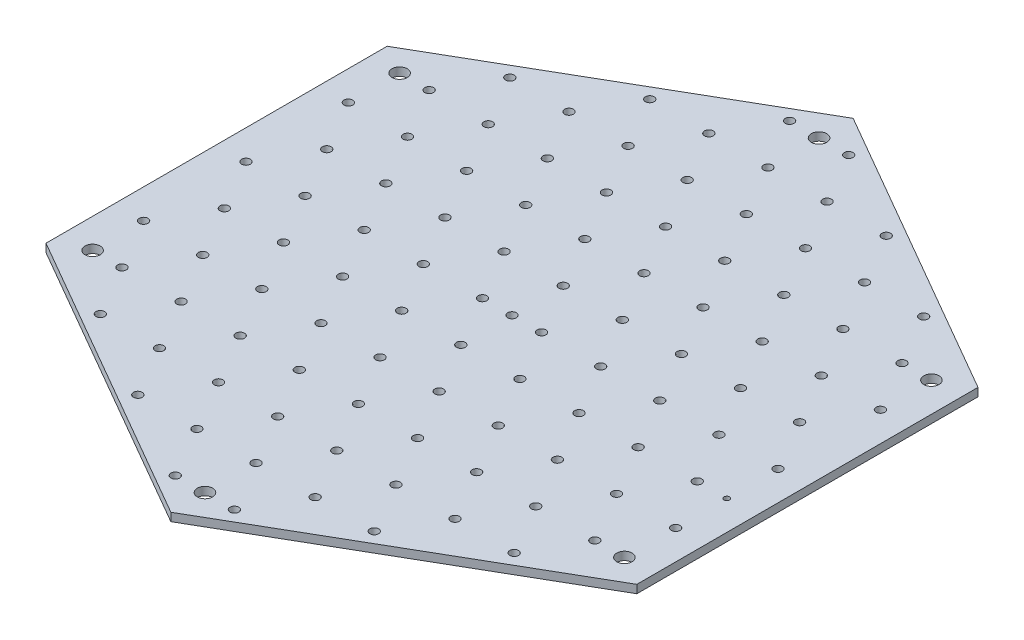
ISO-10303-21;
HEADER;
FILE_DESCRIPTION(('STEP AP214'),'2;1');
FILE_NAME('part.step','',(''),(''),'','','');
FILE_SCHEMA(('AUTOMOTIVE_DESIGN { 1 0 10303 214 1 1 1 1 }'));
ENDSEC;
DATA;
#1=APPLICATION_CONTEXT('core data for automotive mechanical design processes');
#2=APPLICATION_PROTOCOL_DEFINITION('international standard','automotive_design',2000,#1);
#3=PRODUCT_CONTEXT('',#1,'mechanical');
#4=PRODUCT('Part','Part','',(#3));
#5=PRODUCT_RELATED_PRODUCT_CATEGORY('part','',(#4));
#6=PRODUCT_DEFINITION_FORMATION('','',#4);
#7=PRODUCT_DEFINITION_CONTEXT('part definition',#1,'design');
#8=PRODUCT_DEFINITION('design','',#6,#7);
#9=PRODUCT_DEFINITION_SHAPE('','',#8);
#10=(LENGTH_UNIT() NAMED_UNIT(*) SI_UNIT(.MILLI.,.METRE.));
#11=(NAMED_UNIT(*) PLANE_ANGLE_UNIT() SI_UNIT($,.RADIAN.));
#12=(NAMED_UNIT(*) SI_UNIT($,.STERADIAN.) SOLID_ANGLE_UNIT());
#13=UNCERTAINTY_MEASURE_WITH_UNIT(LENGTH_MEASURE(1.E-05),#10,'distance_accuracy_value','');
#14=(GEOMETRIC_REPRESENTATION_CONTEXT(3) GLOBAL_UNCERTAINTY_ASSIGNED_CONTEXT((#13)) GLOBAL_UNIT_ASSIGNED_CONTEXT((#10,
#11,#12)) REPRESENTATION_CONTEXT('',''));
#15=CARTESIAN_POINT('',(0.,0.,0.));
#16=DIRECTION('',(0.,0.,1.));
#17=DIRECTION('',(1.,0.,0.));
#18=AXIS2_PLACEMENT_3D('',#15,#16,#17);
#19=CARTESIAN_POINT('',(54.1265877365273,1.5,-31.25));
#20=DIRECTION('',(-0.5,0.,0.866025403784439));
#21=DIRECTION('',(0.866025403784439,0.,0.5));
#22=AXIS2_PLACEMENT_3D('',#19,#20,#21);
#23=PLANE('',#22);
#24=DIRECTION('',(-0.866025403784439,0.,-0.5));
#25=VECTOR('',#24,1.);
#26=CARTESIAN_POINT('',(54.1265877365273,0.,-31.25));
#27=LINE('',#26,#25);
#28=CARTESIAN_POINT('',(54.1265877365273,0.,-31.25));
#29=VERTEX_POINT('',#28);
#30=CARTESIAN_POINT('',(0.,0.,-62.5));
#31=VERTEX_POINT('',#30);
#32=EDGE_CURVE('E117',#29,#31,#27,.T.);
#33=ORIENTED_EDGE('',*,*,#32,.T.);
#34=DIRECTION('',(0.,-1.,0.));
#35=VECTOR('',#34,1.);
#36=CARTESIAN_POINT('',(0.,1.5,-62.5));
#37=LINE('',#36,#35);
#38=CARTESIAN_POINT('',(0.,1.5,-62.5));
#39=VERTEX_POINT('',#38);
#40=EDGE_CURVE('E11',#39,#31,#37,.T.);
#41=ORIENTED_EDGE('',*,*,#40,.F.);
#42=DIRECTION('',(-0.866025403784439,0.,-0.5));
#43=VECTOR('',#42,1.);
#44=CARTESIAN_POINT('',(54.1265877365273,1.5,-31.25));
#45=LINE('',#44,#43);
#46=CARTESIAN_POINT('',(54.1265877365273,1.5,-31.25));
#47=VERTEX_POINT('',#46);
#48=EDGE_CURVE('E128',#47,#39,#45,.T.);
#49=ORIENTED_EDGE('',*,*,#48,.F.);
#50=DIRECTION('',(0.,-1.,0.));
#51=VECTOR('',#50,1.);
#52=CARTESIAN_POINT('',(54.1265877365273,1.5,-31.25));
#53=LINE('',#52,#51);
#54=EDGE_CURVE('E113',#47,#29,#53,.T.);
#55=ORIENTED_EDGE('',*,*,#54,.T.);
#56=EDGE_LOOP('',(#33,#41,#49,#55));
#57=FACE_BOUND('',#56,.T.);
#58=ADVANCED_FACE('F33',(#57),#23,.F.);
#59=CARTESIAN_POINT('',(0.,1.5,-62.5));
#60=DIRECTION('',(0.5,0.,0.866025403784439));
#61=DIRECTION('',(0.866025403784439,0.,-0.5));
#62=AXIS2_PLACEMENT_3D('',#59,#60,#61);
#63=PLANE('',#62);
#64=DIRECTION('',(-0.866025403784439,0.,0.5));
#65=VECTOR('',#64,1.);
#66=CARTESIAN_POINT('',(0.,0.,-62.5));
#67=LINE('',#66,#65);
#68=CARTESIAN_POINT('',(-54.1265877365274,0.,-31.25));
#69=VERTEX_POINT('',#68);
#70=EDGE_CURVE('E120',#31,#69,#67,.T.);
#71=ORIENTED_EDGE('',*,*,#70,.T.);
#72=DIRECTION('',(0.,-1.,0.));
#73=VECTOR('',#72,1.);
#74=CARTESIAN_POINT('',(-54.1265877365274,1.5,-31.25));
#75=LINE('',#74,#73);
#76=CARTESIAN_POINT('',(-54.1265877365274,1.5,-31.25));
#77=VERTEX_POINT('',#76);
#78=EDGE_CURVE('E41',#77,#69,#75,.T.);
#79=ORIENTED_EDGE('',*,*,#78,.F.);
#80=DIRECTION('',(-0.866025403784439,0.,0.5));
#81=VECTOR('',#80,1.);
#82=CARTESIAN_POINT('',(0.,1.5,-62.5));
#83=LINE('',#82,#81);
#84=EDGE_CURVE('E86',#39,#77,#83,.T.);
#85=ORIENTED_EDGE('',*,*,#84,.F.);
#86=ORIENTED_EDGE('',*,*,#40,.T.);
#87=EDGE_LOOP('',(#71,#79,#85,#86));
#88=FACE_BOUND('',#87,.T.);
#89=ADVANCED_FACE('F153',(#88),#63,.F.);
#90=CARTESIAN_POINT('',(-54.1265877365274,1.5,-31.25));
#91=DIRECTION('',(1.,0.,0.));
#92=DIRECTION('',(0.,0.,-1.));
#93=AXIS2_PLACEMENT_3D('',#90,#91,#92);
#94=PLANE('',#93);
#95=DIRECTION('',(0.,0.,1.));
#96=VECTOR('',#95,1.);
#97=CARTESIAN_POINT('',(-54.1265877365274,0.,-31.25));
#98=LINE('',#97,#96);
#99=CARTESIAN_POINT('',(-54.1265877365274,0.,31.25));
#100=VERTEX_POINT('',#99);
#101=EDGE_CURVE('E123',#69,#100,#98,.T.);
#102=ORIENTED_EDGE('',*,*,#101,.T.);
#103=DIRECTION('',(0.,-1.,0.));
#104=VECTOR('',#103,1.);
#105=CARTESIAN_POINT('',(-54.1265877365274,1.5,31.25));
#106=LINE('',#105,#104);
#107=CARTESIAN_POINT('',(-54.1265877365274,1.5,31.25));
#108=VERTEX_POINT('',#107);
#109=EDGE_CURVE('E108',#108,#100,#106,.T.);
#110=ORIENTED_EDGE('',*,*,#109,.F.);
#111=DIRECTION('',(0.,0.,1.));
#112=VECTOR('',#111,1.);
#113=CARTESIAN_POINT('',(-54.1265877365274,1.5,-31.25));
#114=LINE('',#113,#112);
#115=EDGE_CURVE('E99',#77,#108,#114,.T.);
#116=ORIENTED_EDGE('',*,*,#115,.F.);
#117=ORIENTED_EDGE('',*,*,#78,.T.);
#118=EDGE_LOOP('',(#102,#110,#116,#117));
#119=FACE_BOUND('',#118,.T.);
#120=ADVANCED_FACE('F134',(#119),#94,.F.);
#121=CARTESIAN_POINT('',(-54.1265877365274,1.5,31.25));
#122=DIRECTION('',(0.5,0.,-0.866025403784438));
#123=DIRECTION('',(-0.866025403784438,0.,-0.5));
#124=AXIS2_PLACEMENT_3D('',#121,#122,#123);
#125=PLANE('',#124);
#126=DIRECTION('',(0.866025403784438,0.,0.5));
#127=VECTOR('',#126,1.);
#128=CARTESIAN_POINT('',(-54.1265877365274,0.,31.25));
#129=LINE('',#128,#127);
#130=CARTESIAN_POINT('',(0.,0.,62.5));
#131=VERTEX_POINT('',#130);
#132=EDGE_CURVE('E107',#100,#131,#129,.T.);
#133=ORIENTED_EDGE('',*,*,#132,.T.);
#134=DIRECTION('',(0.,-1.,0.));
#135=VECTOR('',#134,1.);
#136=CARTESIAN_POINT('',(0.,1.5,62.5));
#137=LINE('',#136,#135);
#138=CARTESIAN_POINT('',(0.,1.5,62.5));
#139=VERTEX_POINT('',#138);
#140=EDGE_CURVE('E104',#139,#131,#137,.T.);
#141=ORIENTED_EDGE('',*,*,#140,.F.);
#142=DIRECTION('',(0.866025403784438,0.,0.5));
#143=VECTOR('',#142,1.);
#144=CARTESIAN_POINT('',(-54.1265877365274,1.5,31.25));
#145=LINE('',#144,#143);
#146=EDGE_CURVE('E93',#108,#139,#145,.T.);
#147=ORIENTED_EDGE('',*,*,#146,.F.);
#148=ORIENTED_EDGE('',*,*,#109,.T.);
#149=EDGE_LOOP('',(#133,#141,#147,#148));
#150=FACE_BOUND('',#149,.T.);
#151=ADVANCED_FACE('F105',(#150),#125,.F.);
#152=CARTESIAN_POINT('',(0.,1.5,62.5));
#153=DIRECTION('',(-0.5,0.,-0.866025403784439));
#154=DIRECTION('',(-0.866025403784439,0.,0.5));
#155=AXIS2_PLACEMENT_3D('',#152,#153,#154);
#156=PLANE('',#155);
#157=DIRECTION('',(0.866025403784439,0.,-0.5));
#158=VECTOR('',#157,1.);
#159=CARTESIAN_POINT('',(0.,0.,62.5));
#160=LINE('',#159,#158);
#161=CARTESIAN_POINT('',(54.1265877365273,0.,31.25));
#162=VERTEX_POINT('',#161);
#163=EDGE_CURVE('E72',#131,#162,#160,.T.);
#164=ORIENTED_EDGE('',*,*,#163,.T.);
#165=DIRECTION('',(0.,-1.,0.));
#166=VECTOR('',#165,1.);
#167=CARTESIAN_POINT('',(54.1265877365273,1.5,31.25));
#168=LINE('',#167,#166);
#169=CARTESIAN_POINT('',(54.1265877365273,1.5,31.25));
#170=VERTEX_POINT('',#169);
#171=EDGE_CURVE('E109',#170,#162,#168,.T.);
#172=ORIENTED_EDGE('',*,*,#171,.F.);
#173=DIRECTION('',(0.866025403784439,0.,-0.5));
#174=VECTOR('',#173,1.);
#175=CARTESIAN_POINT('',(0.,1.5,62.5));
#176=LINE('',#175,#174);
#177=EDGE_CURVE('E97',#139,#170,#176,.T.);
#178=ORIENTED_EDGE('',*,*,#177,.F.);
#179=ORIENTED_EDGE('',*,*,#140,.T.);
#180=EDGE_LOOP('',(#164,#172,#178,#179));
#181=FACE_BOUND('',#180,.T.);
#182=ADVANCED_FACE('F111',(#181),#156,.F.);
#183=CARTESIAN_POINT('',(54.1265877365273,1.5,31.25));
#184=DIRECTION('',(-1.,0.,0.));
#185=DIRECTION('',(0.,0.,1.));
#186=AXIS2_PLACEMENT_3D('',#183,#184,#185);
#187=PLANE('',#186);
#188=DIRECTION('',(0.,0.,-1.));
#189=VECTOR('',#188,1.);
#190=CARTESIAN_POINT('',(54.1265877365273,0.,31.25));
#191=LINE('',#190,#189);
#192=EDGE_CURVE('E78',#162,#29,#191,.T.);
#193=ORIENTED_EDGE('',*,*,#192,.T.);
#194=ORIENTED_EDGE('',*,*,#54,.F.);
#195=DIRECTION('',(0.,0.,-1.));
#196=VECTOR('',#195,1.);
#197=CARTESIAN_POINT('',(54.1265877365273,1.5,31.25));
#198=LINE('',#197,#196);
#199=EDGE_CURVE('E49',#170,#47,#198,.T.);
#200=ORIENTED_EDGE('',*,*,#199,.F.);
#201=ORIENTED_EDGE('',*,*,#171,.T.);
#202=EDGE_LOOP('',(#193,#194,#200,#201));
#203=FACE_BOUND('',#202,.T.);
#204=ADVANCED_FACE('F141',(#203),#187,.F.);
#205=CARTESIAN_POINT('',(0.,1.5,0.));
#206=DIRECTION('',(0.,1.,0.));
#207=DIRECTION('',(0.,0.,1.));
#208=AXIS2_PLACEMENT_3D('',#205,#206,#207);
#209=PLANE('',#208);
#210=CARTESIAN_POINT('',(48.735,1.5,9.37905512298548));
#211=DIRECTION('',(0.,1.,0.));
#212=DIRECTION('',(0.,0.,1.));
#213=AXIS2_PLACEMENT_3D('',#210,#211,#212);
#214=CIRCLE('',#213,0.499999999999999);
#215=CARTESIAN_POINT('',(48.735,1.5,9.87905512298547));
#216=VERTEX_POINT('',#215);
#217=EDGE_CURVE('E1239',#216,#216,#214,.T.);
#218=ORIENTED_EDGE('',*,*,#217,.F.);
#219=EDGE_LOOP('',(#218));
#220=FACE_BOUND('',#219,.T.);
#221=CARTESIAN_POINT('',(-48.735,1.5,-18.7581102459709));
#222=DIRECTION('',(0.,-1.,0.));
#223=DIRECTION('',(0.,0.,-1.));
#224=AXIS2_PLACEMENT_3D('',#221,#222,#223);
#225=CIRCLE('',#224,0.800000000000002);
#226=CARTESIAN_POINT('',(-48.735,1.5,-19.5581102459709));
#227=VERTEX_POINT('',#226);
#228=EDGE_CURVE('E1246',#227,#227,#225,.T.);
#229=ORIENTED_EDGE('',*,*,#228,.T.);
#230=EDGE_LOOP('',(#229));
#231=FACE_BOUND('',#230,.T.);
#232=CARTESIAN_POINT('',(-43.32,1.5,-28.1371653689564));
#233=DIRECTION('',(0.,-1.,0.));
#234=DIRECTION('',(0.,0.,-1.));
#235=AXIS2_PLACEMENT_3D('',#232,#233,#234);
#236=CIRCLE('',#235,0.799999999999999);
#237=CARTESIAN_POINT('',(-43.32,1.5,-28.9371653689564));
#238=VERTEX_POINT('',#237);
#239=EDGE_CURVE('E1252',#238,#238,#236,.T.);
#240=ORIENTED_EDGE('',*,*,#239,.T.);
#241=EDGE_LOOP('',(#240));
#242=FACE_BOUND('',#241,.T.);
#243=CARTESIAN_POINT('',(-37.905,1.5,-37.5162204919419));
#244=DIRECTION('',(0.,-1.,0.));
#245=DIRECTION('',(0.,0.,-1.));
#246=AXIS2_PLACEMENT_3D('',#243,#244,#245);
#247=CIRCLE('',#246,0.799999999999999);
#248=CARTESIAN_POINT('',(-37.905,1.5,-38.3162204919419));
#249=VERTEX_POINT('',#248);
#250=EDGE_CURVE('E1258',#249,#249,#247,.T.);
#251=ORIENTED_EDGE('',*,*,#250,.T.);
#252=EDGE_LOOP('',(#251));
#253=FACE_BOUND('',#252,.T.);
#254=CARTESIAN_POINT('',(48.735,1.5,18.758110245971));
#255=DIRECTION('',(0.,-1.,0.));
#256=DIRECTION('',(0.,0.,-1.));
#257=AXIS2_PLACEMENT_3D('',#254,#255,#256);
#258=CIRCLE('',#257,0.800000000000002);
#259=CARTESIAN_POINT('',(48.735,1.5,17.9581102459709));
#260=VERTEX_POINT('',#259);
#261=EDGE_CURVE('E1264',#260,#260,#258,.T.);
#262=ORIENTED_EDGE('',*,*,#261,.T.);
#263=EDGE_LOOP('',(#262));
#264=FACE_BOUND('',#263,.T.);
#265=CARTESIAN_POINT('',(43.32,1.5,28.1371653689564));
#266=DIRECTION('',(0.,-1.,0.));
#267=DIRECTION('',(0.,0.,-1.));
#268=AXIS2_PLACEMENT_3D('',#265,#266,#267);
#269=CIRCLE('',#268,0.799999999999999);
#270=CARTESIAN_POINT('',(43.32,1.5,27.3371653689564));
#271=VERTEX_POINT('',#270);
#272=EDGE_CURVE('E1270',#271,#271,#269,.T.);
#273=ORIENTED_EDGE('',*,*,#272,.T.);
#274=EDGE_LOOP('',(#273));
#275=FACE_BOUND('',#274,.T.);
#276=CARTESIAN_POINT('',(37.905,1.5,37.5162204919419));
#277=DIRECTION('',(0.,-1.,0.));
#278=DIRECTION('',(0.,0.,-1.));
#279=AXIS2_PLACEMENT_3D('',#276,#277,#278);
#280=CIRCLE('',#279,0.8);
#281=CARTESIAN_POINT('',(37.905,1.5,36.7162204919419));
#282=VERTEX_POINT('',#281);
#283=EDGE_CURVE('E1276',#282,#282,#280,.T.);
#284=ORIENTED_EDGE('',*,*,#283,.T.);
#285=EDGE_LOOP('',(#284));
#286=FACE_BOUND('',#285,.T.);
#287=CARTESIAN_POINT('',(-27.075,1.5,37.5162204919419));
#288=DIRECTION('',(0.,-1.,0.));
#289=DIRECTION('',(0.,0.,-1.));
#290=AXIS2_PLACEMENT_3D('',#287,#288,#289);
#291=CIRCLE('',#290,0.8);
#292=CARTESIAN_POINT('',(-27.075,1.5,36.7162204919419));
#293=VERTEX_POINT('',#292);
#294=EDGE_CURVE('E1282',#293,#293,#291,.T.);
#295=ORIENTED_EDGE('',*,*,#294,.T.);
#296=EDGE_LOOP('',(#295));
#297=FACE_BOUND('',#296,.T.);
#298=CARTESIAN_POINT('',(-21.66,1.5,28.1371653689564));
#299=DIRECTION('',(0.,-1.,0.));
#300=DIRECTION('',(0.,0.,-1.));
#301=AXIS2_PLACEMENT_3D('',#298,#299,#300);
#302=CIRCLE('',#301,0.8);
#303=CARTESIAN_POINT('',(-21.66,1.5,27.3371653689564));
#304=VERTEX_POINT('',#303);
#305=EDGE_CURVE('E1288',#304,#304,#302,.T.);
#306=ORIENTED_EDGE('',*,*,#305,.T.);
#307=EDGE_LOOP('',(#306));
#308=FACE_BOUND('',#307,.T.);
#309=CARTESIAN_POINT('',(-16.245,1.5,18.7581102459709));
#310=DIRECTION('',(0.,-1.,0.));
#311=DIRECTION('',(0.,0.,-1.));
#312=AXIS2_PLACEMENT_3D('',#309,#310,#311);
#313=CIRCLE('',#312,0.8);
#314=CARTESIAN_POINT('',(-16.245,1.5,17.9581102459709));
#315=VERTEX_POINT('',#314);
#316=EDGE_CURVE('E1294',#315,#315,#313,.T.);
#317=ORIENTED_EDGE('',*,*,#316,.T.);
#318=EDGE_LOOP('',(#317));
#319=FACE_BOUND('',#318,.T.);
#320=CARTESIAN_POINT('',(-10.83,1.5,9.37905512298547));
#321=DIRECTION('',(0.,-1.,0.));
#322=DIRECTION('',(0.,0.,-1.));
#323=AXIS2_PLACEMENT_3D('',#320,#321,#322);
#324=CIRCLE('',#323,0.8);
#325=CARTESIAN_POINT('',(-10.83,1.5,8.57905512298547));
#326=VERTEX_POINT('',#325);
#327=EDGE_CURVE('E1300',#326,#326,#324,.T.);
#328=ORIENTED_EDGE('',*,*,#327,.T.);
#329=EDGE_LOOP('',(#328));
#330=FACE_BOUND('',#329,.T.);
#331=CARTESIAN_POINT('',(21.66,1.5,-46.8952756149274));
#332=DIRECTION('',(0.,-1.,0.));
#333=DIRECTION('',(0.,0.,-1.));
#334=AXIS2_PLACEMENT_3D('',#331,#332,#333);
#335=CIRCLE('',#334,0.8);
#336=CARTESIAN_POINT('',(21.66,1.5,-47.6952756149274));
#337=VERTEX_POINT('',#336);
#338=EDGE_CURVE('E1306',#337,#337,#335,.T.);
#339=ORIENTED_EDGE('',*,*,#338,.T.);
#340=EDGE_LOOP('',(#339));
#341=FACE_BOUND('',#340,.T.);
#342=CARTESIAN_POINT('',(16.245,1.5,-37.5162204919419));
#343=DIRECTION('',(0.,-1.,0.));
#344=DIRECTION('',(0.,0.,-1.));
#345=AXIS2_PLACEMENT_3D('',#342,#343,#344);
#346=CIRCLE('',#345,0.8);
#347=CARTESIAN_POINT('',(16.245,1.5,-38.3162204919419));
#348=VERTEX_POINT('',#347);
#349=EDGE_CURVE('E1312',#348,#348,#346,.T.);
#350=ORIENTED_EDGE('',*,*,#349,.T.);
#351=EDGE_LOOP('',(#350));
#352=FACE_BOUND('',#351,.T.);
#353=CARTESIAN_POINT('',(10.83,1.5,-28.1371653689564));
#354=DIRECTION('',(0.,-1.,0.));
#355=DIRECTION('',(0.,0.,-1.));
#356=AXIS2_PLACEMENT_3D('',#353,#354,#355);
#357=CIRCLE('',#356,0.8);
#358=CARTESIAN_POINT('',(10.83,1.5,-28.9371653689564));
#359=VERTEX_POINT('',#358);
#360=EDGE_CURVE('E1318',#359,#359,#357,.T.);
#361=ORIENTED_EDGE('',*,*,#360,.T.);
#362=EDGE_LOOP('',(#361));
#363=FACE_BOUND('',#362,.T.);
#364=CARTESIAN_POINT('',(5.41499999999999,1.5,-18.7581102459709));
#365=DIRECTION('',(0.,-1.,0.));
#366=DIRECTION('',(0.,0.,-1.));
#367=AXIS2_PLACEMENT_3D('',#364,#365,#366);
#368=CIRCLE('',#367,0.8);
#369=CARTESIAN_POINT('',(5.41499999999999,1.5,-19.5581102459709));
#370=VERTEX_POINT('',#369);
#371=EDGE_CURVE('E1324',#370,#370,#368,.T.);
#372=ORIENTED_EDGE('',*,*,#371,.T.);
#373=EDGE_LOOP('',(#372));
#374=FACE_BOUND('',#373,.T.);
#375=CARTESIAN_POINT('',(0.,1.5,-9.37905512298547));
#376=DIRECTION('',(0.,-1.,0.));
#377=DIRECTION('',(0.,0.,-1.));
#378=AXIS2_PLACEMENT_3D('',#375,#376,#377);
#379=CIRCLE('',#378,0.8);
#380=CARTESIAN_POINT('',(0.,1.5,-10.1790551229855));
#381=VERTEX_POINT('',#380);
#382=EDGE_CURVE('E1330',#381,#381,#379,.T.);
#383=ORIENTED_EDGE('',*,*,#382,.T.);
#384=EDGE_LOOP('',(#383));
#385=FACE_BOUND('',#384,.T.);
#386=CARTESIAN_POINT('',(-37.905,1.5,37.5162204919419));
#387=DIRECTION('',(0.,-1.,0.));
#388=DIRECTION('',(0.,0.,-1.));
#389=AXIS2_PLACEMENT_3D('',#386,#387,#388);
#390=CIRCLE('',#389,0.799999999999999);
#391=CARTESIAN_POINT('',(-37.905,1.5,36.7162204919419));
#392=VERTEX_POINT('',#391);
#393=EDGE_CURVE('E1336',#392,#392,#390,.T.);
#394=ORIENTED_EDGE('',*,*,#393,.T.);
#395=EDGE_LOOP('',(#394));
#396=FACE_BOUND('',#395,.T.);
#397=CARTESIAN_POINT('',(-32.49,1.5,28.1371653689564));
#398=DIRECTION('',(0.,-1.,0.));
#399=DIRECTION('',(0.,0.,-1.));
#400=AXIS2_PLACEMENT_3D('',#397,#398,#399);
#401=CIRCLE('',#400,0.799999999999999);
#402=CARTESIAN_POINT('',(-32.49,1.5,27.3371653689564));
#403=VERTEX_POINT('',#402);
#404=EDGE_CURVE('E1342',#403,#403,#401,.T.);
#405=ORIENTED_EDGE('',*,*,#404,.T.);
#406=EDGE_LOOP('',(#405));
#407=FACE_BOUND('',#406,.T.);
#408=CARTESIAN_POINT('',(-27.075,1.5,18.7581102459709));
#409=DIRECTION('',(0.,-1.,0.));
#410=DIRECTION('',(0.,0.,-1.));
#411=AXIS2_PLACEMENT_3D('',#408,#409,#410);
#412=CIRCLE('',#411,0.799999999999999);
#413=CARTESIAN_POINT('',(-27.075,1.5,17.9581102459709));
#414=VERTEX_POINT('',#413);
#415=EDGE_CURVE('E1348',#414,#414,#412,.T.);
#416=ORIENTED_EDGE('',*,*,#415,.T.);
#417=EDGE_LOOP('',(#416));
#418=FACE_BOUND('',#417,.T.);
#419=CARTESIAN_POINT('',(-21.66,1.5,9.37905512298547));
#420=DIRECTION('',(0.,-1.,0.));
#421=DIRECTION('',(0.,0.,-1.));
#422=AXIS2_PLACEMENT_3D('',#419,#420,#421);
#423=CIRCLE('',#422,0.799999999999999);
#424=CARTESIAN_POINT('',(-21.66,1.5,8.57905512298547));
#425=VERTEX_POINT('',#424);
#426=EDGE_CURVE('E1354',#425,#425,#423,.T.);
#427=ORIENTED_EDGE('',*,*,#426,.T.);
#428=EDGE_LOOP('',(#427));
#429=FACE_BOUND('',#428,.T.);
#430=CARTESIAN_POINT('',(10.83,1.5,-46.8952756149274));
#431=DIRECTION('',(0.,-1.,0.));
#432=DIRECTION('',(0.,0.,-1.));
#433=AXIS2_PLACEMENT_3D('',#430,#431,#432);
#434=CIRCLE('',#433,0.799999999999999);
#435=CARTESIAN_POINT('',(10.83,1.5,-47.6952756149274));
#436=VERTEX_POINT('',#435);
#437=EDGE_CURVE('E1360',#436,#436,#434,.T.);
#438=ORIENTED_EDGE('',*,*,#437,.T.);
#439=EDGE_LOOP('',(#438));
#440=FACE_BOUND('',#439,.T.);
#441=CARTESIAN_POINT('',(5.41499999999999,1.5,-37.5162204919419));
#442=DIRECTION('',(0.,-1.,0.));
#443=DIRECTION('',(0.,0.,-1.));
#444=AXIS2_PLACEMENT_3D('',#441,#442,#443);
#445=CIRCLE('',#444,0.799999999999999);
#446=CARTESIAN_POINT('',(5.41499999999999,1.5,-38.3162204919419));
#447=VERTEX_POINT('',#446);
#448=EDGE_CURVE('E1366',#447,#447,#445,.T.);
#449=ORIENTED_EDGE('',*,*,#448,.T.);
#450=EDGE_LOOP('',(#449));
#451=FACE_BOUND('',#450,.T.);
#452=CARTESIAN_POINT('',(0.,1.5,-28.1371653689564));
#453=DIRECTION('',(0.,-1.,0.));
#454=DIRECTION('',(0.,0.,-1.));
#455=AXIS2_PLACEMENT_3D('',#452,#453,#454);
#456=CIRCLE('',#455,0.799999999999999);
#457=CARTESIAN_POINT('',(0.,1.5,-28.9371653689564));
#458=VERTEX_POINT('',#457);
#459=EDGE_CURVE('E1372',#458,#458,#456,.T.);
#460=ORIENTED_EDGE('',*,*,#459,.T.);
#461=EDGE_LOOP('',(#460));
#462=FACE_BOUND('',#461,.T.);
#463=CARTESIAN_POINT('',(-5.41500000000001,1.5,-18.7581102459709));
#464=DIRECTION('',(0.,-1.,0.));
#465=DIRECTION('',(0.,0.,-1.));
#466=AXIS2_PLACEMENT_3D('',#463,#464,#465);
#467=CIRCLE('',#466,0.799999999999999);
#468=CARTESIAN_POINT('',(-5.41500000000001,1.5,-19.5581102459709));
#469=VERTEX_POINT('',#468);
#470=EDGE_CURVE('E1378',#469,#469,#467,.T.);
#471=ORIENTED_EDGE('',*,*,#470,.T.);
#472=EDGE_LOOP('',(#471));
#473=FACE_BOUND('',#472,.T.);
#474=CARTESIAN_POINT('',(-10.83,1.5,-9.37905512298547));
#475=DIRECTION('',(0.,-1.,0.));
#476=DIRECTION('',(0.,0.,-1.));
#477=AXIS2_PLACEMENT_3D('',#474,#475,#476);
#478=CIRCLE('',#477,0.799999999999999);
#479=CARTESIAN_POINT('',(-10.83,1.5,-10.1790551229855));
#480=VERTEX_POINT('',#479);
#481=EDGE_CURVE('E1384',#480,#480,#478,.T.);
#482=ORIENTED_EDGE('',*,*,#481,.T.);
#483=EDGE_LOOP('',(#482));
#484=FACE_BOUND('',#483,.T.);
#485=CARTESIAN_POINT('',(5.41499999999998,1.5,-56.2743307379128));
#486=DIRECTION('',(0.,-1.,0.));
#487=DIRECTION('',(0.,0.,-1.));
#488=AXIS2_PLACEMENT_3D('',#485,#486,#487);
#489=CIRCLE('',#488,0.799999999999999);
#490=CARTESIAN_POINT('',(5.41499999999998,1.5,-57.0743307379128));
#491=VERTEX_POINT('',#490);
#492=EDGE_CURVE('E1390',#491,#491,#489,.T.);
#493=ORIENTED_EDGE('',*,*,#492,.T.);
#494=EDGE_LOOP('',(#493));
#495=FACE_BOUND('',#494,.T.);
#496=CARTESIAN_POINT('',(0.,1.5,-46.8952756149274));
#497=DIRECTION('',(0.,-1.,0.));
#498=DIRECTION('',(0.,0.,-1.));
#499=AXIS2_PLACEMENT_3D('',#496,#497,#498);
#500=CIRCLE('',#499,0.799999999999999);
#501=CARTESIAN_POINT('',(0.,1.5,-47.6952756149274));
#502=VERTEX_POINT('',#501);
#503=EDGE_CURVE('E1396',#502,#502,#500,.T.);
#504=ORIENTED_EDGE('',*,*,#503,.T.);
#505=EDGE_LOOP('',(#504));
#506=FACE_BOUND('',#505,.T.);
#507=CARTESIAN_POINT('',(-5.41500000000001,1.5,-37.5162204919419));
#508=DIRECTION('',(0.,-1.,0.));
#509=DIRECTION('',(0.,0.,-1.));
#510=AXIS2_PLACEMENT_3D('',#507,#508,#509);
#511=CIRCLE('',#510,0.799999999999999);
#512=CARTESIAN_POINT('',(-5.41500000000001,1.5,-38.3162204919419));
#513=VERTEX_POINT('',#512);
#514=EDGE_CURVE('E1402',#513,#513,#511,.T.);
#515=ORIENTED_EDGE('',*,*,#514,.T.);
#516=EDGE_LOOP('',(#515));
#517=FACE_BOUND('',#516,.T.);
#518=CARTESIAN_POINT('',(-10.83,1.5,-28.1371653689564));
#519=DIRECTION('',(0.,-1.,0.));
#520=DIRECTION('',(0.,0.,-1.));
#521=AXIS2_PLACEMENT_3D('',#518,#519,#520);
#522=CIRCLE('',#521,0.799999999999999);
#523=CARTESIAN_POINT('',(-10.83,1.5,-28.9371653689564));
#524=VERTEX_POINT('',#523);
#525=EDGE_CURVE('E1408',#524,#524,#522,.T.);
#526=ORIENTED_EDGE('',*,*,#525,.T.);
#527=EDGE_LOOP('',(#526));
#528=FACE_BOUND('',#527,.T.);
#529=CARTESIAN_POINT('',(-16.245,1.5,-18.7581102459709));
#530=DIRECTION('',(0.,-1.,0.));
#531=DIRECTION('',(0.,0.,-1.));
#532=AXIS2_PLACEMENT_3D('',#529,#530,#531);
#533=CIRCLE('',#532,0.799999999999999);
#534=CARTESIAN_POINT('',(-16.245,1.5,-19.5581102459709));
#535=VERTEX_POINT('',#534);
#536=EDGE_CURVE('E1414',#535,#535,#533,.T.);
#537=ORIENTED_EDGE('',*,*,#536,.T.);
#538=EDGE_LOOP('',(#537));
#539=FACE_BOUND('',#538,.T.);
#540=CARTESIAN_POINT('',(-21.66,1.5,-9.37905512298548));
#541=DIRECTION('',(0.,-1.,0.));
#542=DIRECTION('',(0.,0.,-1.));
#543=AXIS2_PLACEMENT_3D('',#540,#541,#542);
#544=CIRCLE('',#543,0.799999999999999);
#545=CARTESIAN_POINT('',(-21.66,1.5,-10.1790551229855));
#546=VERTEX_POINT('',#545);
#547=EDGE_CURVE('E1420',#546,#546,#544,.T.);
#548=ORIENTED_EDGE('',*,*,#547,.T.);
#549=EDGE_LOOP('',(#548));
#550=FACE_BOUND('',#549,.T.);
#551=CARTESIAN_POINT('',(-43.32,1.5,28.1371653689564));
#552=DIRECTION('',(0.,-1.,0.));
#553=DIRECTION('',(0.,0.,-1.));
#554=AXIS2_PLACEMENT_3D('',#551,#552,#553);
#555=CIRCLE('',#554,0.799999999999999);
#556=CARTESIAN_POINT('',(-43.32,1.5,27.3371653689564));
#557=VERTEX_POINT('',#556);
#558=EDGE_CURVE('E1426',#557,#557,#555,.T.);
#559=ORIENTED_EDGE('',*,*,#558,.T.);
#560=EDGE_LOOP('',(#559));
#561=FACE_BOUND('',#560,.T.);
#562=CARTESIAN_POINT('',(-37.905,1.5,18.7581102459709));
#563=DIRECTION('',(0.,-1.,0.));
#564=DIRECTION('',(0.,0.,-1.));
#565=AXIS2_PLACEMENT_3D('',#562,#563,#564);
#566=CIRCLE('',#565,0.799999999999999);
#567=CARTESIAN_POINT('',(-37.905,1.5,17.9581102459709));
#568=VERTEX_POINT('',#567);
#569=EDGE_CURVE('E1432',#568,#568,#566,.T.);
#570=ORIENTED_EDGE('',*,*,#569,.T.);
#571=EDGE_LOOP('',(#570));
#572=FACE_BOUND('',#571,.T.);
#573=CARTESIAN_POINT('',(-32.49,1.5,9.37905512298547));
#574=DIRECTION('',(0.,-1.,0.));
#575=DIRECTION('',(0.,0.,-1.));
#576=AXIS2_PLACEMENT_3D('',#573,#574,#575);
#577=CIRCLE('',#576,0.799999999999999);
#578=CARTESIAN_POINT('',(-32.49,1.5,8.57905512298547));
#579=VERTEX_POINT('',#578);
#580=EDGE_CURVE('E1438',#579,#579,#577,.T.);
#581=ORIENTED_EDGE('',*,*,#580,.T.);
#582=EDGE_LOOP('',(#581));
#583=FACE_BOUND('',#582,.T.);
#584=CARTESIAN_POINT('',(-5.41500000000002,1.5,-56.2743307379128));
#585=DIRECTION('',(0.,-1.,0.));
#586=DIRECTION('',(0.,0.,-1.));
#587=AXIS2_PLACEMENT_3D('',#584,#585,#586);
#588=CIRCLE('',#587,0.800000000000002);
#589=CARTESIAN_POINT('',(-5.41500000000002,1.5,-57.0743307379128));
#590=VERTEX_POINT('',#589);
#591=EDGE_CURVE('E1444',#590,#590,#588,.T.);
#592=ORIENTED_EDGE('',*,*,#591,.T.);
#593=EDGE_LOOP('',(#592));
#594=FACE_BOUND('',#593,.T.);
#595=CARTESIAN_POINT('',(-10.83,1.5,-46.8952756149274));
#596=DIRECTION('',(0.,-1.,0.));
#597=DIRECTION('',(0.,0.,-1.));
#598=AXIS2_PLACEMENT_3D('',#595,#596,#597);
#599=CIRCLE('',#598,0.800000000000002);
#600=CARTESIAN_POINT('',(-10.83,1.5,-47.6952756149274));
#601=VERTEX_POINT('',#600);
#602=EDGE_CURVE('E1450',#601,#601,#599,.T.);
#603=ORIENTED_EDGE('',*,*,#602,.T.);
#604=EDGE_LOOP('',(#603));
#605=FACE_BOUND('',#604,.T.);
#606=CARTESIAN_POINT('',(-16.245,1.5,-37.5162204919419));
#607=DIRECTION('',(0.,-1.,0.));
#608=DIRECTION('',(0.,0.,-1.));
#609=AXIS2_PLACEMENT_3D('',#606,#607,#608);
#610=CIRCLE('',#609,0.800000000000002);
#611=CARTESIAN_POINT('',(-16.245,1.5,-38.3162204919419));
#612=VERTEX_POINT('',#611);
#613=EDGE_CURVE('E1456',#612,#612,#610,.T.);
#614=ORIENTED_EDGE('',*,*,#613,.T.);
#615=EDGE_LOOP('',(#614));
#616=FACE_BOUND('',#615,.T.);
#617=CARTESIAN_POINT('',(-21.66,1.5,-28.1371653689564));
#618=DIRECTION('',(0.,-1.,0.));
#619=DIRECTION('',(0.,0.,-1.));
#620=AXIS2_PLACEMENT_3D('',#617,#618,#619);
#621=CIRCLE('',#620,0.800000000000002);
#622=CARTESIAN_POINT('',(-21.66,1.5,-28.9371653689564));
#623=VERTEX_POINT('',#622);
#624=EDGE_CURVE('E1462',#623,#623,#621,.T.);
#625=ORIENTED_EDGE('',*,*,#624,.T.);
#626=EDGE_LOOP('',(#625));
#627=FACE_BOUND('',#626,.T.);
#628=CARTESIAN_POINT('',(-27.075,1.5,-18.758110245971));
#629=DIRECTION('',(0.,-1.,0.));
#630=DIRECTION('',(0.,0.,-1.));
#631=AXIS2_PLACEMENT_3D('',#628,#629,#630);
#632=CIRCLE('',#631,0.800000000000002);
#633=CARTESIAN_POINT('',(-27.075,1.5,-19.558110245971));
#634=VERTEX_POINT('',#633);
#635=EDGE_CURVE('E1468',#634,#634,#632,.T.);
#636=ORIENTED_EDGE('',*,*,#635,.T.);
#637=EDGE_LOOP('',(#636));
#638=FACE_BOUND('',#637,.T.);
#639=CARTESIAN_POINT('',(-32.49,1.5,-9.37905512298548));
#640=DIRECTION('',(0.,-1.,0.));
#641=DIRECTION('',(0.,0.,-1.));
#642=AXIS2_PLACEMENT_3D('',#639,#640,#641);
#643=CIRCLE('',#642,0.800000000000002);
#644=CARTESIAN_POINT('',(-32.49,1.5,-10.1790551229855));
#645=VERTEX_POINT('',#644);
#646=EDGE_CURVE('E1474',#645,#645,#643,.T.);
#647=ORIENTED_EDGE('',*,*,#646,.T.);
#648=EDGE_LOOP('',(#647));
#649=FACE_BOUND('',#648,.T.);
#650=CARTESIAN_POINT('',(-48.735,1.5,18.7581102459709));
#651=DIRECTION('',(0.,-1.,0.));
#652=DIRECTION('',(0.,0.,-1.));
#653=AXIS2_PLACEMENT_3D('',#650,#651,#652);
#654=CIRCLE('',#653,0.800000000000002);
#655=CARTESIAN_POINT('',(-48.735,1.5,17.9581102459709));
#656=VERTEX_POINT('',#655);
#657=EDGE_CURVE('E1480',#656,#656,#654,.T.);
#658=ORIENTED_EDGE('',*,*,#657,.T.);
#659=EDGE_LOOP('',(#658));
#660=FACE_BOUND('',#659,.T.);
#661=CARTESIAN_POINT('',(-43.32,1.5,9.37905512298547));
#662=DIRECTION('',(0.,-1.,0.));
#663=DIRECTION('',(0.,0.,-1.));
#664=AXIS2_PLACEMENT_3D('',#661,#662,#663);
#665=CIRCLE('',#664,0.800000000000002);
#666=CARTESIAN_POINT('',(-43.32,1.5,8.57905512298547));
#667=VERTEX_POINT('',#666);
#668=EDGE_CURVE('E1486',#667,#667,#665,.T.);
#669=ORIENTED_EDGE('',*,*,#668,.T.);
#670=EDGE_LOOP('',(#669));
#671=FACE_BOUND('',#670,.T.);
#672=CARTESIAN_POINT('',(-21.66,1.5,-46.8952756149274));
#673=DIRECTION('',(0.,-1.,0.));
#674=DIRECTION('',(0.,0.,-1.));
#675=AXIS2_PLACEMENT_3D('',#672,#673,#674);
#676=CIRCLE('',#675,0.800000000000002);
#677=CARTESIAN_POINT('',(-21.66,1.5,-47.6952756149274));
#678=VERTEX_POINT('',#677);
#679=EDGE_CURVE('E1492',#678,#678,#676,.T.);
#680=ORIENTED_EDGE('',*,*,#679,.T.);
#681=EDGE_LOOP('',(#680));
#682=FACE_BOUND('',#681,.T.);
#683=CARTESIAN_POINT('',(-27.075,1.5,-37.5162204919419));
#684=DIRECTION('',(0.,-1.,0.));
#685=DIRECTION('',(0.,0.,-1.));
#686=AXIS2_PLACEMENT_3D('',#683,#684,#685);
#687=CIRCLE('',#686,0.800000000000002);
#688=CARTESIAN_POINT('',(-27.075,1.5,-38.3162204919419));
#689=VERTEX_POINT('',#688);
#690=EDGE_CURVE('E1498',#689,#689,#687,.T.);
#691=ORIENTED_EDGE('',*,*,#690,.T.);
#692=EDGE_LOOP('',(#691));
#693=FACE_BOUND('',#692,.T.);
#694=CARTESIAN_POINT('',(-32.49,1.5,-28.1371653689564));
#695=DIRECTION('',(0.,-1.,0.));
#696=DIRECTION('',(0.,0.,-1.));
#697=AXIS2_PLACEMENT_3D('',#694,#695,#696);
#698=CIRCLE('',#697,0.800000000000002);
#699=CARTESIAN_POINT('',(-32.49,1.5,-28.9371653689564));
#700=VERTEX_POINT('',#699);
#701=EDGE_CURVE('E1504',#700,#700,#698,.T.);
#702=ORIENTED_EDGE('',*,*,#701,.T.);
#703=EDGE_LOOP('',(#702));
#704=FACE_BOUND('',#703,.T.);
#705=CARTESIAN_POINT('',(-37.905,1.5,-18.758110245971));
#706=DIRECTION('',(0.,-1.,0.));
#707=DIRECTION('',(0.,0.,-1.));
#708=AXIS2_PLACEMENT_3D('',#705,#706,#707);
#709=CIRCLE('',#708,0.800000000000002);
#710=CARTESIAN_POINT('',(-37.905,1.5,-19.558110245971));
#711=VERTEX_POINT('',#710);
#712=EDGE_CURVE('E1510',#711,#711,#709,.T.);
#713=ORIENTED_EDGE('',*,*,#712,.T.);
#714=EDGE_LOOP('',(#713));
#715=FACE_BOUND('',#714,.T.);
#716=CARTESIAN_POINT('',(-43.32,1.5,-9.37905512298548));
#717=DIRECTION('',(0.,-1.,0.));
#718=DIRECTION('',(0.,0.,-1.));
#719=AXIS2_PLACEMENT_3D('',#716,#717,#718);
#720=CIRCLE('',#719,0.800000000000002);
#721=CARTESIAN_POINT('',(-43.32,1.5,-10.1790551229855));
#722=VERTEX_POINT('',#721);
#723=EDGE_CURVE('E1516',#722,#722,#720,.T.);
#724=ORIENTED_EDGE('',*,*,#723,.T.);
#725=EDGE_LOOP('',(#724));
#726=FACE_BOUND('',#725,.T.);
#727=CARTESIAN_POINT('',(21.66,1.5,46.8952756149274));
#728=DIRECTION('',(0.,-1.,0.));
#729=DIRECTION('',(0.,0.,-1.));
#730=AXIS2_PLACEMENT_3D('',#727,#728,#729);
#731=CIRCLE('',#730,0.800000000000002);
#732=CARTESIAN_POINT('',(21.66,1.5,46.0952756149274));
#733=VERTEX_POINT('',#732);
#734=EDGE_CURVE('E1522',#733,#733,#731,.T.);
#735=ORIENTED_EDGE('',*,*,#734,.T.);
#736=EDGE_LOOP('',(#735));
#737=FACE_BOUND('',#736,.T.);
#738=CARTESIAN_POINT('',(27.075,1.5,37.5162204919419));
#739=DIRECTION('',(0.,-1.,0.));
#740=DIRECTION('',(0.,0.,-1.));
#741=AXIS2_PLACEMENT_3D('',#738,#739,#740);
#742=CIRCLE('',#741,0.800000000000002);
#743=CARTESIAN_POINT('',(27.075,1.5,36.7162204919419));
#744=VERTEX_POINT('',#743);
#745=EDGE_CURVE('E1528',#744,#744,#742,.T.);
#746=ORIENTED_EDGE('',*,*,#745,.T.);
#747=EDGE_LOOP('',(#746));
#748=FACE_BOUND('',#747,.T.);
#749=CARTESIAN_POINT('',(32.49,1.5,28.1371653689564));
#750=DIRECTION('',(0.,-1.,0.));
#751=DIRECTION('',(0.,0.,-1.));
#752=AXIS2_PLACEMENT_3D('',#749,#750,#751);
#753=CIRCLE('',#752,0.800000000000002);
#754=CARTESIAN_POINT('',(32.49,1.5,27.3371653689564));
#755=VERTEX_POINT('',#754);
#756=EDGE_CURVE('E1534',#755,#755,#753,.T.);
#757=ORIENTED_EDGE('',*,*,#756,.T.);
#758=EDGE_LOOP('',(#757));
#759=FACE_BOUND('',#758,.T.);
#760=CARTESIAN_POINT('',(37.905,1.5,18.758110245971));
#761=DIRECTION('',(0.,-1.,0.));
#762=DIRECTION('',(0.,0.,-1.));
#763=AXIS2_PLACEMENT_3D('',#760,#761,#762);
#764=CIRCLE('',#763,0.800000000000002);
#765=CARTESIAN_POINT('',(37.905,1.5,17.9581102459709));
#766=VERTEX_POINT('',#765);
#767=EDGE_CURVE('E1540',#766,#766,#764,.T.);
#768=ORIENTED_EDGE('',*,*,#767,.T.);
#769=EDGE_LOOP('',(#768));
#770=FACE_BOUND('',#769,.T.);
#771=CARTESIAN_POINT('',(43.32,1.5,9.37905512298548));
#772=DIRECTION('',(0.,-1.,0.));
#773=DIRECTION('',(0.,0.,-1.));
#774=AXIS2_PLACEMENT_3D('',#771,#772,#773);
#775=CIRCLE('',#774,0.800000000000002);
#776=CARTESIAN_POINT('',(43.32,1.5,8.57905512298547));
#777=VERTEX_POINT('',#776);
#778=EDGE_CURVE('E1546',#777,#777,#775,.T.);
#779=ORIENTED_EDGE('',*,*,#778,.T.);
#780=EDGE_LOOP('',(#779));
#781=FACE_BOUND('',#780,.T.);
#782=CARTESIAN_POINT('',(5.41500000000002,1.5,56.2743307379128));
#783=DIRECTION('',(0.,-1.,0.));
#784=DIRECTION('',(0.,0.,-1.));
#785=AXIS2_PLACEMENT_3D('',#782,#783,#784);
#786=CIRCLE('',#785,0.800000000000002);
#787=CARTESIAN_POINT('',(5.41500000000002,1.5,55.4743307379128));
#788=VERTEX_POINT('',#787);
#789=EDGE_CURVE('E1552',#788,#788,#786,.T.);
#790=ORIENTED_EDGE('',*,*,#789,.T.);
#791=EDGE_LOOP('',(#790));
#792=FACE_BOUND('',#791,.T.);
#793=CARTESIAN_POINT('',(10.83,1.5,46.8952756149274));
#794=DIRECTION('',(0.,-1.,0.));
#795=DIRECTION('',(0.,0.,-1.));
#796=AXIS2_PLACEMENT_3D('',#793,#794,#795);
#797=CIRCLE('',#796,0.800000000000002);
#798=CARTESIAN_POINT('',(10.83,1.5,46.0952756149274));
#799=VERTEX_POINT('',#798);
#800=EDGE_CURVE('E1558',#799,#799,#797,.T.);
#801=ORIENTED_EDGE('',*,*,#800,.T.);
#802=EDGE_LOOP('',(#801));
#803=FACE_BOUND('',#802,.T.);
#804=CARTESIAN_POINT('',(16.245,1.5,37.5162204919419));
#805=DIRECTION('',(0.,-1.,0.));
#806=DIRECTION('',(0.,0.,-1.));
#807=AXIS2_PLACEMENT_3D('',#804,#805,#806);
#808=CIRCLE('',#807,0.800000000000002);
#809=CARTESIAN_POINT('',(16.245,1.5,36.7162204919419));
#810=VERTEX_POINT('',#809);
#811=EDGE_CURVE('E1564',#810,#810,#808,.T.);
#812=ORIENTED_EDGE('',*,*,#811,.T.);
#813=EDGE_LOOP('',(#812));
#814=FACE_BOUND('',#813,.T.);
#815=CARTESIAN_POINT('',(21.66,1.5,28.1371653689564));
#816=DIRECTION('',(0.,-1.,0.));
#817=DIRECTION('',(0.,0.,-1.));
#818=AXIS2_PLACEMENT_3D('',#815,#816,#817);
#819=CIRCLE('',#818,0.800000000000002);
#820=CARTESIAN_POINT('',(21.66,1.5,27.3371653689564));
#821=VERTEX_POINT('',#820);
#822=EDGE_CURVE('E1570',#821,#821,#819,.T.);
#823=ORIENTED_EDGE('',*,*,#822,.T.);
#824=EDGE_LOOP('',(#823));
#825=FACE_BOUND('',#824,.T.);
#826=CARTESIAN_POINT('',(27.075,1.5,18.758110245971));
#827=DIRECTION('',(0.,-1.,0.));
#828=DIRECTION('',(0.,0.,-1.));
#829=AXIS2_PLACEMENT_3D('',#826,#827,#828);
#830=CIRCLE('',#829,0.800000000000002);
#831=CARTESIAN_POINT('',(27.075,1.5,17.9581102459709));
#832=VERTEX_POINT('',#831);
#833=EDGE_CURVE('E1576',#832,#832,#830,.T.);
#834=ORIENTED_EDGE('',*,*,#833,.T.);
#835=EDGE_LOOP('',(#834));
#836=FACE_BOUND('',#835,.T.);
#837=CARTESIAN_POINT('',(32.49,1.5,9.37905512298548));
#838=DIRECTION('',(0.,-1.,0.));
#839=DIRECTION('',(0.,0.,-1.));
#840=AXIS2_PLACEMENT_3D('',#837,#838,#839);
#841=CIRCLE('',#840,0.800000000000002);
#842=CARTESIAN_POINT('',(32.49,1.5,8.57905512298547));
#843=VERTEX_POINT('',#842);
#844=EDGE_CURVE('E1582',#843,#843,#841,.T.);
#845=ORIENTED_EDGE('',*,*,#844,.T.);
#846=EDGE_LOOP('',(#845));
#847=FACE_BOUND('',#846,.T.);
#848=CARTESIAN_POINT('',(48.735,1.5,-18.7581102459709));
#849=DIRECTION('',(0.,-1.,0.));
#850=DIRECTION('',(0.,0.,-1.));
#851=AXIS2_PLACEMENT_3D('',#848,#849,#850);
#852=CIRCLE('',#851,0.800000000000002);
#853=CARTESIAN_POINT('',(48.735,1.5,-19.5581102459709));
#854=VERTEX_POINT('',#853);
#855=EDGE_CURVE('E1588',#854,#854,#852,.T.);
#856=ORIENTED_EDGE('',*,*,#855,.T.);
#857=EDGE_LOOP('',(#856));
#858=FACE_BOUND('',#857,.T.);
#859=CARTESIAN_POINT('',(43.32,1.5,-9.37905512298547));
#860=DIRECTION('',(0.,-1.,0.));
#861=DIRECTION('',(0.,0.,-1.));
#862=AXIS2_PLACEMENT_3D('',#859,#860,#861);
#863=CIRCLE('',#862,0.800000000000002);
#864=CARTESIAN_POINT('',(43.32,1.5,-10.1790551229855));
#865=VERTEX_POINT('',#864);
#866=EDGE_CURVE('E1594',#865,#865,#863,.T.);
#867=ORIENTED_EDGE('',*,*,#866,.T.);
#868=EDGE_LOOP('',(#867));
#869=FACE_BOUND('',#868,.T.);
#870=CARTESIAN_POINT('',(-5.41499999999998,1.5,56.2743307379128));
#871=DIRECTION('',(0.,-1.,0.));
#872=DIRECTION('',(0.,0.,-1.));
#873=AXIS2_PLACEMENT_3D('',#870,#871,#872);
#874=CIRCLE('',#873,0.799999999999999);
#875=CARTESIAN_POINT('',(-5.41499999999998,1.5,55.4743307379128));
#876=VERTEX_POINT('',#875);
#877=EDGE_CURVE('E1600',#876,#876,#874,.T.);
#878=ORIENTED_EDGE('',*,*,#877,.T.);
#879=EDGE_LOOP('',(#878));
#880=FACE_BOUND('',#879,.T.);
#881=CARTESIAN_POINT('',(0.,1.5,46.8952756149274));
#882=DIRECTION('',(0.,-1.,0.));
#883=DIRECTION('',(0.,0.,-1.));
#884=AXIS2_PLACEMENT_3D('',#881,#882,#883);
#885=CIRCLE('',#884,0.799999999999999);
#886=CARTESIAN_POINT('',(0.,1.5,46.0952756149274));
#887=VERTEX_POINT('',#886);
#888=EDGE_CURVE('E1606',#887,#887,#885,.T.);
#889=ORIENTED_EDGE('',*,*,#888,.T.);
#890=EDGE_LOOP('',(#889));
#891=FACE_BOUND('',#890,.T.);
#892=CARTESIAN_POINT('',(5.41500000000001,1.5,37.5162204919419));
#893=DIRECTION('',(0.,-1.,0.));
#894=DIRECTION('',(0.,0.,-1.));
#895=AXIS2_PLACEMENT_3D('',#892,#893,#894);
#896=CIRCLE('',#895,0.799999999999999);
#897=CARTESIAN_POINT('',(5.41500000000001,1.5,36.7162204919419));
#898=VERTEX_POINT('',#897);
#899=EDGE_CURVE('E1612',#898,#898,#896,.T.);
#900=ORIENTED_EDGE('',*,*,#899,.T.);
#901=EDGE_LOOP('',(#900));
#902=FACE_BOUND('',#901,.T.);
#903=CARTESIAN_POINT('',(10.83,1.5,28.1371653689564));
#904=DIRECTION('',(0.,-1.,0.));
#905=DIRECTION('',(0.,0.,-1.));
#906=AXIS2_PLACEMENT_3D('',#903,#904,#905);
#907=CIRCLE('',#906,0.799999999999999);
#908=CARTESIAN_POINT('',(10.83,1.5,27.3371653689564));
#909=VERTEX_POINT('',#908);
#910=EDGE_CURVE('E1618',#909,#909,#907,.T.);
#911=ORIENTED_EDGE('',*,*,#910,.T.);
#912=EDGE_LOOP('',(#911));
#913=FACE_BOUND('',#912,.T.);
#914=CARTESIAN_POINT('',(16.245,1.5,18.7581102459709));
#915=DIRECTION('',(0.,-1.,0.));
#916=DIRECTION('',(0.,0.,-1.));
#917=AXIS2_PLACEMENT_3D('',#914,#915,#916);
#918=CIRCLE('',#917,0.799999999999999);
#919=CARTESIAN_POINT('',(16.245,1.5,17.9581102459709));
#920=VERTEX_POINT('',#919);
#921=EDGE_CURVE('E1624',#920,#920,#918,.T.);
#922=ORIENTED_EDGE('',*,*,#921,.T.);
#923=EDGE_LOOP('',(#922));
#924=FACE_BOUND('',#923,.T.);
#925=CARTESIAN_POINT('',(21.66,1.5,9.37905512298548));
#926=DIRECTION('',(0.,-1.,0.));
#927=DIRECTION('',(0.,0.,-1.));
#928=AXIS2_PLACEMENT_3D('',#925,#926,#927);
#929=CIRCLE('',#928,0.799999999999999);
#930=CARTESIAN_POINT('',(21.66,1.5,8.57905512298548));
#931=VERTEX_POINT('',#930);
#932=EDGE_CURVE('E1630',#931,#931,#929,.T.);
#933=ORIENTED_EDGE('',*,*,#932,.T.);
#934=EDGE_LOOP('',(#933));
#935=FACE_BOUND('',#934,.T.);
#936=CARTESIAN_POINT('',(43.32,1.5,-28.1371653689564));
#937=DIRECTION('',(0.,-1.,0.));
#938=DIRECTION('',(0.,0.,-1.));
#939=AXIS2_PLACEMENT_3D('',#936,#937,#938);
#940=CIRCLE('',#939,0.799999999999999);
#941=CARTESIAN_POINT('',(43.32,1.5,-28.9371653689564));
#942=VERTEX_POINT('',#941);
#943=EDGE_CURVE('E1636',#942,#942,#940,.T.);
#944=ORIENTED_EDGE('',*,*,#943,.T.);
#945=EDGE_LOOP('',(#944));
#946=FACE_BOUND('',#945,.T.);
#947=CARTESIAN_POINT('',(37.905,1.5,-18.7581102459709));
#948=DIRECTION('',(0.,-1.,0.));
#949=DIRECTION('',(0.,0.,-1.));
#950=AXIS2_PLACEMENT_3D('',#947,#948,#949);
#951=CIRCLE('',#950,0.799999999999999);
#952=CARTESIAN_POINT('',(37.905,1.5,-19.5581102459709));
#953=VERTEX_POINT('',#952);
#954=EDGE_CURVE('E1642',#953,#953,#951,.T.);
#955=ORIENTED_EDGE('',*,*,#954,.T.);
#956=EDGE_LOOP('',(#955));
#957=FACE_BOUND('',#956,.T.);
#958=CARTESIAN_POINT('',(32.49,1.5,-9.37905512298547));
#959=DIRECTION('',(0.,-1.,0.));
#960=DIRECTION('',(0.,0.,-1.));
#961=AXIS2_PLACEMENT_3D('',#958,#959,#960);
#962=CIRCLE('',#961,0.799999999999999);
#963=CARTESIAN_POINT('',(32.49,1.5,-10.1790551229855));
#964=VERTEX_POINT('',#963);
#965=EDGE_CURVE('E1648',#964,#964,#962,.T.);
#966=ORIENTED_EDGE('',*,*,#965,.T.);
#967=EDGE_LOOP('',(#966));
#968=FACE_BOUND('',#967,.T.);
#969=CARTESIAN_POINT('',(-10.83,1.5,46.8952756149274));
#970=DIRECTION('',(0.,-1.,0.));
#971=DIRECTION('',(0.,0.,-1.));
#972=AXIS2_PLACEMENT_3D('',#969,#970,#971);
#973=CIRCLE('',#972,0.8);
#974=CARTESIAN_POINT('',(-10.83,1.5,46.0952756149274));
#975=VERTEX_POINT('',#974);
#976=EDGE_CURVE('E1654',#975,#975,#973,.T.);
#977=ORIENTED_EDGE('',*,*,#976,.T.);
#978=EDGE_LOOP('',(#977));
#979=FACE_BOUND('',#978,.T.);
#980=CARTESIAN_POINT('',(-5.41499999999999,1.5,37.5162204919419));
#981=DIRECTION('',(0.,-1.,0.));
#982=DIRECTION('',(0.,0.,-1.));
#983=AXIS2_PLACEMENT_3D('',#980,#981,#982);
#984=CIRCLE('',#983,0.8);
#985=CARTESIAN_POINT('',(-5.41499999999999,1.5,36.7162204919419));
#986=VERTEX_POINT('',#985);
#987=EDGE_CURVE('E1660',#986,#986,#984,.T.);
#988=ORIENTED_EDGE('',*,*,#987,.T.);
#989=EDGE_LOOP('',(#988));
#990=FACE_BOUND('',#989,.T.);
#991=CARTESIAN_POINT('',(0.,1.5,28.1371653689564));
#992=DIRECTION('',(0.,-1.,0.));
#993=DIRECTION('',(0.,0.,-1.));
#994=AXIS2_PLACEMENT_3D('',#991,#992,#993);
#995=CIRCLE('',#994,0.8);
#996=CARTESIAN_POINT('',(0.,1.5,27.3371653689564));
#997=VERTEX_POINT('',#996);
#998=EDGE_CURVE('E1666',#997,#997,#995,.T.);
#999=ORIENTED_EDGE('',*,*,#998,.T.);
#1000=EDGE_LOOP('',(#999));
#1001=FACE_BOUND('',#1000,.T.);
#1002=CARTESIAN_POINT('',(5.41500000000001,1.5,18.7581102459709));
#1003=DIRECTION('',(0.,-1.,0.));
#1004=DIRECTION('',(0.,0.,-1.));
#1005=AXIS2_PLACEMENT_3D('',#1002,#1003,#1004);
#1006=CIRCLE('',#1005,0.8);
#1007=CARTESIAN_POINT('',(5.41500000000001,1.5,17.9581102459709));
#1008=VERTEX_POINT('',#1007);
#1009=EDGE_CURVE('E1672',#1008,#1008,#1006,.T.);
#1010=ORIENTED_EDGE('',*,*,#1009,.T.);
#1011=EDGE_LOOP('',(#1010));
#1012=FACE_BOUND('',#1011,.T.);
#1013=CARTESIAN_POINT('',(10.83,1.5,9.37905512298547));
#1014=DIRECTION('',(0.,-1.,0.));
#1015=DIRECTION('',(0.,0.,-1.));
#1016=AXIS2_PLACEMENT_3D('',#1013,#1014,#1015);
#1017=CIRCLE('',#1016,0.8);
#1018=CARTESIAN_POINT('',(10.83,1.5,8.57905512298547));
#1019=VERTEX_POINT('',#1018);
#1020=EDGE_CURVE('E1678',#1019,#1019,#1017,.T.);
#1021=ORIENTED_EDGE('',*,*,#1020,.T.);
#1022=EDGE_LOOP('',(#1021));
#1023=FACE_BOUND('',#1022,.T.);
#1024=CARTESIAN_POINT('',(37.905,1.5,-37.5162204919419));
#1025=DIRECTION('',(0.,-1.,0.));
#1026=DIRECTION('',(0.,0.,-1.));
#1027=AXIS2_PLACEMENT_3D('',#1024,#1025,#1026);
#1028=CIRCLE('',#1027,0.8);
#1029=CARTESIAN_POINT('',(37.905,1.5,-38.3162204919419));
#1030=VERTEX_POINT('',#1029);
#1031=EDGE_CURVE('E1684',#1030,#1030,#1028,.T.);
#1032=ORIENTED_EDGE('',*,*,#1031,.T.);
#1033=EDGE_LOOP('',(#1032));
#1034=FACE_BOUND('',#1033,.T.);
#1035=CARTESIAN_POINT('',(32.49,1.5,-28.1371653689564));
#1036=DIRECTION('',(0.,-1.,0.));
#1037=DIRECTION('',(0.,0.,-1.));
#1038=AXIS2_PLACEMENT_3D('',#1035,#1036,#1037);
#1039=CIRCLE('',#1038,0.8);
#1040=CARTESIAN_POINT('',(32.49,1.5,-28.9371653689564));
#1041=VERTEX_POINT('',#1040);
#1042=EDGE_CURVE('E1690',#1041,#1041,#1039,.T.);
#1043=ORIENTED_EDGE('',*,*,#1042,.T.);
#1044=EDGE_LOOP('',(#1043));
#1045=FACE_BOUND('',#1044,.T.);
#1046=CARTESIAN_POINT('',(27.075,1.5,-18.7581102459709));
#1047=DIRECTION('',(0.,-1.,0.));
#1048=DIRECTION('',(0.,0.,-1.));
#1049=AXIS2_PLACEMENT_3D('',#1046,#1047,#1048);
#1050=CIRCLE('',#1049,0.8);
#1051=CARTESIAN_POINT('',(27.075,1.5,-19.5581102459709));
#1052=VERTEX_POINT('',#1051);
#1053=EDGE_CURVE('E1696',#1052,#1052,#1050,.T.);
#1054=ORIENTED_EDGE('',*,*,#1053,.T.);
#1055=EDGE_LOOP('',(#1054));
#1056=FACE_BOUND('',#1055,.T.);
#1057=CARTESIAN_POINT('',(21.66,1.5,-9.37905512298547));
#1058=DIRECTION('',(0.,-1.,0.));
#1059=DIRECTION('',(0.,0.,-1.));
#1060=AXIS2_PLACEMENT_3D('',#1057,#1058,#1059);
#1061=CIRCLE('',#1060,0.8);
#1062=CARTESIAN_POINT('',(21.66,1.5,-10.1790551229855));
#1063=VERTEX_POINT('',#1062);
#1064=EDGE_CURVE('E1702',#1063,#1063,#1061,.T.);
#1065=ORIENTED_EDGE('',*,*,#1064,.T.);
#1066=EDGE_LOOP('',(#1065));
#1067=FACE_BOUND('',#1066,.T.);
#1068=CARTESIAN_POINT('',(-21.66,1.5,46.8952756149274));
#1069=DIRECTION('',(0.,-1.,0.));
#1070=DIRECTION('',(0.,0.,-1.));
#1071=AXIS2_PLACEMENT_3D('',#1068,#1069,#1070);
#1072=CIRCLE('',#1071,0.8);
#1073=CARTESIAN_POINT('',(-21.66,1.5,46.0952756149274));
#1074=VERTEX_POINT('',#1073);
#1075=EDGE_CURVE('E1708',#1074,#1074,#1072,.T.);
#1076=ORIENTED_EDGE('',*,*,#1075,.T.);
#1077=EDGE_LOOP('',(#1076));
#1078=FACE_BOUND('',#1077,.T.);
#1079=CARTESIAN_POINT('',(-16.245,1.5,37.5162204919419));
#1080=DIRECTION('',(0.,-1.,0.));
#1081=DIRECTION('',(0.,0.,-1.));
#1082=AXIS2_PLACEMENT_3D('',#1079,#1080,#1081);
#1083=CIRCLE('',#1082,0.8);
#1084=CARTESIAN_POINT('',(-16.245,1.5,36.7162204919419));
#1085=VERTEX_POINT('',#1084);
#1086=EDGE_CURVE('E1714',#1085,#1085,#1083,.T.);
#1087=ORIENTED_EDGE('',*,*,#1086,.T.);
#1088=EDGE_LOOP('',(#1087));
#1089=FACE_BOUND('',#1088,.T.);
#1090=CARTESIAN_POINT('',(-10.83,1.5,28.1371653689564));
#1091=DIRECTION('',(0.,-1.,0.));
#1092=DIRECTION('',(0.,0.,-1.));
#1093=AXIS2_PLACEMENT_3D('',#1090,#1091,#1092);
#1094=CIRCLE('',#1093,0.8);
#1095=CARTESIAN_POINT('',(-10.83,1.5,27.3371653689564));
#1096=VERTEX_POINT('',#1095);
#1097=EDGE_CURVE('E1720',#1096,#1096,#1094,.T.);
#1098=ORIENTED_EDGE('',*,*,#1097,.T.);
#1099=EDGE_LOOP('',(#1098));
#1100=FACE_BOUND('',#1099,.T.);
#1101=CARTESIAN_POINT('',(-5.41499999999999,1.5,18.7581102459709));
#1102=DIRECTION('',(0.,-1.,0.));
#1103=DIRECTION('',(0.,0.,-1.));
#1104=AXIS2_PLACEMENT_3D('',#1101,#1102,#1103);
#1105=CIRCLE('',#1104,0.8);
#1106=CARTESIAN_POINT('',(-5.41499999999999,1.5,17.9581102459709));
#1107=VERTEX_POINT('',#1106);
#1108=EDGE_CURVE('E1726',#1107,#1107,#1105,.T.);
#1109=ORIENTED_EDGE('',*,*,#1108,.T.);
#1110=EDGE_LOOP('',(#1109));
#1111=FACE_BOUND('',#1110,.T.);
#1112=CARTESIAN_POINT('',(0.,1.5,9.37905512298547));
#1113=DIRECTION('',(0.,-1.,0.));
#1114=DIRECTION('',(0.,0.,-1.));
#1115=AXIS2_PLACEMENT_3D('',#1112,#1113,#1114);
#1116=CIRCLE('',#1115,0.8);
#1117=CARTESIAN_POINT('',(0.,1.5,8.57905512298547));
#1118=VERTEX_POINT('',#1117);
#1119=EDGE_CURVE('E1732',#1118,#1118,#1116,.T.);
#1120=ORIENTED_EDGE('',*,*,#1119,.T.);
#1121=EDGE_LOOP('',(#1120));
#1122=FACE_BOUND('',#1121,.T.);
#1123=CARTESIAN_POINT('',(27.075,1.5,-37.5162204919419));
#1124=DIRECTION('',(0.,-1.,0.));
#1125=DIRECTION('',(0.,0.,-1.));
#1126=AXIS2_PLACEMENT_3D('',#1123,#1124,#1125);
#1127=CIRCLE('',#1126,0.8);
#1128=CARTESIAN_POINT('',(27.075,1.5,-38.3162204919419));
#1129=VERTEX_POINT('',#1128);
#1130=EDGE_CURVE('E1738',#1129,#1129,#1127,.T.);
#1131=ORIENTED_EDGE('',*,*,#1130,.T.);
#1132=EDGE_LOOP('',(#1131));
#1133=FACE_BOUND('',#1132,.T.);
#1134=CARTESIAN_POINT('',(21.66,1.5,-28.1371653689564));
#1135=DIRECTION('',(0.,-1.,0.));
#1136=DIRECTION('',(0.,0.,-1.));
#1137=AXIS2_PLACEMENT_3D('',#1134,#1135,#1136);
#1138=CIRCLE('',#1137,0.8);
#1139=CARTESIAN_POINT('',(21.66,1.5,-28.9371653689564));
#1140=VERTEX_POINT('',#1139);
#1141=EDGE_CURVE('E1744',#1140,#1140,#1138,.T.);
#1142=ORIENTED_EDGE('',*,*,#1141,.T.);
#1143=EDGE_LOOP('',(#1142));
#1144=FACE_BOUND('',#1143,.T.);
#1145=CARTESIAN_POINT('',(16.245,1.5,-18.7581102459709));
#1146=DIRECTION('',(0.,-1.,0.));
#1147=DIRECTION('',(0.,0.,-1.));
#1148=AXIS2_PLACEMENT_3D('',#1145,#1146,#1147);
#1149=CIRCLE('',#1148,0.8);
#1150=CARTESIAN_POINT('',(16.245,1.5,-19.5581102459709));
#1151=VERTEX_POINT('',#1150);
#1152=EDGE_CURVE('E1750',#1151,#1151,#1149,.T.);
#1153=ORIENTED_EDGE('',*,*,#1152,.T.);
#1154=EDGE_LOOP('',(#1153));
#1155=FACE_BOUND('',#1154,.T.);
#1156=CARTESIAN_POINT('',(10.83,1.5,-9.37905512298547));
#1157=DIRECTION('',(0.,-1.,0.));
#1158=DIRECTION('',(0.,0.,-1.));
#1159=AXIS2_PLACEMENT_3D('',#1156,#1157,#1158);
#1160=CIRCLE('',#1159,0.8);
#1161=CARTESIAN_POINT('',(10.83,1.5,-10.1790551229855));
#1162=VERTEX_POINT('',#1161);
#1163=EDGE_CURVE('E1756',#1162,#1162,#1160,.T.);
#1164=ORIENTED_EDGE('',*,*,#1163,.T.);
#1165=EDGE_LOOP('',(#1164));
#1166=FACE_BOUND('',#1165,.T.);
#1167=CARTESIAN_POINT('',(-5.415,1.5,0.));
#1168=DIRECTION('',(0.,-1.,0.));
#1169=DIRECTION('',(0.,0.,-1.));
#1170=AXIS2_PLACEMENT_3D('',#1167,#1168,#1169);
#1171=CIRCLE('',#1170,0.8);
#1172=CARTESIAN_POINT('',(-5.415,1.5,-0.800000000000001));
#1173=VERTEX_POINT('',#1172);
#1174=EDGE_CURVE('E1762',#1173,#1173,#1171,.T.);
#1175=ORIENTED_EDGE('',*,*,#1174,.T.);
#1176=EDGE_LOOP('',(#1175));
#1177=FACE_BOUND('',#1176,.T.);
#1178=CARTESIAN_POINT('',(-16.245,1.5,0.));
#1179=DIRECTION('',(0.,-1.,0.));
#1180=DIRECTION('',(0.,0.,-1.));
#1181=AXIS2_PLACEMENT_3D('',#1178,#1179,#1180);
#1182=CIRCLE('',#1181,0.799999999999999);
#1183=CARTESIAN_POINT('',(-16.245,1.5,-0.799999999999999));
#1184=VERTEX_POINT('',#1183);
#1185=EDGE_CURVE('E1768',#1184,#1184,#1182,.T.);
#1186=ORIENTED_EDGE('',*,*,#1185,.T.);
#1187=EDGE_LOOP('',(#1186));
#1188=FACE_BOUND('',#1187,.T.);
#1189=CARTESIAN_POINT('',(-27.075,1.5,0.));
#1190=DIRECTION('',(0.,-1.,0.));
#1191=DIRECTION('',(0.,0.,-1.));
#1192=AXIS2_PLACEMENT_3D('',#1189,#1190,#1191);
#1193=CIRCLE('',#1192,0.799999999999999);
#1194=CARTESIAN_POINT('',(-27.075,1.5,-0.8));
#1195=VERTEX_POINT('',#1194);
#1196=EDGE_CURVE('E1774',#1195,#1195,#1193,.T.);
#1197=ORIENTED_EDGE('',*,*,#1196,.T.);
#1198=EDGE_LOOP('',(#1197));
#1199=FACE_BOUND('',#1198,.T.);
#1200=CARTESIAN_POINT('',(-37.905,1.5,0.));
#1201=DIRECTION('',(0.,-1.,0.));
#1202=DIRECTION('',(0.,0.,-1.));
#1203=AXIS2_PLACEMENT_3D('',#1200,#1201,#1202);
#1204=CIRCLE('',#1203,0.800000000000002);
#1205=CARTESIAN_POINT('',(-37.905,1.5,-0.800000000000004));
#1206=VERTEX_POINT('',#1205);
#1207=EDGE_CURVE('E1780',#1206,#1206,#1204,.T.);
#1208=ORIENTED_EDGE('',*,*,#1207,.T.);
#1209=EDGE_LOOP('',(#1208));
#1210=FACE_BOUND('',#1209,.T.);
#1211=CARTESIAN_POINT('',(-48.735,1.5,0.));
#1212=DIRECTION('',(0.,-1.,0.));
#1213=DIRECTION('',(0.,0.,-1.));
#1214=AXIS2_PLACEMENT_3D('',#1211,#1212,#1213);
#1215=CIRCLE('',#1214,0.800000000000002);
#1216=CARTESIAN_POINT('',(-48.735,1.5,-0.800000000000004));
#1217=VERTEX_POINT('',#1216);
#1218=EDGE_CURVE('E1786',#1217,#1217,#1215,.T.);
#1219=ORIENTED_EDGE('',*,*,#1218,.T.);
#1220=EDGE_LOOP('',(#1219));
#1221=FACE_BOUND('',#1220,.T.);
#1222=CARTESIAN_POINT('',(48.735,1.5,0.));
#1223=DIRECTION('',(0.,-1.,0.));
#1224=DIRECTION('',(0.,0.,-1.));
#1225=AXIS2_PLACEMENT_3D('',#1222,#1223,#1224);
#1226=CIRCLE('',#1225,0.800000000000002);
#1227=CARTESIAN_POINT('',(48.735,1.5,-0.8));
#1228=VERTEX_POINT('',#1227);
#1229=EDGE_CURVE('E1792',#1228,#1228,#1226,.T.);
#1230=ORIENTED_EDGE('',*,*,#1229,.T.);
#1231=EDGE_LOOP('',(#1230));
#1232=FACE_BOUND('',#1231,.T.);
#1233=CARTESIAN_POINT('',(37.905,1.5,0.));
#1234=DIRECTION('',(0.,-1.,0.));
#1235=DIRECTION('',(0.,0.,-1.));
#1236=AXIS2_PLACEMENT_3D('',#1233,#1234,#1235);
#1237=CIRCLE('',#1236,0.800000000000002);
#1238=CARTESIAN_POINT('',(37.905,1.5,-0.8));
#1239=VERTEX_POINT('',#1238);
#1240=EDGE_CURVE('E1798',#1239,#1239,#1237,.T.);
#1241=ORIENTED_EDGE('',*,*,#1240,.T.);
#1242=EDGE_LOOP('',(#1241));
#1243=FACE_BOUND('',#1242,.T.);
#1244=CARTESIAN_POINT('',(27.075,1.5,0.));
#1245=DIRECTION('',(0.,-1.,0.));
#1246=DIRECTION('',(0.,0.,-1.));
#1247=AXIS2_PLACEMENT_3D('',#1244,#1245,#1246);
#1248=CIRCLE('',#1247,0.799999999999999);
#1249=CARTESIAN_POINT('',(27.075,1.5,-0.799999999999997));
#1250=VERTEX_POINT('',#1249);
#1251=EDGE_CURVE('E1804',#1250,#1250,#1248,.T.);
#1252=ORIENTED_EDGE('',*,*,#1251,.T.);
#1253=EDGE_LOOP('',(#1252));
#1254=FACE_BOUND('',#1253,.T.);
#1255=CARTESIAN_POINT('',(16.245,1.5,0.));
#1256=DIRECTION('',(0.,-1.,0.));
#1257=DIRECTION('',(0.,0.,-1.));
#1258=AXIS2_PLACEMENT_3D('',#1255,#1256,#1257);
#1259=CIRCLE('',#1258,0.8);
#1260=CARTESIAN_POINT('',(16.245,1.5,-0.8));
#1261=VERTEX_POINT('',#1260);
#1262=EDGE_CURVE('E1810',#1261,#1261,#1259,.T.);
#1263=ORIENTED_EDGE('',*,*,#1262,.T.);
#1264=EDGE_LOOP('',(#1263));
#1265=FACE_BOUND('',#1264,.T.);
#1266=CARTESIAN_POINT('',(5.415,1.5,0.));
#1267=DIRECTION('',(0.,-1.,0.));
#1268=DIRECTION('',(0.,0.,-1.));
#1269=AXIS2_PLACEMENT_3D('',#1266,#1267,#1268);
#1270=CIRCLE('',#1269,0.8);
#1271=CARTESIAN_POINT('',(5.415,1.5,-0.8));
#1272=VERTEX_POINT('',#1271);
#1273=EDGE_CURVE('E1816',#1272,#1272,#1270,.T.);
#1274=ORIENTED_EDGE('',*,*,#1273,.T.);
#1275=EDGE_LOOP('',(#1274));
#1276=FACE_BOUND('',#1275,.T.);
#1277=CARTESIAN_POINT('',(0.,1.5,0.));
#1278=DIRECTION('',(0.,-1.,0.));
#1279=DIRECTION('',(0.,0.,-1.));
#1280=AXIS2_PLACEMENT_3D('',#1277,#1278,#1279);
#1281=CIRCLE('',#1280,0.8);
#1282=CARTESIAN_POINT('',(0.,1.5,-0.8));
#1283=VERTEX_POINT('',#1282);
#1284=EDGE_CURVE('E1822',#1283,#1283,#1281,.T.);
#1285=ORIENTED_EDGE('',*,*,#1284,.T.);
#1286=EDGE_LOOP('',(#1285));
#1287=FACE_BOUND('',#1286,.T.);
#1288=CARTESIAN_POINT('',(48.7165877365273,1.5,-28.1265350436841));
#1289=DIRECTION('',(0.,1.,0.));
#1290=DIRECTION('',(0.,0.,1.));
#1291=AXIS2_PLACEMENT_3D('',#1288,#1289,#1290);
#1292=CIRCLE('',#1291,1.4);
#1293=CARTESIAN_POINT('',(48.7165877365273,1.5,-26.7265350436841));
#1294=VERTEX_POINT('',#1293);
#1295=EDGE_CURVE('E1825',#1294,#1294,#1292,.T.);
#1296=ORIENTED_EDGE('',*,*,#1295,.F.);
#1297=EDGE_LOOP('',(#1296));
#1298=FACE_BOUND('',#1297,.T.);
#1299=CARTESIAN_POINT('',(48.7165877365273,1.5,28.1265350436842));
#1300=DIRECTION('',(0.,1.,0.));
#1301=DIRECTION('',(0.,0.,1.));
#1302=AXIS2_PLACEMENT_3D('',#1299,#1300,#1301);
#1303=CIRCLE('',#1302,1.4);
#1304=CARTESIAN_POINT('',(48.7165877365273,1.5,29.5265350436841));
#1305=VERTEX_POINT('',#1304);
#1306=EDGE_CURVE('E1829',#1305,#1305,#1303,.T.);
#1307=ORIENTED_EDGE('',*,*,#1306,.F.);
#1308=EDGE_LOOP('',(#1307));
#1309=FACE_BOUND('',#1308,.T.);
#1310=CARTESIAN_POINT('',(0.,1.5,56.2530700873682));
#1311=DIRECTION('',(0.,1.,0.));
#1312=DIRECTION('',(0.,0.,1.));
#1313=AXIS2_PLACEMENT_3D('',#1310,#1311,#1312);
#1314=CIRCLE('',#1313,1.4);
#1315=CARTESIAN_POINT('',(0.,1.5,57.6530700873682));
#1316=VERTEX_POINT('',#1315);
#1317=EDGE_CURVE('E1835',#1316,#1316,#1314,.T.);
#1318=ORIENTED_EDGE('',*,*,#1317,.F.);
#1319=EDGE_LOOP('',(#1318));
#1320=FACE_BOUND('',#1319,.T.);
#1321=CARTESIAN_POINT('',(-48.7165877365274,1.5,28.1265350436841));
#1322=DIRECTION('',(0.,1.,0.));
#1323=DIRECTION('',(0.,0.,1.));
#1324=AXIS2_PLACEMENT_3D('',#1321,#1322,#1323);
#1325=CIRCLE('',#1324,1.4);
#1326=CARTESIAN_POINT('',(-48.7165877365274,1.5,29.5265350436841));
#1327=VERTEX_POINT('',#1326);
#1328=EDGE_CURVE('E1841',#1327,#1327,#1325,.T.);
#1329=ORIENTED_EDGE('',*,*,#1328,.F.);
#1330=EDGE_LOOP('',(#1329));
#1331=FACE_BOUND('',#1330,.T.);
#1332=CARTESIAN_POINT('',(-48.7139289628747,1.5,-28.125));
#1333=DIRECTION('',(0.,1.,0.));
#1334=DIRECTION('',(0.,0.,1.));
#1335=AXIS2_PLACEMENT_3D('',#1332,#1333,#1334);
#1336=CIRCLE('',#1335,1.4);
#1337=CARTESIAN_POINT('',(-48.7139289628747,1.5,-26.725));
#1338=VERTEX_POINT('',#1337);
#1339=EDGE_CURVE('E1847',#1338,#1338,#1336,.T.);
#1340=ORIENTED_EDGE('',*,*,#1339,.F.);
#1341=EDGE_LOOP('',(#1340));
#1342=FACE_BOUND('',#1341,.T.);
#1343=CARTESIAN_POINT('',(0.,1.5,-56.2530700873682));
#1344=DIRECTION('',(0.,1.,0.));
#1345=DIRECTION('',(0.,0.,1.));
#1346=AXIS2_PLACEMENT_3D('',#1343,#1344,#1345);
#1347=CIRCLE('',#1346,1.4);
#1348=CARTESIAN_POINT('',(0.,1.5,-54.8530700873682));
#1349=VERTEX_POINT('',#1348);
#1350=EDGE_CURVE('E1853',#1349,#1349,#1347,.T.);
#1351=ORIENTED_EDGE('',*,*,#1350,.F.);
#1352=EDGE_LOOP('',(#1351));
#1353=FACE_BOUND('',#1352,.T.);
#1354=ORIENTED_EDGE('',*,*,#48,.T.);
#1355=ORIENTED_EDGE('',*,*,#84,.T.);
#1356=ORIENTED_EDGE('',*,*,#115,.T.);
#1357=ORIENTED_EDGE('',*,*,#146,.T.);
#1358=ORIENTED_EDGE('',*,*,#177,.T.);
#1359=ORIENTED_EDGE('',*,*,#199,.T.);
#1360=EDGE_LOOP('',(#1354,#1355,#1356,#1357,#1358,#1359));
#1361=FACE_BOUND('',#1360,.T.);
#1362=ADVANCED_FACE('F95',(#220,#231,#242,#253,#264,#275,#286,#297,#308,#319,#330,#341,#352,
#363,#374,#385,#396,#407,#418,#429,#440,#451,#462,#473,#484,#495,#506,#517,#528,#539,#550,#561,
#572,#583,#594,#605,#616,#627,#638,#649,#660,#671,#682,#693,#704,#715,#726,#737,#748,#759,#770,
#781,#792,#803,#814,#825,#836,#847,#858,#869,#880,#891,#902,#913,#924,#935,#946,#957,#968,#979,
#990,#1001,#1012,#1023,#1034,#1045,#1056,#1067,#1078,#1089,#1100,#1111,#1122,#1133,#1144,#1155,
#1166,#1177,#1188,#1199,#1210,#1221,#1232,#1243,#1254,#1265,#1276,#1287,#1298,#1309,#1320,#1331,
#1342,#1353,#1361),#209,.T.);
#1363=CARTESIAN_POINT('',(0.,0.,0.));
#1364=DIRECTION('',(0.,1.,0.));
#1365=DIRECTION('',(0.,0.,1.));
#1366=AXIS2_PLACEMENT_3D('',#1363,#1364,#1365);
#1367=PLANE('',#1366);
#1368=CARTESIAN_POINT('',(48.735,0.,9.37905512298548));
#1369=DIRECTION('',(0.,1.,0.));
#1370=DIRECTION('',(0.,0.,1.));
#1371=AXIS2_PLACEMENT_3D('',#1368,#1369,#1370);
#1372=CIRCLE('',#1371,0.499999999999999);
#1373=CARTESIAN_POINT('',(48.735,0.,9.87905512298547));
#1374=VERTEX_POINT('',#1373);
#1375=EDGE_CURVE('E1236',#1374,#1374,#1372,.T.);
#1376=ORIENTED_EDGE('',*,*,#1375,.T.);
#1377=EDGE_LOOP('',(#1376));
#1378=FACE_BOUND('',#1377,.T.);
#1379=CARTESIAN_POINT('',(-48.735,0.,-18.7581102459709));
#1380=DIRECTION('',(0.,-1.,0.));
#1381=DIRECTION('',(0.,0.,-1.));
#1382=AXIS2_PLACEMENT_3D('',#1379,#1380,#1381);
#1383=CIRCLE('',#1382,0.675000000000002);
#1384=CARTESIAN_POINT('',(-48.735,0.,-19.4331102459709));
#1385=VERTEX_POINT('',#1384);
#1386=EDGE_CURVE('E1241',#1385,#1385,#1383,.T.);
#1387=ORIENTED_EDGE('',*,*,#1386,.F.);
#1388=EDGE_LOOP('',(#1387));
#1389=FACE_BOUND('',#1388,.T.);
#1390=CARTESIAN_POINT('',(-43.32,0.,-28.1371653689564));
#1391=DIRECTION('',(0.,-1.,0.));
#1392=DIRECTION('',(0.,0.,-1.));
#1393=AXIS2_PLACEMENT_3D('',#1390,#1391,#1392);
#1394=CIRCLE('',#1393,0.674999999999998);
#1395=CARTESIAN_POINT('',(-43.32,0.,-28.8121653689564));
#1396=VERTEX_POINT('',#1395);
#1397=EDGE_CURVE('E1249',#1396,#1396,#1394,.T.);
#1398=ORIENTED_EDGE('',*,*,#1397,.F.);
#1399=EDGE_LOOP('',(#1398));
#1400=FACE_BOUND('',#1399,.T.);
#1401=CARTESIAN_POINT('',(-37.905,0.,-37.5162204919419));
#1402=DIRECTION('',(0.,-1.,0.));
#1403=DIRECTION('',(0.,0.,-1.));
#1404=AXIS2_PLACEMENT_3D('',#1401,#1402,#1403);
#1405=CIRCLE('',#1404,0.674999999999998);
#1406=CARTESIAN_POINT('',(-37.905,0.,-38.1912204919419));
#1407=VERTEX_POINT('',#1406);
#1408=EDGE_CURVE('E1255',#1407,#1407,#1405,.T.);
#1409=ORIENTED_EDGE('',*,*,#1408,.F.);
#1410=EDGE_LOOP('',(#1409));
#1411=FACE_BOUND('',#1410,.T.);
#1412=CARTESIAN_POINT('',(48.735,0.,18.758110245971));
#1413=DIRECTION('',(0.,-1.,0.));
#1414=DIRECTION('',(0.,0.,-1.));
#1415=AXIS2_PLACEMENT_3D('',#1412,#1413,#1414);
#1416=CIRCLE('',#1415,0.675000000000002);
#1417=CARTESIAN_POINT('',(48.735,0.,18.0831102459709));
#1418=VERTEX_POINT('',#1417);
#1419=EDGE_CURVE('E1261',#1418,#1418,#1416,.T.);
#1420=ORIENTED_EDGE('',*,*,#1419,.F.);
#1421=EDGE_LOOP('',(#1420));
#1422=FACE_BOUND('',#1421,.T.);
#1423=CARTESIAN_POINT('',(43.32,0.,28.1371653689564));
#1424=DIRECTION('',(0.,-1.,0.));
#1425=DIRECTION('',(0.,0.,-1.));
#1426=AXIS2_PLACEMENT_3D('',#1423,#1424,#1425);
#1427=CIRCLE('',#1426,0.674999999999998);
#1428=CARTESIAN_POINT('',(43.32,0.,27.4621653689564));
#1429=VERTEX_POINT('',#1428);
#1430=EDGE_CURVE('E1267',#1429,#1429,#1427,.T.);
#1431=ORIENTED_EDGE('',*,*,#1430,.F.);
#1432=EDGE_LOOP('',(#1431));
#1433=FACE_BOUND('',#1432,.T.);
#1434=CARTESIAN_POINT('',(37.905,0.,37.5162204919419));
#1435=DIRECTION('',(0.,-1.,0.));
#1436=DIRECTION('',(0.,0.,-1.));
#1437=AXIS2_PLACEMENT_3D('',#1434,#1435,#1436);
#1438=CIRCLE('',#1437,0.675);
#1439=CARTESIAN_POINT('',(37.905,0.,36.8412204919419));
#1440=VERTEX_POINT('',#1439);
#1441=EDGE_CURVE('E1273',#1440,#1440,#1438,.T.);
#1442=ORIENTED_EDGE('',*,*,#1441,.F.);
#1443=EDGE_LOOP('',(#1442));
#1444=FACE_BOUND('',#1443,.T.);
#1445=CARTESIAN_POINT('',(-27.075,0.,37.5162204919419));
#1446=DIRECTION('',(0.,-1.,0.));
#1447=DIRECTION('',(0.,0.,-1.));
#1448=AXIS2_PLACEMENT_3D('',#1445,#1446,#1447);
#1449=CIRCLE('',#1448,0.675);
#1450=CARTESIAN_POINT('',(-27.075,0.,36.8412204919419));
#1451=VERTEX_POINT('',#1450);
#1452=EDGE_CURVE('E1279',#1451,#1451,#1449,.T.);
#1453=ORIENTED_EDGE('',*,*,#1452,.F.);
#1454=EDGE_LOOP('',(#1453));
#1455=FACE_BOUND('',#1454,.T.);
#1456=CARTESIAN_POINT('',(-21.66,0.,28.1371653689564));
#1457=DIRECTION('',(0.,-1.,0.));
#1458=DIRECTION('',(0.,0.,-1.));
#1459=AXIS2_PLACEMENT_3D('',#1456,#1457,#1458);
#1460=CIRCLE('',#1459,0.675);
#1461=CARTESIAN_POINT('',(-21.66,0.,27.4621653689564));
#1462=VERTEX_POINT('',#1461);
#1463=EDGE_CURVE('E1285',#1462,#1462,#1460,.T.);
#1464=ORIENTED_EDGE('',*,*,#1463,.F.);
#1465=EDGE_LOOP('',(#1464));
#1466=FACE_BOUND('',#1465,.T.);
#1467=CARTESIAN_POINT('',(-16.245,0.,18.7581102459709));
#1468=DIRECTION('',(0.,-1.,0.));
#1469=DIRECTION('',(0.,0.,-1.));
#1470=AXIS2_PLACEMENT_3D('',#1467,#1468,#1469);
#1471=CIRCLE('',#1470,0.675);
#1472=CARTESIAN_POINT('',(-16.245,0.,18.0831102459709));
#1473=VERTEX_POINT('',#1472);
#1474=EDGE_CURVE('E1291',#1473,#1473,#1471,.T.);
#1475=ORIENTED_EDGE('',*,*,#1474,.F.);
#1476=EDGE_LOOP('',(#1475));
#1477=FACE_BOUND('',#1476,.T.);
#1478=CARTESIAN_POINT('',(-10.83,0.,9.37905512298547));
#1479=DIRECTION('',(0.,-1.,0.));
#1480=DIRECTION('',(0.,0.,-1.));
#1481=AXIS2_PLACEMENT_3D('',#1478,#1479,#1480);
#1482=CIRCLE('',#1481,0.675);
#1483=CARTESIAN_POINT('',(-10.83,0.,8.70405512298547));
#1484=VERTEX_POINT('',#1483);
#1485=EDGE_CURVE('E1297',#1484,#1484,#1482,.T.);
#1486=ORIENTED_EDGE('',*,*,#1485,.F.);
#1487=EDGE_LOOP('',(#1486));
#1488=FACE_BOUND('',#1487,.T.);
#1489=CARTESIAN_POINT('',(21.66,0.,-46.8952756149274));
#1490=DIRECTION('',(0.,-1.,0.));
#1491=DIRECTION('',(0.,0.,-1.));
#1492=AXIS2_PLACEMENT_3D('',#1489,#1490,#1491);
#1493=CIRCLE('',#1492,0.675);
#1494=CARTESIAN_POINT('',(21.66,0.,-47.5702756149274));
#1495=VERTEX_POINT('',#1494);
#1496=EDGE_CURVE('E1303',#1495,#1495,#1493,.T.);
#1497=ORIENTED_EDGE('',*,*,#1496,.F.);
#1498=EDGE_LOOP('',(#1497));
#1499=FACE_BOUND('',#1498,.T.);
#1500=CARTESIAN_POINT('',(16.245,0.,-37.5162204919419));
#1501=DIRECTION('',(0.,-1.,0.));
#1502=DIRECTION('',(0.,0.,-1.));
#1503=AXIS2_PLACEMENT_3D('',#1500,#1501,#1502);
#1504=CIRCLE('',#1503,0.675);
#1505=CARTESIAN_POINT('',(16.245,0.,-38.1912204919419));
#1506=VERTEX_POINT('',#1505);
#1507=EDGE_CURVE('E1309',#1506,#1506,#1504,.T.);
#1508=ORIENTED_EDGE('',*,*,#1507,.F.);
#1509=EDGE_LOOP('',(#1508));
#1510=FACE_BOUND('',#1509,.T.);
#1511=CARTESIAN_POINT('',(10.83,0.,-28.1371653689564));
#1512=DIRECTION('',(0.,-1.,0.));
#1513=DIRECTION('',(0.,0.,-1.));
#1514=AXIS2_PLACEMENT_3D('',#1511,#1512,#1513);
#1515=CIRCLE('',#1514,0.675);
#1516=CARTESIAN_POINT('',(10.83,0.,-28.8121653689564));
#1517=VERTEX_POINT('',#1516);
#1518=EDGE_CURVE('E1315',#1517,#1517,#1515,.T.);
#1519=ORIENTED_EDGE('',*,*,#1518,.F.);
#1520=EDGE_LOOP('',(#1519));
#1521=FACE_BOUND('',#1520,.T.);
#1522=CARTESIAN_POINT('',(5.41499999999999,0.,-18.7581102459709));
#1523=DIRECTION('',(0.,-1.,0.));
#1524=DIRECTION('',(0.,0.,-1.));
#1525=AXIS2_PLACEMENT_3D('',#1522,#1523,#1524);
#1526=CIRCLE('',#1525,0.675);
#1527=CARTESIAN_POINT('',(5.41499999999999,0.,-19.4331102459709));
#1528=VERTEX_POINT('',#1527);
#1529=EDGE_CURVE('E1321',#1528,#1528,#1526,.T.);
#1530=ORIENTED_EDGE('',*,*,#1529,.F.);
#1531=EDGE_LOOP('',(#1530));
#1532=FACE_BOUND('',#1531,.T.);
#1533=CARTESIAN_POINT('',(0.,0.,-9.37905512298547));
#1534=DIRECTION('',(0.,-1.,0.));
#1535=DIRECTION('',(0.,0.,-1.));
#1536=AXIS2_PLACEMENT_3D('',#1533,#1534,#1535);
#1537=CIRCLE('',#1536,0.675);
#1538=CARTESIAN_POINT('',(0.,0.,-10.0540551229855));
#1539=VERTEX_POINT('',#1538);
#1540=EDGE_CURVE('E1327',#1539,#1539,#1537,.T.);
#1541=ORIENTED_EDGE('',*,*,#1540,.F.);
#1542=EDGE_LOOP('',(#1541));
#1543=FACE_BOUND('',#1542,.T.);
#1544=CARTESIAN_POINT('',(-37.905,0.,37.5162204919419));
#1545=DIRECTION('',(0.,-1.,0.));
#1546=DIRECTION('',(0.,0.,-1.));
#1547=AXIS2_PLACEMENT_3D('',#1544,#1545,#1546);
#1548=CIRCLE('',#1547,0.674999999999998);
#1549=CARTESIAN_POINT('',(-37.905,0.,36.8412204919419));
#1550=VERTEX_POINT('',#1549);
#1551=EDGE_CURVE('E1333',#1550,#1550,#1548,.T.);
#1552=ORIENTED_EDGE('',*,*,#1551,.F.);
#1553=EDGE_LOOP('',(#1552));
#1554=FACE_BOUND('',#1553,.T.);
#1555=CARTESIAN_POINT('',(-32.49,0.,28.1371653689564));
#1556=DIRECTION('',(0.,-1.,0.));
#1557=DIRECTION('',(0.,0.,-1.));
#1558=AXIS2_PLACEMENT_3D('',#1555,#1556,#1557);
#1559=CIRCLE('',#1558,0.674999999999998);
#1560=CARTESIAN_POINT('',(-32.49,0.,27.4621653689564));
#1561=VERTEX_POINT('',#1560);
#1562=EDGE_CURVE('E1339',#1561,#1561,#1559,.T.);
#1563=ORIENTED_EDGE('',*,*,#1562,.F.);
#1564=EDGE_LOOP('',(#1563));
#1565=FACE_BOUND('',#1564,.T.);
#1566=CARTESIAN_POINT('',(-27.075,0.,18.7581102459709));
#1567=DIRECTION('',(0.,-1.,0.));
#1568=DIRECTION('',(0.,0.,-1.));
#1569=AXIS2_PLACEMENT_3D('',#1566,#1567,#1568);
#1570=CIRCLE('',#1569,0.674999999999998);
#1571=CARTESIAN_POINT('',(-27.075,0.,18.0831102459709));
#1572=VERTEX_POINT('',#1571);
#1573=EDGE_CURVE('E1345',#1572,#1572,#1570,.T.);
#1574=ORIENTED_EDGE('',*,*,#1573,.F.);
#1575=EDGE_LOOP('',(#1574));
#1576=FACE_BOUND('',#1575,.T.);
#1577=CARTESIAN_POINT('',(-21.66,0.,9.37905512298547));
#1578=DIRECTION('',(0.,-1.,0.));
#1579=DIRECTION('',(0.,0.,-1.));
#1580=AXIS2_PLACEMENT_3D('',#1577,#1578,#1579);
#1581=CIRCLE('',#1580,0.674999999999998);
#1582=CARTESIAN_POINT('',(-21.66,0.,8.70405512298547));
#1583=VERTEX_POINT('',#1582);
#1584=EDGE_CURVE('E1351',#1583,#1583,#1581,.T.);
#1585=ORIENTED_EDGE('',*,*,#1584,.F.);
#1586=EDGE_LOOP('',(#1585));
#1587=FACE_BOUND('',#1586,.T.);
#1588=CARTESIAN_POINT('',(10.83,0.,-46.8952756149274));
#1589=DIRECTION('',(0.,-1.,0.));
#1590=DIRECTION('',(0.,0.,-1.));
#1591=AXIS2_PLACEMENT_3D('',#1588,#1589,#1590);
#1592=CIRCLE('',#1591,0.674999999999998);
#1593=CARTESIAN_POINT('',(10.83,0.,-47.5702756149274));
#1594=VERTEX_POINT('',#1593);
#1595=EDGE_CURVE('E1357',#1594,#1594,#1592,.T.);
#1596=ORIENTED_EDGE('',*,*,#1595,.F.);
#1597=EDGE_LOOP('',(#1596));
#1598=FACE_BOUND('',#1597,.T.);
#1599=CARTESIAN_POINT('',(5.41499999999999,0.,-37.5162204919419));
#1600=DIRECTION('',(0.,-1.,0.));
#1601=DIRECTION('',(0.,0.,-1.));
#1602=AXIS2_PLACEMENT_3D('',#1599,#1600,#1601);
#1603=CIRCLE('',#1602,0.674999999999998);
#1604=CARTESIAN_POINT('',(5.41499999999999,0.,-38.1912204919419));
#1605=VERTEX_POINT('',#1604);
#1606=EDGE_CURVE('E1363',#1605,#1605,#1603,.T.);
#1607=ORIENTED_EDGE('',*,*,#1606,.F.);
#1608=EDGE_LOOP('',(#1607));
#1609=FACE_BOUND('',#1608,.T.);
#1610=CARTESIAN_POINT('',(0.,0.,-28.1371653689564));
#1611=DIRECTION('',(0.,-1.,0.));
#1612=DIRECTION('',(0.,0.,-1.));
#1613=AXIS2_PLACEMENT_3D('',#1610,#1611,#1612);
#1614=CIRCLE('',#1613,0.674999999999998);
#1615=CARTESIAN_POINT('',(0.,0.,-28.8121653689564));
#1616=VERTEX_POINT('',#1615);
#1617=EDGE_CURVE('E1369',#1616,#1616,#1614,.T.);
#1618=ORIENTED_EDGE('',*,*,#1617,.F.);
#1619=EDGE_LOOP('',(#1618));
#1620=FACE_BOUND('',#1619,.T.);
#1621=CARTESIAN_POINT('',(-5.41500000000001,0.,-18.7581102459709));
#1622=DIRECTION('',(0.,-1.,0.));
#1623=DIRECTION('',(0.,0.,-1.));
#1624=AXIS2_PLACEMENT_3D('',#1621,#1622,#1623);
#1625=CIRCLE('',#1624,0.674999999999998);
#1626=CARTESIAN_POINT('',(-5.41500000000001,0.,-19.4331102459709));
#1627=VERTEX_POINT('',#1626);
#1628=EDGE_CURVE('E1375',#1627,#1627,#1625,.T.);
#1629=ORIENTED_EDGE('',*,*,#1628,.F.);
#1630=EDGE_LOOP('',(#1629));
#1631=FACE_BOUND('',#1630,.T.);
#1632=CARTESIAN_POINT('',(-10.83,0.,-9.37905512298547));
#1633=DIRECTION('',(0.,-1.,0.));
#1634=DIRECTION('',(0.,0.,-1.));
#1635=AXIS2_PLACEMENT_3D('',#1632,#1633,#1634);
#1636=CIRCLE('',#1635,0.674999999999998);
#1637=CARTESIAN_POINT('',(-10.83,0.,-10.0540551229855));
#1638=VERTEX_POINT('',#1637);
#1639=EDGE_CURVE('E1381',#1638,#1638,#1636,.T.);
#1640=ORIENTED_EDGE('',*,*,#1639,.F.);
#1641=EDGE_LOOP('',(#1640));
#1642=FACE_BOUND('',#1641,.T.);
#1643=CARTESIAN_POINT('',(5.41499999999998,0.,-56.2743307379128));
#1644=DIRECTION('',(0.,-1.,0.));
#1645=DIRECTION('',(0.,0.,-1.));
#1646=AXIS2_PLACEMENT_3D('',#1643,#1644,#1645);
#1647=CIRCLE('',#1646,0.674999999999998);
#1648=CARTESIAN_POINT('',(5.41499999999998,0.,-56.9493307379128));
#1649=VERTEX_POINT('',#1648);
#1650=EDGE_CURVE('E1387',#1649,#1649,#1647,.T.);
#1651=ORIENTED_EDGE('',*,*,#1650,.F.);
#1652=EDGE_LOOP('',(#1651));
#1653=FACE_BOUND('',#1652,.T.);
#1654=CARTESIAN_POINT('',(0.,0.,-46.8952756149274));
#1655=DIRECTION('',(0.,-1.,0.));
#1656=DIRECTION('',(0.,0.,-1.));
#1657=AXIS2_PLACEMENT_3D('',#1654,#1655,#1656);
#1658=CIRCLE('',#1657,0.674999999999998);
#1659=CARTESIAN_POINT('',(0.,0.,-47.5702756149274));
#1660=VERTEX_POINT('',#1659);
#1661=EDGE_CURVE('E1393',#1660,#1660,#1658,.T.);
#1662=ORIENTED_EDGE('',*,*,#1661,.F.);
#1663=EDGE_LOOP('',(#1662));
#1664=FACE_BOUND('',#1663,.T.);
#1665=CARTESIAN_POINT('',(-5.41500000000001,0.,-37.5162204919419));
#1666=DIRECTION('',(0.,-1.,0.));
#1667=DIRECTION('',(0.,0.,-1.));
#1668=AXIS2_PLACEMENT_3D('',#1665,#1666,#1667);
#1669=CIRCLE('',#1668,0.674999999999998);
#1670=CARTESIAN_POINT('',(-5.41500000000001,0.,-38.1912204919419));
#1671=VERTEX_POINT('',#1670);
#1672=EDGE_CURVE('E1399',#1671,#1671,#1669,.T.);
#1673=ORIENTED_EDGE('',*,*,#1672,.F.);
#1674=EDGE_LOOP('',(#1673));
#1675=FACE_BOUND('',#1674,.T.);
#1676=CARTESIAN_POINT('',(-10.83,0.,-28.1371653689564));
#1677=DIRECTION('',(0.,-1.,0.));
#1678=DIRECTION('',(0.,0.,-1.));
#1679=AXIS2_PLACEMENT_3D('',#1676,#1677,#1678);
#1680=CIRCLE('',#1679,0.674999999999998);
#1681=CARTESIAN_POINT('',(-10.83,0.,-28.8121653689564));
#1682=VERTEX_POINT('',#1681);
#1683=EDGE_CURVE('E1405',#1682,#1682,#1680,.T.);
#1684=ORIENTED_EDGE('',*,*,#1683,.F.);
#1685=EDGE_LOOP('',(#1684));
#1686=FACE_BOUND('',#1685,.T.);
#1687=CARTESIAN_POINT('',(-16.245,0.,-18.7581102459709));
#1688=DIRECTION('',(0.,-1.,0.));
#1689=DIRECTION('',(0.,0.,-1.));
#1690=AXIS2_PLACEMENT_3D('',#1687,#1688,#1689);
#1691=CIRCLE('',#1690,0.674999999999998);
#1692=CARTESIAN_POINT('',(-16.245,0.,-19.4331102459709));
#1693=VERTEX_POINT('',#1692);
#1694=EDGE_CURVE('E1411',#1693,#1693,#1691,.T.);
#1695=ORIENTED_EDGE('',*,*,#1694,.F.);
#1696=EDGE_LOOP('',(#1695));
#1697=FACE_BOUND('',#1696,.T.);
#1698=CARTESIAN_POINT('',(-21.66,0.,-9.37905512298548));
#1699=DIRECTION('',(0.,-1.,0.));
#1700=DIRECTION('',(0.,0.,-1.));
#1701=AXIS2_PLACEMENT_3D('',#1698,#1699,#1700);
#1702=CIRCLE('',#1701,0.674999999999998);
#1703=CARTESIAN_POINT('',(-21.66,0.,-10.0540551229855));
#1704=VERTEX_POINT('',#1703);
#1705=EDGE_CURVE('E1417',#1704,#1704,#1702,.T.);
#1706=ORIENTED_EDGE('',*,*,#1705,.F.);
#1707=EDGE_LOOP('',(#1706));
#1708=FACE_BOUND('',#1707,.T.);
#1709=CARTESIAN_POINT('',(-43.32,0.,28.1371653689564));
#1710=DIRECTION('',(0.,-1.,0.));
#1711=DIRECTION('',(0.,0.,-1.));
#1712=AXIS2_PLACEMENT_3D('',#1709,#1710,#1711);
#1713=CIRCLE('',#1712,0.674999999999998);
#1714=CARTESIAN_POINT('',(-43.32,0.,27.4621653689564));
#1715=VERTEX_POINT('',#1714);
#1716=EDGE_CURVE('E1423',#1715,#1715,#1713,.T.);
#1717=ORIENTED_EDGE('',*,*,#1716,.F.);
#1718=EDGE_LOOP('',(#1717));
#1719=FACE_BOUND('',#1718,.T.);
#1720=CARTESIAN_POINT('',(-37.905,0.,18.7581102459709));
#1721=DIRECTION('',(0.,-1.,0.));
#1722=DIRECTION('',(0.,0.,-1.));
#1723=AXIS2_PLACEMENT_3D('',#1720,#1721,#1722);
#1724=CIRCLE('',#1723,0.674999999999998);
#1725=CARTESIAN_POINT('',(-37.905,0.,18.0831102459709));
#1726=VERTEX_POINT('',#1725);
#1727=EDGE_CURVE('E1429',#1726,#1726,#1724,.T.);
#1728=ORIENTED_EDGE('',*,*,#1727,.F.);
#1729=EDGE_LOOP('',(#1728));
#1730=FACE_BOUND('',#1729,.T.);
#1731=CARTESIAN_POINT('',(-32.49,0.,9.37905512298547));
#1732=DIRECTION('',(0.,-1.,0.));
#1733=DIRECTION('',(0.,0.,-1.));
#1734=AXIS2_PLACEMENT_3D('',#1731,#1732,#1733);
#1735=CIRCLE('',#1734,0.674999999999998);
#1736=CARTESIAN_POINT('',(-32.49,0.,8.70405512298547));
#1737=VERTEX_POINT('',#1736);
#1738=EDGE_CURVE('E1435',#1737,#1737,#1735,.T.);
#1739=ORIENTED_EDGE('',*,*,#1738,.F.);
#1740=EDGE_LOOP('',(#1739));
#1741=FACE_BOUND('',#1740,.T.);
#1742=CARTESIAN_POINT('',(-5.41500000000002,0.,-56.2743307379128));
#1743=DIRECTION('',(0.,-1.,0.));
#1744=DIRECTION('',(0.,0.,-1.));
#1745=AXIS2_PLACEMENT_3D('',#1742,#1743,#1744);
#1746=CIRCLE('',#1745,0.675000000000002);
#1747=CARTESIAN_POINT('',(-5.41500000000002,0.,-56.9493307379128));
#1748=VERTEX_POINT('',#1747);
#1749=EDGE_CURVE('E1441',#1748,#1748,#1746,.T.);
#1750=ORIENTED_EDGE('',*,*,#1749,.F.);
#1751=EDGE_LOOP('',(#1750));
#1752=FACE_BOUND('',#1751,.T.);
#1753=CARTESIAN_POINT('',(-10.83,0.,-46.8952756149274));
#1754=DIRECTION('',(0.,-1.,0.));
#1755=DIRECTION('',(0.,0.,-1.));
#1756=AXIS2_PLACEMENT_3D('',#1753,#1754,#1755);
#1757=CIRCLE('',#1756,0.675000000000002);
#1758=CARTESIAN_POINT('',(-10.83,0.,-47.5702756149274));
#1759=VERTEX_POINT('',#1758);
#1760=EDGE_CURVE('E1447',#1759,#1759,#1757,.T.);
#1761=ORIENTED_EDGE('',*,*,#1760,.F.);
#1762=EDGE_LOOP('',(#1761));
#1763=FACE_BOUND('',#1762,.T.);
#1764=CARTESIAN_POINT('',(-16.245,0.,-37.5162204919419));
#1765=DIRECTION('',(0.,-1.,0.));
#1766=DIRECTION('',(0.,0.,-1.));
#1767=AXIS2_PLACEMENT_3D('',#1764,#1765,#1766);
#1768=CIRCLE('',#1767,0.675000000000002);
#1769=CARTESIAN_POINT('',(-16.245,0.,-38.1912204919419));
#1770=VERTEX_POINT('',#1769);
#1771=EDGE_CURVE('E1453',#1770,#1770,#1768,.T.);
#1772=ORIENTED_EDGE('',*,*,#1771,.F.);
#1773=EDGE_LOOP('',(#1772));
#1774=FACE_BOUND('',#1773,.T.);
#1775=CARTESIAN_POINT('',(-21.66,0.,-28.1371653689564));
#1776=DIRECTION('',(0.,-1.,0.));
#1777=DIRECTION('',(0.,0.,-1.));
#1778=AXIS2_PLACEMENT_3D('',#1775,#1776,#1777);
#1779=CIRCLE('',#1778,0.675000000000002);
#1780=CARTESIAN_POINT('',(-21.66,0.,-28.8121653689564));
#1781=VERTEX_POINT('',#1780);
#1782=EDGE_CURVE('E1459',#1781,#1781,#1779,.T.);
#1783=ORIENTED_EDGE('',*,*,#1782,.F.);
#1784=EDGE_LOOP('',(#1783));
#1785=FACE_BOUND('',#1784,.T.);
#1786=CARTESIAN_POINT('',(-27.075,0.,-18.758110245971));
#1787=DIRECTION('',(0.,-1.,0.));
#1788=DIRECTION('',(0.,0.,-1.));
#1789=AXIS2_PLACEMENT_3D('',#1786,#1787,#1788);
#1790=CIRCLE('',#1789,0.675000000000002);
#1791=CARTESIAN_POINT('',(-27.075,0.,-19.433110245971));
#1792=VERTEX_POINT('',#1791);
#1793=EDGE_CURVE('E1465',#1792,#1792,#1790,.T.);
#1794=ORIENTED_EDGE('',*,*,#1793,.F.);
#1795=EDGE_LOOP('',(#1794));
#1796=FACE_BOUND('',#1795,.T.);
#1797=CARTESIAN_POINT('',(-32.49,0.,-9.37905512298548));
#1798=DIRECTION('',(0.,-1.,0.));
#1799=DIRECTION('',(0.,0.,-1.));
#1800=AXIS2_PLACEMENT_3D('',#1797,#1798,#1799);
#1801=CIRCLE('',#1800,0.675000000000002);
#1802=CARTESIAN_POINT('',(-32.49,0.,-10.0540551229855));
#1803=VERTEX_POINT('',#1802);
#1804=EDGE_CURVE('E1471',#1803,#1803,#1801,.T.);
#1805=ORIENTED_EDGE('',*,*,#1804,.F.);
#1806=EDGE_LOOP('',(#1805));
#1807=FACE_BOUND('',#1806,.T.);
#1808=CARTESIAN_POINT('',(-48.735,0.,18.7581102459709));
#1809=DIRECTION('',(0.,-1.,0.));
#1810=DIRECTION('',(0.,0.,-1.));
#1811=AXIS2_PLACEMENT_3D('',#1808,#1809,#1810);
#1812=CIRCLE('',#1811,0.675000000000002);
#1813=CARTESIAN_POINT('',(-48.735,0.,18.0831102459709));
#1814=VERTEX_POINT('',#1813);
#1815=EDGE_CURVE('E1477',#1814,#1814,#1812,.T.);
#1816=ORIENTED_EDGE('',*,*,#1815,.F.);
#1817=EDGE_LOOP('',(#1816));
#1818=FACE_BOUND('',#1817,.T.);
#1819=CARTESIAN_POINT('',(-43.32,0.,9.37905512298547));
#1820=DIRECTION('',(0.,-1.,0.));
#1821=DIRECTION('',(0.,0.,-1.));
#1822=AXIS2_PLACEMENT_3D('',#1819,#1820,#1821);
#1823=CIRCLE('',#1822,0.675000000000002);
#1824=CARTESIAN_POINT('',(-43.32,0.,8.70405512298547));
#1825=VERTEX_POINT('',#1824);
#1826=EDGE_CURVE('E1483',#1825,#1825,#1823,.T.);
#1827=ORIENTED_EDGE('',*,*,#1826,.F.);
#1828=EDGE_LOOP('',(#1827));
#1829=FACE_BOUND('',#1828,.T.);
#1830=CARTESIAN_POINT('',(-21.66,0.,-46.8952756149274));
#1831=DIRECTION('',(0.,-1.,0.));
#1832=DIRECTION('',(0.,0.,-1.));
#1833=AXIS2_PLACEMENT_3D('',#1830,#1831,#1832);
#1834=CIRCLE('',#1833,0.675000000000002);
#1835=CARTESIAN_POINT('',(-21.66,0.,-47.5702756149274));
#1836=VERTEX_POINT('',#1835);
#1837=EDGE_CURVE('E1489',#1836,#1836,#1834,.T.);
#1838=ORIENTED_EDGE('',*,*,#1837,.F.);
#1839=EDGE_LOOP('',(#1838));
#1840=FACE_BOUND('',#1839,.T.);
#1841=CARTESIAN_POINT('',(-27.075,0.,-37.5162204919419));
#1842=DIRECTION('',(0.,-1.,0.));
#1843=DIRECTION('',(0.,0.,-1.));
#1844=AXIS2_PLACEMENT_3D('',#1841,#1842,#1843);
#1845=CIRCLE('',#1844,0.675000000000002);
#1846=CARTESIAN_POINT('',(-27.075,0.,-38.1912204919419));
#1847=VERTEX_POINT('',#1846);
#1848=EDGE_CURVE('E1495',#1847,#1847,#1845,.T.);
#1849=ORIENTED_EDGE('',*,*,#1848,.F.);
#1850=EDGE_LOOP('',(#1849));
#1851=FACE_BOUND('',#1850,.T.);
#1852=CARTESIAN_POINT('',(-32.49,0.,-28.1371653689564));
#1853=DIRECTION('',(0.,-1.,0.));
#1854=DIRECTION('',(0.,0.,-1.));
#1855=AXIS2_PLACEMENT_3D('',#1852,#1853,#1854);
#1856=CIRCLE('',#1855,0.675000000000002);
#1857=CARTESIAN_POINT('',(-32.49,0.,-28.8121653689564));
#1858=VERTEX_POINT('',#1857);
#1859=EDGE_CURVE('E1501',#1858,#1858,#1856,.T.);
#1860=ORIENTED_EDGE('',*,*,#1859,.F.);
#1861=EDGE_LOOP('',(#1860));
#1862=FACE_BOUND('',#1861,.T.);
#1863=CARTESIAN_POINT('',(-37.905,0.,-18.758110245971));
#1864=DIRECTION('',(0.,-1.,0.));
#1865=DIRECTION('',(0.,0.,-1.));
#1866=AXIS2_PLACEMENT_3D('',#1863,#1864,#1865);
#1867=CIRCLE('',#1866,0.675000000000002);
#1868=CARTESIAN_POINT('',(-37.905,0.,-19.433110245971));
#1869=VERTEX_POINT('',#1868);
#1870=EDGE_CURVE('E1507',#1869,#1869,#1867,.T.);
#1871=ORIENTED_EDGE('',*,*,#1870,.F.);
#1872=EDGE_LOOP('',(#1871));
#1873=FACE_BOUND('',#1872,.T.);
#1874=CARTESIAN_POINT('',(-43.32,0.,-9.37905512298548));
#1875=DIRECTION('',(0.,-1.,0.));
#1876=DIRECTION('',(0.,0.,-1.));
#1877=AXIS2_PLACEMENT_3D('',#1874,#1875,#1876);
#1878=CIRCLE('',#1877,0.675000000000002);
#1879=CARTESIAN_POINT('',(-43.32,0.,-10.0540551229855));
#1880=VERTEX_POINT('',#1879);
#1881=EDGE_CURVE('E1513',#1880,#1880,#1878,.T.);
#1882=ORIENTED_EDGE('',*,*,#1881,.F.);
#1883=EDGE_LOOP('',(#1882));
#1884=FACE_BOUND('',#1883,.T.);
#1885=CARTESIAN_POINT('',(21.66,0.,46.8952756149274));
#1886=DIRECTION('',(0.,-1.,0.));
#1887=DIRECTION('',(0.,0.,-1.));
#1888=AXIS2_PLACEMENT_3D('',#1885,#1886,#1887);
#1889=CIRCLE('',#1888,0.675000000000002);
#1890=CARTESIAN_POINT('',(21.66,0.,46.2202756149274));
#1891=VERTEX_POINT('',#1890);
#1892=EDGE_CURVE('E1519',#1891,#1891,#1889,.T.);
#1893=ORIENTED_EDGE('',*,*,#1892,.F.);
#1894=EDGE_LOOP('',(#1893));
#1895=FACE_BOUND('',#1894,.T.);
#1896=CARTESIAN_POINT('',(27.075,0.,37.5162204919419));
#1897=DIRECTION('',(0.,-1.,0.));
#1898=DIRECTION('',(0.,0.,-1.));
#1899=AXIS2_PLACEMENT_3D('',#1896,#1897,#1898);
#1900=CIRCLE('',#1899,0.675000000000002);
#1901=CARTESIAN_POINT('',(27.075,0.,36.8412204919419));
#1902=VERTEX_POINT('',#1901);
#1903=EDGE_CURVE('E1525',#1902,#1902,#1900,.T.);
#1904=ORIENTED_EDGE('',*,*,#1903,.F.);
#1905=EDGE_LOOP('',(#1904));
#1906=FACE_BOUND('',#1905,.T.);
#1907=CARTESIAN_POINT('',(32.49,0.,28.1371653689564));
#1908=DIRECTION('',(0.,-1.,0.));
#1909=DIRECTION('',(0.,0.,-1.));
#1910=AXIS2_PLACEMENT_3D('',#1907,#1908,#1909);
#1911=CIRCLE('',#1910,0.675000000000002);
#1912=CARTESIAN_POINT('',(32.49,0.,27.4621653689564));
#1913=VERTEX_POINT('',#1912);
#1914=EDGE_CURVE('E1531',#1913,#1913,#1911,.T.);
#1915=ORIENTED_EDGE('',*,*,#1914,.F.);
#1916=EDGE_LOOP('',(#1915));
#1917=FACE_BOUND('',#1916,.T.);
#1918=CARTESIAN_POINT('',(37.905,0.,18.758110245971));
#1919=DIRECTION('',(0.,-1.,0.));
#1920=DIRECTION('',(0.,0.,-1.));
#1921=AXIS2_PLACEMENT_3D('',#1918,#1919,#1920);
#1922=CIRCLE('',#1921,0.675000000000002);
#1923=CARTESIAN_POINT('',(37.905,0.,18.0831102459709));
#1924=VERTEX_POINT('',#1923);
#1925=EDGE_CURVE('E1537',#1924,#1924,#1922,.T.);
#1926=ORIENTED_EDGE('',*,*,#1925,.F.);
#1927=EDGE_LOOP('',(#1926));
#1928=FACE_BOUND('',#1927,.T.);
#1929=CARTESIAN_POINT('',(43.32,0.,9.37905512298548));
#1930=DIRECTION('',(0.,-1.,0.));
#1931=DIRECTION('',(0.,0.,-1.));
#1932=AXIS2_PLACEMENT_3D('',#1929,#1930,#1931);
#1933=CIRCLE('',#1932,0.675000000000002);
#1934=CARTESIAN_POINT('',(43.32,0.,8.70405512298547));
#1935=VERTEX_POINT('',#1934);
#1936=EDGE_CURVE('E1543',#1935,#1935,#1933,.T.);
#1937=ORIENTED_EDGE('',*,*,#1936,.F.);
#1938=EDGE_LOOP('',(#1937));
#1939=FACE_BOUND('',#1938,.T.);
#1940=CARTESIAN_POINT('',(5.41500000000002,0.,56.2743307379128));
#1941=DIRECTION('',(0.,-1.,0.));
#1942=DIRECTION('',(0.,0.,-1.));
#1943=AXIS2_PLACEMENT_3D('',#1940,#1941,#1942);
#1944=CIRCLE('',#1943,0.675000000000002);
#1945=CARTESIAN_POINT('',(5.41500000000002,0.,55.5993307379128));
#1946=VERTEX_POINT('',#1945);
#1947=EDGE_CURVE('E1549',#1946,#1946,#1944,.T.);
#1948=ORIENTED_EDGE('',*,*,#1947,.F.);
#1949=EDGE_LOOP('',(#1948));
#1950=FACE_BOUND('',#1949,.T.);
#1951=CARTESIAN_POINT('',(10.83,0.,46.8952756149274));
#1952=DIRECTION('',(0.,-1.,0.));
#1953=DIRECTION('',(0.,0.,-1.));
#1954=AXIS2_PLACEMENT_3D('',#1951,#1952,#1953);
#1955=CIRCLE('',#1954,0.675000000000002);
#1956=CARTESIAN_POINT('',(10.83,0.,46.2202756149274));
#1957=VERTEX_POINT('',#1956);
#1958=EDGE_CURVE('E1555',#1957,#1957,#1955,.T.);
#1959=ORIENTED_EDGE('',*,*,#1958,.F.);
#1960=EDGE_LOOP('',(#1959));
#1961=FACE_BOUND('',#1960,.T.);
#1962=CARTESIAN_POINT('',(16.245,0.,37.5162204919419));
#1963=DIRECTION('',(0.,-1.,0.));
#1964=DIRECTION('',(0.,0.,-1.));
#1965=AXIS2_PLACEMENT_3D('',#1962,#1963,#1964);
#1966=CIRCLE('',#1965,0.675000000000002);
#1967=CARTESIAN_POINT('',(16.245,0.,36.8412204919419));
#1968=VERTEX_POINT('',#1967);
#1969=EDGE_CURVE('E1561',#1968,#1968,#1966,.T.);
#1970=ORIENTED_EDGE('',*,*,#1969,.F.);
#1971=EDGE_LOOP('',(#1970));
#1972=FACE_BOUND('',#1971,.T.);
#1973=CARTESIAN_POINT('',(21.66,0.,28.1371653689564));
#1974=DIRECTION('',(0.,-1.,0.));
#1975=DIRECTION('',(0.,0.,-1.));
#1976=AXIS2_PLACEMENT_3D('',#1973,#1974,#1975);
#1977=CIRCLE('',#1976,0.675000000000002);
#1978=CARTESIAN_POINT('',(21.66,0.,27.4621653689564));
#1979=VERTEX_POINT('',#1978);
#1980=EDGE_CURVE('E1567',#1979,#1979,#1977,.T.);
#1981=ORIENTED_EDGE('',*,*,#1980,.F.);
#1982=EDGE_LOOP('',(#1981));
#1983=FACE_BOUND('',#1982,.T.);
#1984=CARTESIAN_POINT('',(27.075,0.,18.758110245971));
#1985=DIRECTION('',(0.,-1.,0.));
#1986=DIRECTION('',(0.,0.,-1.));
#1987=AXIS2_PLACEMENT_3D('',#1984,#1985,#1986);
#1988=CIRCLE('',#1987,0.675000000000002);
#1989=CARTESIAN_POINT('',(27.075,0.,18.0831102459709));
#1990=VERTEX_POINT('',#1989);
#1991=EDGE_CURVE('E1573',#1990,#1990,#1988,.T.);
#1992=ORIENTED_EDGE('',*,*,#1991,.F.);
#1993=EDGE_LOOP('',(#1992));
#1994=FACE_BOUND('',#1993,.T.);
#1995=CARTESIAN_POINT('',(32.49,0.,9.37905512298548));
#1996=DIRECTION('',(0.,-1.,0.));
#1997=DIRECTION('',(0.,0.,-1.));
#1998=AXIS2_PLACEMENT_3D('',#1995,#1996,#1997);
#1999=CIRCLE('',#1998,0.675000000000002);
#2000=CARTESIAN_POINT('',(32.49,0.,8.70405512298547));
#2001=VERTEX_POINT('',#2000);
#2002=EDGE_CURVE('E1579',#2001,#2001,#1999,.T.);
#2003=ORIENTED_EDGE('',*,*,#2002,.F.);
#2004=EDGE_LOOP('',(#2003));
#2005=FACE_BOUND('',#2004,.T.);
#2006=CARTESIAN_POINT('',(48.735,0.,-18.7581102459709));
#2007=DIRECTION('',(0.,-1.,0.));
#2008=DIRECTION('',(0.,0.,-1.));
#2009=AXIS2_PLACEMENT_3D('',#2006,#2007,#2008);
#2010=CIRCLE('',#2009,0.675000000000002);
#2011=CARTESIAN_POINT('',(48.735,0.,-19.4331102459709));
#2012=VERTEX_POINT('',#2011);
#2013=EDGE_CURVE('E1585',#2012,#2012,#2010,.T.);
#2014=ORIENTED_EDGE('',*,*,#2013,.F.);
#2015=EDGE_LOOP('',(#2014));
#2016=FACE_BOUND('',#2015,.T.);
#2017=CARTESIAN_POINT('',(43.32,0.,-9.37905512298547));
#2018=DIRECTION('',(0.,-1.,0.));
#2019=DIRECTION('',(0.,0.,-1.));
#2020=AXIS2_PLACEMENT_3D('',#2017,#2018,#2019);
#2021=CIRCLE('',#2020,0.675000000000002);
#2022=CARTESIAN_POINT('',(43.32,0.,-10.0540551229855));
#2023=VERTEX_POINT('',#2022);
#2024=EDGE_CURVE('E1591',#2023,#2023,#2021,.T.);
#2025=ORIENTED_EDGE('',*,*,#2024,.F.);
#2026=EDGE_LOOP('',(#2025));
#2027=FACE_BOUND('',#2026,.T.);
#2028=CARTESIAN_POINT('',(-5.41499999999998,0.,56.2743307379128));
#2029=DIRECTION('',(0.,-1.,0.));
#2030=DIRECTION('',(0.,0.,-1.));
#2031=AXIS2_PLACEMENT_3D('',#2028,#2029,#2030);
#2032=CIRCLE('',#2031,0.674999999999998);
#2033=CARTESIAN_POINT('',(-5.41499999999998,0.,55.5993307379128));
#2034=VERTEX_POINT('',#2033);
#2035=EDGE_CURVE('E1597',#2034,#2034,#2032,.T.);
#2036=ORIENTED_EDGE('',*,*,#2035,.F.);
#2037=EDGE_LOOP('',(#2036));
#2038=FACE_BOUND('',#2037,.T.);
#2039=CARTESIAN_POINT('',(0.,0.,46.8952756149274));
#2040=DIRECTION('',(0.,-1.,0.));
#2041=DIRECTION('',(0.,0.,-1.));
#2042=AXIS2_PLACEMENT_3D('',#2039,#2040,#2041);
#2043=CIRCLE('',#2042,0.674999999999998);
#2044=CARTESIAN_POINT('',(0.,0.,46.2202756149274));
#2045=VERTEX_POINT('',#2044);
#2046=EDGE_CURVE('E1603',#2045,#2045,#2043,.T.);
#2047=ORIENTED_EDGE('',*,*,#2046,.F.);
#2048=EDGE_LOOP('',(#2047));
#2049=FACE_BOUND('',#2048,.T.);
#2050=CARTESIAN_POINT('',(5.41500000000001,0.,37.5162204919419));
#2051=DIRECTION('',(0.,-1.,0.));
#2052=DIRECTION('',(0.,0.,-1.));
#2053=AXIS2_PLACEMENT_3D('',#2050,#2051,#2052);
#2054=CIRCLE('',#2053,0.674999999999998);
#2055=CARTESIAN_POINT('',(5.41500000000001,0.,36.8412204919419));
#2056=VERTEX_POINT('',#2055);
#2057=EDGE_CURVE('E1609',#2056,#2056,#2054,.T.);
#2058=ORIENTED_EDGE('',*,*,#2057,.F.);
#2059=EDGE_LOOP('',(#2058));
#2060=FACE_BOUND('',#2059,.T.);
#2061=CARTESIAN_POINT('',(10.83,0.,28.1371653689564));
#2062=DIRECTION('',(0.,-1.,0.));
#2063=DIRECTION('',(0.,0.,-1.));
#2064=AXIS2_PLACEMENT_3D('',#2061,#2062,#2063);
#2065=CIRCLE('',#2064,0.674999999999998);
#2066=CARTESIAN_POINT('',(10.83,0.,27.4621653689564));
#2067=VERTEX_POINT('',#2066);
#2068=EDGE_CURVE('E1615',#2067,#2067,#2065,.T.);
#2069=ORIENTED_EDGE('',*,*,#2068,.F.);
#2070=EDGE_LOOP('',(#2069));
#2071=FACE_BOUND('',#2070,.T.);
#2072=CARTESIAN_POINT('',(16.245,0.,18.7581102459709));
#2073=DIRECTION('',(0.,-1.,0.));
#2074=DIRECTION('',(0.,0.,-1.));
#2075=AXIS2_PLACEMENT_3D('',#2072,#2073,#2074);
#2076=CIRCLE('',#2075,0.674999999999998);
#2077=CARTESIAN_POINT('',(16.245,0.,18.0831102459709));
#2078=VERTEX_POINT('',#2077);
#2079=EDGE_CURVE('E1621',#2078,#2078,#2076,.T.);
#2080=ORIENTED_EDGE('',*,*,#2079,.F.);
#2081=EDGE_LOOP('',(#2080));
#2082=FACE_BOUND('',#2081,.T.);
#2083=CARTESIAN_POINT('',(21.66,0.,9.37905512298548));
#2084=DIRECTION('',(0.,-1.,0.));
#2085=DIRECTION('',(0.,0.,-1.));
#2086=AXIS2_PLACEMENT_3D('',#2083,#2084,#2085);
#2087=CIRCLE('',#2086,0.674999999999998);
#2088=CARTESIAN_POINT('',(21.66,0.,8.70405512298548));
#2089=VERTEX_POINT('',#2088);
#2090=EDGE_CURVE('E1627',#2089,#2089,#2087,.T.);
#2091=ORIENTED_EDGE('',*,*,#2090,.F.);
#2092=EDGE_LOOP('',(#2091));
#2093=FACE_BOUND('',#2092,.T.);
#2094=CARTESIAN_POINT('',(43.32,0.,-28.1371653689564));
#2095=DIRECTION('',(0.,-1.,0.));
#2096=DIRECTION('',(0.,0.,-1.));
#2097=AXIS2_PLACEMENT_3D('',#2094,#2095,#2096);
#2098=CIRCLE('',#2097,0.674999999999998);
#2099=CARTESIAN_POINT('',(43.32,0.,-28.8121653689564));
#2100=VERTEX_POINT('',#2099);
#2101=EDGE_CURVE('E1633',#2100,#2100,#2098,.T.);
#2102=ORIENTED_EDGE('',*,*,#2101,.F.);
#2103=EDGE_LOOP('',(#2102));
#2104=FACE_BOUND('',#2103,.T.);
#2105=CARTESIAN_POINT('',(37.905,0.,-18.7581102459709));
#2106=DIRECTION('',(0.,-1.,0.));
#2107=DIRECTION('',(0.,0.,-1.));
#2108=AXIS2_PLACEMENT_3D('',#2105,#2106,#2107);
#2109=CIRCLE('',#2108,0.674999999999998);
#2110=CARTESIAN_POINT('',(37.905,0.,-19.4331102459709));
#2111=VERTEX_POINT('',#2110);
#2112=EDGE_CURVE('E1639',#2111,#2111,#2109,.T.);
#2113=ORIENTED_EDGE('',*,*,#2112,.F.);
#2114=EDGE_LOOP('',(#2113));
#2115=FACE_BOUND('',#2114,.T.);
#2116=CARTESIAN_POINT('',(32.49,0.,-9.37905512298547));
#2117=DIRECTION('',(0.,-1.,0.));
#2118=DIRECTION('',(0.,0.,-1.));
#2119=AXIS2_PLACEMENT_3D('',#2116,#2117,#2118);
#2120=CIRCLE('',#2119,0.674999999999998);
#2121=CARTESIAN_POINT('',(32.49,0.,-10.0540551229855));
#2122=VERTEX_POINT('',#2121);
#2123=EDGE_CURVE('E1645',#2122,#2122,#2120,.T.);
#2124=ORIENTED_EDGE('',*,*,#2123,.F.);
#2125=EDGE_LOOP('',(#2124));
#2126=FACE_BOUND('',#2125,.T.);
#2127=CARTESIAN_POINT('',(-10.83,0.,46.8952756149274));
#2128=DIRECTION('',(0.,-1.,0.));
#2129=DIRECTION('',(0.,0.,-1.));
#2130=AXIS2_PLACEMENT_3D('',#2127,#2128,#2129);
#2131=CIRCLE('',#2130,0.675);
#2132=CARTESIAN_POINT('',(-10.83,0.,46.2202756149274));
#2133=VERTEX_POINT('',#2132);
#2134=EDGE_CURVE('E1651',#2133,#2133,#2131,.T.);
#2135=ORIENTED_EDGE('',*,*,#2134,.F.);
#2136=EDGE_LOOP('',(#2135));
#2137=FACE_BOUND('',#2136,.T.);
#2138=CARTESIAN_POINT('',(-5.41499999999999,0.,37.5162204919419));
#2139=DIRECTION('',(0.,-1.,0.));
#2140=DIRECTION('',(0.,0.,-1.));
#2141=AXIS2_PLACEMENT_3D('',#2138,#2139,#2140);
#2142=CIRCLE('',#2141,0.675);
#2143=CARTESIAN_POINT('',(-5.41499999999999,0.,36.8412204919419));
#2144=VERTEX_POINT('',#2143);
#2145=EDGE_CURVE('E1657',#2144,#2144,#2142,.T.);
#2146=ORIENTED_EDGE('',*,*,#2145,.F.);
#2147=EDGE_LOOP('',(#2146));
#2148=FACE_BOUND('',#2147,.T.);
#2149=CARTESIAN_POINT('',(0.,0.,28.1371653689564));
#2150=DIRECTION('',(0.,-1.,0.));
#2151=DIRECTION('',(0.,0.,-1.));
#2152=AXIS2_PLACEMENT_3D('',#2149,#2150,#2151);
#2153=CIRCLE('',#2152,0.675);
#2154=CARTESIAN_POINT('',(0.,0.,27.4621653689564));
#2155=VERTEX_POINT('',#2154);
#2156=EDGE_CURVE('E1663',#2155,#2155,#2153,.T.);
#2157=ORIENTED_EDGE('',*,*,#2156,.F.);
#2158=EDGE_LOOP('',(#2157));
#2159=FACE_BOUND('',#2158,.T.);
#2160=CARTESIAN_POINT('',(5.41500000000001,0.,18.7581102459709));
#2161=DIRECTION('',(0.,-1.,0.));
#2162=DIRECTION('',(0.,0.,-1.));
#2163=AXIS2_PLACEMENT_3D('',#2160,#2161,#2162);
#2164=CIRCLE('',#2163,0.675);
#2165=CARTESIAN_POINT('',(5.41500000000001,0.,18.0831102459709));
#2166=VERTEX_POINT('',#2165);
#2167=EDGE_CURVE('E1669',#2166,#2166,#2164,.T.);
#2168=ORIENTED_EDGE('',*,*,#2167,.F.);
#2169=EDGE_LOOP('',(#2168));
#2170=FACE_BOUND('',#2169,.T.);
#2171=CARTESIAN_POINT('',(10.83,0.,9.37905512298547));
#2172=DIRECTION('',(0.,-1.,0.));
#2173=DIRECTION('',(0.,0.,-1.));
#2174=AXIS2_PLACEMENT_3D('',#2171,#2172,#2173);
#2175=CIRCLE('',#2174,0.675);
#2176=CARTESIAN_POINT('',(10.83,0.,8.70405512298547));
#2177=VERTEX_POINT('',#2176);
#2178=EDGE_CURVE('E1675',#2177,#2177,#2175,.T.);
#2179=ORIENTED_EDGE('',*,*,#2178,.F.);
#2180=EDGE_LOOP('',(#2179));
#2181=FACE_BOUND('',#2180,.T.);
#2182=CARTESIAN_POINT('',(37.905,0.,-37.5162204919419));
#2183=DIRECTION('',(0.,-1.,0.));
#2184=DIRECTION('',(0.,0.,-1.));
#2185=AXIS2_PLACEMENT_3D('',#2182,#2183,#2184);
#2186=CIRCLE('',#2185,0.675);
#2187=CARTESIAN_POINT('',(37.905,0.,-38.1912204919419));
#2188=VERTEX_POINT('',#2187);
#2189=EDGE_CURVE('E1681',#2188,#2188,#2186,.T.);
#2190=ORIENTED_EDGE('',*,*,#2189,.F.);
#2191=EDGE_LOOP('',(#2190));
#2192=FACE_BOUND('',#2191,.T.);
#2193=CARTESIAN_POINT('',(32.49,0.,-28.1371653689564));
#2194=DIRECTION('',(0.,-1.,0.));
#2195=DIRECTION('',(0.,0.,-1.));
#2196=AXIS2_PLACEMENT_3D('',#2193,#2194,#2195);
#2197=CIRCLE('',#2196,0.675);
#2198=CARTESIAN_POINT('',(32.49,0.,-28.8121653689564));
#2199=VERTEX_POINT('',#2198);
#2200=EDGE_CURVE('E1687',#2199,#2199,#2197,.T.);
#2201=ORIENTED_EDGE('',*,*,#2200,.F.);
#2202=EDGE_LOOP('',(#2201));
#2203=FACE_BOUND('',#2202,.T.);
#2204=CARTESIAN_POINT('',(27.075,0.,-18.7581102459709));
#2205=DIRECTION('',(0.,-1.,0.));
#2206=DIRECTION('',(0.,0.,-1.));
#2207=AXIS2_PLACEMENT_3D('',#2204,#2205,#2206);
#2208=CIRCLE('',#2207,0.675);
#2209=CARTESIAN_POINT('',(27.075,0.,-19.4331102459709));
#2210=VERTEX_POINT('',#2209);
#2211=EDGE_CURVE('E1693',#2210,#2210,#2208,.T.);
#2212=ORIENTED_EDGE('',*,*,#2211,.F.);
#2213=EDGE_LOOP('',(#2212));
#2214=FACE_BOUND('',#2213,.T.);
#2215=CARTESIAN_POINT('',(21.66,0.,-9.37905512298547));
#2216=DIRECTION('',(0.,-1.,0.));
#2217=DIRECTION('',(0.,0.,-1.));
#2218=AXIS2_PLACEMENT_3D('',#2215,#2216,#2217);
#2219=CIRCLE('',#2218,0.675);
#2220=CARTESIAN_POINT('',(21.66,0.,-10.0540551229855));
#2221=VERTEX_POINT('',#2220);
#2222=EDGE_CURVE('E1699',#2221,#2221,#2219,.T.);
#2223=ORIENTED_EDGE('',*,*,#2222,.F.);
#2224=EDGE_LOOP('',(#2223));
#2225=FACE_BOUND('',#2224,.T.);
#2226=CARTESIAN_POINT('',(-21.66,0.,46.8952756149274));
#2227=DIRECTION('',(0.,-1.,0.));
#2228=DIRECTION('',(0.,0.,-1.));
#2229=AXIS2_PLACEMENT_3D('',#2226,#2227,#2228);
#2230=CIRCLE('',#2229,0.675);
#2231=CARTESIAN_POINT('',(-21.66,0.,46.2202756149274));
#2232=VERTEX_POINT('',#2231);
#2233=EDGE_CURVE('E1705',#2232,#2232,#2230,.T.);
#2234=ORIENTED_EDGE('',*,*,#2233,.F.);
#2235=EDGE_LOOP('',(#2234));
#2236=FACE_BOUND('',#2235,.T.);
#2237=CARTESIAN_POINT('',(-16.245,0.,37.5162204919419));
#2238=DIRECTION('',(0.,-1.,0.));
#2239=DIRECTION('',(0.,0.,-1.));
#2240=AXIS2_PLACEMENT_3D('',#2237,#2238,#2239);
#2241=CIRCLE('',#2240,0.675);
#2242=CARTESIAN_POINT('',(-16.245,0.,36.8412204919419));
#2243=VERTEX_POINT('',#2242);
#2244=EDGE_CURVE('E1711',#2243,#2243,#2241,.T.);
#2245=ORIENTED_EDGE('',*,*,#2244,.F.);
#2246=EDGE_LOOP('',(#2245));
#2247=FACE_BOUND('',#2246,.T.);
#2248=CARTESIAN_POINT('',(-10.83,0.,28.1371653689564));
#2249=DIRECTION('',(0.,-1.,0.));
#2250=DIRECTION('',(0.,0.,-1.));
#2251=AXIS2_PLACEMENT_3D('',#2248,#2249,#2250);
#2252=CIRCLE('',#2251,0.675);
#2253=CARTESIAN_POINT('',(-10.83,0.,27.4621653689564));
#2254=VERTEX_POINT('',#2253);
#2255=EDGE_CURVE('E1717',#2254,#2254,#2252,.T.);
#2256=ORIENTED_EDGE('',*,*,#2255,.F.);
#2257=EDGE_LOOP('',(#2256));
#2258=FACE_BOUND('',#2257,.T.);
#2259=CARTESIAN_POINT('',(-5.41499999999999,0.,18.7581102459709));
#2260=DIRECTION('',(0.,-1.,0.));
#2261=DIRECTION('',(0.,0.,-1.));
#2262=AXIS2_PLACEMENT_3D('',#2259,#2260,#2261);
#2263=CIRCLE('',#2262,0.675);
#2264=CARTESIAN_POINT('',(-5.41499999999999,0.,18.0831102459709));
#2265=VERTEX_POINT('',#2264);
#2266=EDGE_CURVE('E1723',#2265,#2265,#2263,.T.);
#2267=ORIENTED_EDGE('',*,*,#2266,.F.);
#2268=EDGE_LOOP('',(#2267));
#2269=FACE_BOUND('',#2268,.T.);
#2270=CARTESIAN_POINT('',(0.,0.,9.37905512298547));
#2271=DIRECTION('',(0.,-1.,0.));
#2272=DIRECTION('',(0.,0.,-1.));
#2273=AXIS2_PLACEMENT_3D('',#2270,#2271,#2272);
#2274=CIRCLE('',#2273,0.675);
#2275=CARTESIAN_POINT('',(0.,0.,8.70405512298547));
#2276=VERTEX_POINT('',#2275);
#2277=EDGE_CURVE('E1729',#2276,#2276,#2274,.T.);
#2278=ORIENTED_EDGE('',*,*,#2277,.F.);
#2279=EDGE_LOOP('',(#2278));
#2280=FACE_BOUND('',#2279,.T.);
#2281=CARTESIAN_POINT('',(27.075,0.,-37.5162204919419));
#2282=DIRECTION('',(0.,-1.,0.));
#2283=DIRECTION('',(0.,0.,-1.));
#2284=AXIS2_PLACEMENT_3D('',#2281,#2282,#2283);
#2285=CIRCLE('',#2284,0.675);
#2286=CARTESIAN_POINT('',(27.075,0.,-38.1912204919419));
#2287=VERTEX_POINT('',#2286);
#2288=EDGE_CURVE('E1735',#2287,#2287,#2285,.T.);
#2289=ORIENTED_EDGE('',*,*,#2288,.F.);
#2290=EDGE_LOOP('',(#2289));
#2291=FACE_BOUND('',#2290,.T.);
#2292=CARTESIAN_POINT('',(21.66,0.,-28.1371653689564));
#2293=DIRECTION('',(0.,-1.,0.));
#2294=DIRECTION('',(0.,0.,-1.));
#2295=AXIS2_PLACEMENT_3D('',#2292,#2293,#2294);
#2296=CIRCLE('',#2295,0.675);
#2297=CARTESIAN_POINT('',(21.66,0.,-28.8121653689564));
#2298=VERTEX_POINT('',#2297);
#2299=EDGE_CURVE('E1741',#2298,#2298,#2296,.T.);
#2300=ORIENTED_EDGE('',*,*,#2299,.F.);
#2301=EDGE_LOOP('',(#2300));
#2302=FACE_BOUND('',#2301,.T.);
#2303=CARTESIAN_POINT('',(16.245,0.,-18.7581102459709));
#2304=DIRECTION('',(0.,-1.,0.));
#2305=DIRECTION('',(0.,0.,-1.));
#2306=AXIS2_PLACEMENT_3D('',#2303,#2304,#2305);
#2307=CIRCLE('',#2306,0.675);
#2308=CARTESIAN_POINT('',(16.245,0.,-19.4331102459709));
#2309=VERTEX_POINT('',#2308);
#2310=EDGE_CURVE('E1747',#2309,#2309,#2307,.T.);
#2311=ORIENTED_EDGE('',*,*,#2310,.F.);
#2312=EDGE_LOOP('',(#2311));
#2313=FACE_BOUND('',#2312,.T.);
#2314=CARTESIAN_POINT('',(10.83,0.,-9.37905512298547));
#2315=DIRECTION('',(0.,-1.,0.));
#2316=DIRECTION('',(0.,0.,-1.));
#2317=AXIS2_PLACEMENT_3D('',#2314,#2315,#2316);
#2318=CIRCLE('',#2317,0.675);
#2319=CARTESIAN_POINT('',(10.83,0.,-10.0540551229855));
#2320=VERTEX_POINT('',#2319);
#2321=EDGE_CURVE('E1753',#2320,#2320,#2318,.T.);
#2322=ORIENTED_EDGE('',*,*,#2321,.F.);
#2323=EDGE_LOOP('',(#2322));
#2324=FACE_BOUND('',#2323,.T.);
#2325=CARTESIAN_POINT('',(-5.415,0.,0.));
#2326=DIRECTION('',(0.,-1.,0.));
#2327=DIRECTION('',(0.,0.,-1.));
#2328=AXIS2_PLACEMENT_3D('',#2325,#2326,#2327);
#2329=CIRCLE('',#2328,0.675);
#2330=CARTESIAN_POINT('',(-5.415,0.,-0.675));
#2331=VERTEX_POINT('',#2330);
#2332=EDGE_CURVE('E1759',#2331,#2331,#2329,.T.);
#2333=ORIENTED_EDGE('',*,*,#2332,.F.);
#2334=EDGE_LOOP('',(#2333));
#2335=FACE_BOUND('',#2334,.T.);
#2336=CARTESIAN_POINT('',(-16.245,0.,0.));
#2337=DIRECTION('',(0.,-1.,0.));
#2338=DIRECTION('',(0.,0.,-1.));
#2339=AXIS2_PLACEMENT_3D('',#2336,#2337,#2338);
#2340=CIRCLE('',#2339,0.674999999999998);
#2341=CARTESIAN_POINT('',(-16.245,0.,-0.674999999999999));
#2342=VERTEX_POINT('',#2341);
#2343=EDGE_CURVE('E1765',#2342,#2342,#2340,.T.);
#2344=ORIENTED_EDGE('',*,*,#2343,.F.);
#2345=EDGE_LOOP('',(#2344));
#2346=FACE_BOUND('',#2345,.T.);
#2347=CARTESIAN_POINT('',(-27.075,0.,0.));
#2348=DIRECTION('',(0.,-1.,0.));
#2349=DIRECTION('',(0.,0.,-1.));
#2350=AXIS2_PLACEMENT_3D('',#2347,#2348,#2349);
#2351=CIRCLE('',#2350,0.674999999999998);
#2352=CARTESIAN_POINT('',(-27.075,0.,-0.675));
#2353=VERTEX_POINT('',#2352);
#2354=EDGE_CURVE('E1771',#2353,#2353,#2351,.T.);
#2355=ORIENTED_EDGE('',*,*,#2354,.F.);
#2356=EDGE_LOOP('',(#2355));
#2357=FACE_BOUND('',#2356,.T.);
#2358=CARTESIAN_POINT('',(-37.905,0.,0.));
#2359=DIRECTION('',(0.,-1.,0.));
#2360=DIRECTION('',(0.,0.,-1.));
#2361=AXIS2_PLACEMENT_3D('',#2358,#2359,#2360);
#2362=CIRCLE('',#2361,0.675000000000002);
#2363=CARTESIAN_POINT('',(-37.905,0.,-0.675000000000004));
#2364=VERTEX_POINT('',#2363);
#2365=EDGE_CURVE('E1777',#2364,#2364,#2362,.T.);
#2366=ORIENTED_EDGE('',*,*,#2365,.F.);
#2367=EDGE_LOOP('',(#2366));
#2368=FACE_BOUND('',#2367,.T.);
#2369=CARTESIAN_POINT('',(-48.735,0.,0.));
#2370=DIRECTION('',(0.,-1.,0.));
#2371=DIRECTION('',(0.,0.,-1.));
#2372=AXIS2_PLACEMENT_3D('',#2369,#2370,#2371);
#2373=CIRCLE('',#2372,0.675000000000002);
#2374=CARTESIAN_POINT('',(-48.735,0.,-0.675000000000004));
#2375=VERTEX_POINT('',#2374);
#2376=EDGE_CURVE('E1783',#2375,#2375,#2373,.T.);
#2377=ORIENTED_EDGE('',*,*,#2376,.F.);
#2378=EDGE_LOOP('',(#2377));
#2379=FACE_BOUND('',#2378,.T.);
#2380=CARTESIAN_POINT('',(48.735,0.,0.));
#2381=DIRECTION('',(0.,-1.,0.));
#2382=DIRECTION('',(0.,0.,-1.));
#2383=AXIS2_PLACEMENT_3D('',#2380,#2381,#2382);
#2384=CIRCLE('',#2383,0.675000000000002);
#2385=CARTESIAN_POINT('',(48.735,0.,-0.675));
#2386=VERTEX_POINT('',#2385);
#2387=EDGE_CURVE('E1789',#2386,#2386,#2384,.T.);
#2388=ORIENTED_EDGE('',*,*,#2387,.F.);
#2389=EDGE_LOOP('',(#2388));
#2390=FACE_BOUND('',#2389,.T.);
#2391=CARTESIAN_POINT('',(37.905,0.,0.));
#2392=DIRECTION('',(0.,-1.,0.));
#2393=DIRECTION('',(0.,0.,-1.));
#2394=AXIS2_PLACEMENT_3D('',#2391,#2392,#2393);
#2395=CIRCLE('',#2394,0.675000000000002);
#2396=CARTESIAN_POINT('',(37.905,0.,-0.675));
#2397=VERTEX_POINT('',#2396);
#2398=EDGE_CURVE('E1795',#2397,#2397,#2395,.T.);
#2399=ORIENTED_EDGE('',*,*,#2398,.F.);
#2400=EDGE_LOOP('',(#2399));
#2401=FACE_BOUND('',#2400,.T.);
#2402=CARTESIAN_POINT('',(27.075,0.,0.));
#2403=DIRECTION('',(0.,-1.,0.));
#2404=DIRECTION('',(0.,0.,-1.));
#2405=AXIS2_PLACEMENT_3D('',#2402,#2403,#2404);
#2406=CIRCLE('',#2405,0.674999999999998);
#2407=CARTESIAN_POINT('',(27.075,0.,-0.674999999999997));
#2408=VERTEX_POINT('',#2407);
#2409=EDGE_CURVE('E1801',#2408,#2408,#2406,.T.);
#2410=ORIENTED_EDGE('',*,*,#2409,.F.);
#2411=EDGE_LOOP('',(#2410));
#2412=FACE_BOUND('',#2411,.T.);
#2413=CARTESIAN_POINT('',(16.245,0.,0.));
#2414=DIRECTION('',(0.,-1.,0.));
#2415=DIRECTION('',(0.,0.,-1.));
#2416=AXIS2_PLACEMENT_3D('',#2413,#2414,#2415);
#2417=CIRCLE('',#2416,0.675);
#2418=CARTESIAN_POINT('',(16.245,0.,-0.674999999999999));
#2419=VERTEX_POINT('',#2418);
#2420=EDGE_CURVE('E1807',#2419,#2419,#2417,.T.);
#2421=ORIENTED_EDGE('',*,*,#2420,.F.);
#2422=EDGE_LOOP('',(#2421));
#2423=FACE_BOUND('',#2422,.T.);
#2424=CARTESIAN_POINT('',(5.415,0.,0.));
#2425=DIRECTION('',(0.,-1.,0.));
#2426=DIRECTION('',(0.,0.,-1.));
#2427=AXIS2_PLACEMENT_3D('',#2424,#2425,#2426);
#2428=CIRCLE('',#2427,0.675);
#2429=CARTESIAN_POINT('',(5.415,0.,-0.675));
#2430=VERTEX_POINT('',#2429);
#2431=EDGE_CURVE('E1813',#2430,#2430,#2428,.T.);
#2432=ORIENTED_EDGE('',*,*,#2431,.F.);
#2433=EDGE_LOOP('',(#2432));
#2434=FACE_BOUND('',#2433,.T.);
#2435=CARTESIAN_POINT('',(0.,0.,0.));
#2436=DIRECTION('',(0.,-1.,0.));
#2437=DIRECTION('',(0.,0.,-1.));
#2438=AXIS2_PLACEMENT_3D('',#2435,#2436,#2437);
#2439=CIRCLE('',#2438,0.675);
#2440=CARTESIAN_POINT('',(0.,0.,-0.675));
#2441=VERTEX_POINT('',#2440);
#2442=EDGE_CURVE('E1819',#2441,#2441,#2439,.T.);
#2443=ORIENTED_EDGE('',*,*,#2442,.F.);
#2444=EDGE_LOOP('',(#2443));
#2445=FACE_BOUND('',#2444,.T.);
#2446=CARTESIAN_POINT('',(48.7165877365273,0.,-28.1265350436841));
#2447=DIRECTION('',(0.,1.,0.));
#2448=DIRECTION('',(0.,0.,1.));
#2449=AXIS2_PLACEMENT_3D('',#2446,#2447,#2448);
#2450=CIRCLE('',#2449,1.4);
#2451=CARTESIAN_POINT('',(48.7165877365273,0.,-26.7265350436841));
#2452=VERTEX_POINT('',#2451);
#2453=EDGE_CURVE('E1826',#2452,#2452,#2450,.T.);
#2454=ORIENTED_EDGE('',*,*,#2453,.T.);
#2455=EDGE_LOOP('',(#2454));
#2456=FACE_BOUND('',#2455,.T.);
#2457=CARTESIAN_POINT('',(48.7165877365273,0.,28.1265350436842));
#2458=DIRECTION('',(0.,1.,0.));
#2459=DIRECTION('',(0.,0.,1.));
#2460=AXIS2_PLACEMENT_3D('',#2457,#2458,#2459);
#2461=CIRCLE('',#2460,1.4);
#2462=CARTESIAN_POINT('',(48.7165877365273,0.,29.5265350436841));
#2463=VERTEX_POINT('',#2462);
#2464=EDGE_CURVE('E1832',#2463,#2463,#2461,.T.);
#2465=ORIENTED_EDGE('',*,*,#2464,.T.);
#2466=EDGE_LOOP('',(#2465));
#2467=FACE_BOUND('',#2466,.T.);
#2468=CARTESIAN_POINT('',(0.,0.,56.2530700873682));
#2469=DIRECTION('',(0.,1.,0.));
#2470=DIRECTION('',(0.,0.,1.));
#2471=AXIS2_PLACEMENT_3D('',#2468,#2469,#2470);
#2472=CIRCLE('',#2471,1.4);
#2473=CARTESIAN_POINT('',(0.,0.,57.6530700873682));
#2474=VERTEX_POINT('',#2473);
#2475=EDGE_CURVE('E1838',#2474,#2474,#2472,.T.);
#2476=ORIENTED_EDGE('',*,*,#2475,.T.);
#2477=EDGE_LOOP('',(#2476));
#2478=FACE_BOUND('',#2477,.T.);
#2479=CARTESIAN_POINT('',(-48.7165877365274,0.,28.1265350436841));
#2480=DIRECTION('',(0.,1.,0.));
#2481=DIRECTION('',(0.,0.,1.));
#2482=AXIS2_PLACEMENT_3D('',#2479,#2480,#2481);
#2483=CIRCLE('',#2482,1.4);
#2484=CARTESIAN_POINT('',(-48.7165877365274,0.,29.5265350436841));
#2485=VERTEX_POINT('',#2484);
#2486=EDGE_CURVE('E1844',#2485,#2485,#2483,.T.);
#2487=ORIENTED_EDGE('',*,*,#2486,.T.);
#2488=EDGE_LOOP('',(#2487));
#2489=FACE_BOUND('',#2488,.T.);
#2490=CARTESIAN_POINT('',(-48.7139289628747,0.,-28.125));
#2491=DIRECTION('',(0.,1.,0.));
#2492=DIRECTION('',(0.,0.,1.));
#2493=AXIS2_PLACEMENT_3D('',#2490,#2491,#2492);
#2494=CIRCLE('',#2493,1.4);
#2495=CARTESIAN_POINT('',(-48.7139289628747,0.,-26.725));
#2496=VERTEX_POINT('',#2495);
#2497=EDGE_CURVE('E1850',#2496,#2496,#2494,.T.);
#2498=ORIENTED_EDGE('',*,*,#2497,.T.);
#2499=EDGE_LOOP('',(#2498));
#2500=FACE_BOUND('',#2499,.T.);
#2501=CARTESIAN_POINT('',(0.,0.,-56.2530700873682));
#2502=DIRECTION('',(0.,1.,0.));
#2503=DIRECTION('',(0.,0.,1.));
#2504=AXIS2_PLACEMENT_3D('',#2501,#2502,#2503);
#2505=CIRCLE('',#2504,1.4);
#2506=CARTESIAN_POINT('',(0.,0.,-54.8530700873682));
#2507=VERTEX_POINT('',#2506);
#2508=EDGE_CURVE('E121',#2507,#2507,#2505,.T.);
#2509=ORIENTED_EDGE('',*,*,#2508,.T.);
#2510=EDGE_LOOP('',(#2509));
#2511=FACE_BOUND('',#2510,.T.);
#2512=ORIENTED_EDGE('',*,*,#32,.F.);
#2513=ORIENTED_EDGE('',*,*,#192,.F.);
#2514=ORIENTED_EDGE('',*,*,#163,.F.);
#2515=ORIENTED_EDGE('',*,*,#132,.F.);
#2516=ORIENTED_EDGE('',*,*,#101,.F.);
#2517=ORIENTED_EDGE('',*,*,#70,.F.);
#2518=EDGE_LOOP('',(#2512,#2513,#2514,#2515,#2516,#2517));
#2519=FACE_BOUND('',#2518,.T.);
#2520=ADVANCED_FACE('F137',(#1378,#1389,#1400,#1411,#1422,#1433,#1444,#1455,#1466,#1477,#1488,
#1499,#1510,#1521,#1532,#1543,#1554,#1565,#1576,#1587,#1598,#1609,#1620,#1631,#1642,#1653,#1664,
#1675,#1686,#1697,#1708,#1719,#1730,#1741,#1752,#1763,#1774,#1785,#1796,#1807,#1818,#1829,#1840,
#1851,#1862,#1873,#1884,#1895,#1906,#1917,#1928,#1939,#1950,#1961,#1972,#1983,#1994,#2005,#2016,
#2027,#2038,#2049,#2060,#2071,#2082,#2093,#2104,#2115,#2126,#2137,#2148,#2159,#2170,#2181,#2192,
#2203,#2214,#2225,#2236,#2247,#2258,#2269,#2280,#2291,#2302,#2313,#2324,#2335,#2346,#2357,#2368,
#2379,#2390,#2401,#2412,#2423,#2434,#2445,#2456,#2467,#2478,#2489,#2500,#2511,#2519),#1367,.F.);
#2521=CARTESIAN_POINT('',(0.,0.,-56.2530700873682));
#2522=DIRECTION('',(0.,1.,0.));
#2523=DIRECTION('',(0.,0.,1.));
#2524=AXIS2_PLACEMENT_3D('',#2521,#2522,#2523);
#2525=CYLINDRICAL_SURFACE('',#2524,1.4);
#2526=ORIENTED_EDGE('',*,*,#2508,.F.);
#2527=EDGE_LOOP('',(#2526));
#2528=FACE_BOUND('',#2527,.T.);
#2529=ORIENTED_EDGE('',*,*,#1350,.T.);
#2530=EDGE_LOOP('',(#2529));
#2531=FACE_BOUND('',#2530,.T.);
#2532=ADVANCED_FACE('F181',(#2528,#2531),#2525,.F.);
#2533=CARTESIAN_POINT('',(-48.7139289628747,0.,-28.125));
#2534=DIRECTION('',(0.,1.,0.));
#2535=DIRECTION('',(0.,0.,1.));
#2536=AXIS2_PLACEMENT_3D('',#2533,#2534,#2535);
#2537=CYLINDRICAL_SURFACE('',#2536,1.4);
#2538=ORIENTED_EDGE('',*,*,#2497,.F.);
#2539=EDGE_LOOP('',(#2538));
#2540=FACE_BOUND('',#2539,.T.);
#2541=ORIENTED_EDGE('',*,*,#1339,.T.);
#2542=EDGE_LOOP('',(#2541));
#2543=FACE_BOUND('',#2542,.T.);
#2544=ADVANCED_FACE('F186',(#2540,#2543),#2537,.F.);
#2545=CARTESIAN_POINT('',(-48.7165877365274,0.,28.1265350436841));
#2546=DIRECTION('',(0.,1.,0.));
#2547=DIRECTION('',(0.,0.,1.));
#2548=AXIS2_PLACEMENT_3D('',#2545,#2546,#2547);
#2549=CYLINDRICAL_SURFACE('',#2548,1.4);
#2550=ORIENTED_EDGE('',*,*,#2486,.F.);
#2551=EDGE_LOOP('',(#2550));
#2552=FACE_BOUND('',#2551,.T.);
#2553=ORIENTED_EDGE('',*,*,#1328,.T.);
#2554=EDGE_LOOP('',(#2553));
#2555=FACE_BOUND('',#2554,.T.);
#2556=ADVANCED_FACE('F198',(#2552,#2555),#2549,.F.);
#2557=CARTESIAN_POINT('',(0.,0.,56.2530700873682));
#2558=DIRECTION('',(0.,1.,0.));
#2559=DIRECTION('',(0.,0.,1.));
#2560=AXIS2_PLACEMENT_3D('',#2557,#2558,#2559);
#2561=CYLINDRICAL_SURFACE('',#2560,1.4);
#2562=ORIENTED_EDGE('',*,*,#2475,.F.);
#2563=EDGE_LOOP('',(#2562));
#2564=FACE_BOUND('',#2563,.T.);
#2565=ORIENTED_EDGE('',*,*,#1317,.T.);
#2566=EDGE_LOOP('',(#2565));
#2567=FACE_BOUND('',#2566,.T.);
#2568=ADVANCED_FACE('F208',(#2564,#2567),#2561,.F.);
#2569=CARTESIAN_POINT('',(48.7165877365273,0.,28.1265350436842));
#2570=DIRECTION('',(0.,1.,0.));
#2571=DIRECTION('',(0.,0.,1.));
#2572=AXIS2_PLACEMENT_3D('',#2569,#2570,#2571);
#2573=CYLINDRICAL_SURFACE('',#2572,1.4);
#2574=ORIENTED_EDGE('',*,*,#2464,.F.);
#2575=EDGE_LOOP('',(#2574));
#2576=FACE_BOUND('',#2575,.T.);
#2577=ORIENTED_EDGE('',*,*,#1306,.T.);
#2578=EDGE_LOOP('',(#2577));
#2579=FACE_BOUND('',#2578,.T.);
#2580=ADVANCED_FACE('F218',(#2576,#2579),#2573,.F.);
#2581=CARTESIAN_POINT('',(48.7165877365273,0.,-28.1265350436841));
#2582=DIRECTION('',(0.,1.,0.));
#2583=DIRECTION('',(0.,0.,1.));
#2584=AXIS2_PLACEMENT_3D('',#2581,#2582,#2583);
#2585=CYLINDRICAL_SURFACE('',#2584,1.4);
#2586=ORIENTED_EDGE('',*,*,#2453,.F.);
#2587=EDGE_LOOP('',(#2586));
#2588=FACE_BOUND('',#2587,.T.);
#2589=ORIENTED_EDGE('',*,*,#1295,.T.);
#2590=EDGE_LOOP('',(#2589));
#2591=FACE_BOUND('',#2590,.T.);
#2592=ADVANCED_FACE('F228',(#2588,#2591),#2585,.F.);
#2593=CARTESIAN_POINT('',(0.,1.5,0.));
#2594=DIRECTION('',(0.,1.,0.));
#2595=DIRECTION('',(0.,0.,1.));
#2596=AXIS2_PLACEMENT_3D('',#2593,#2594,#2595);
#2597=CONICAL_SURFACE('',#2596,0.8,0.0831412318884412);
#2598=ORIENTED_EDGE('',*,*,#2442,.T.);
#2599=EDGE_LOOP('',(#2598));
#2600=FACE_BOUND('',#2599,.T.);
#2601=ORIENTED_EDGE('',*,*,#1284,.F.);
#2602=EDGE_LOOP('',(#2601));
#2603=FACE_BOUND('',#2602,.T.);
#2604=ADVANCED_FACE('F238',(#2600,#2603),#2597,.F.);
#2605=CARTESIAN_POINT('',(5.415,1.5,0.));
#2606=DIRECTION('',(0.,1.,0.));
#2607=DIRECTION('',(0.,0.,1.));
#2608=AXIS2_PLACEMENT_3D('',#2605,#2606,#2607);
#2609=CONICAL_SURFACE('',#2608,0.8,0.0831412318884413);
#2610=ORIENTED_EDGE('',*,*,#2431,.T.);
#2611=EDGE_LOOP('',(#2610));
#2612=FACE_BOUND('',#2611,.T.);
#2613=ORIENTED_EDGE('',*,*,#1273,.F.);
#2614=EDGE_LOOP('',(#2613));
#2615=FACE_BOUND('',#2614,.T.);
#2616=ADVANCED_FACE('F248',(#2612,#2615),#2609,.F.);
#2617=CARTESIAN_POINT('',(16.245,1.5,0.));
#2618=DIRECTION('',(0.,1.,0.));
#2619=DIRECTION('',(0.,0.,1.));
#2620=AXIS2_PLACEMENT_3D('',#2617,#2618,#2619);
#2621=CONICAL_SURFACE('',#2620,0.8,0.0831412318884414);
#2622=ORIENTED_EDGE('',*,*,#2420,.T.);
#2623=EDGE_LOOP('',(#2622));
#2624=FACE_BOUND('',#2623,.T.);
#2625=ORIENTED_EDGE('',*,*,#1262,.F.);
#2626=EDGE_LOOP('',(#2625));
#2627=FACE_BOUND('',#2626,.T.);
#2628=ADVANCED_FACE('F258',(#2624,#2627),#2621,.F.);
#2629=CARTESIAN_POINT('',(27.075,1.5,0.));
#2630=DIRECTION('',(0.,1.,0.));
#2631=DIRECTION('',(0.,0.,1.));
#2632=AXIS2_PLACEMENT_3D('',#2629,#2630,#2631);
#2633=CONICAL_SURFACE('',#2632,0.799999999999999,0.0831412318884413);
#2634=ORIENTED_EDGE('',*,*,#2409,.T.);
#2635=EDGE_LOOP('',(#2634));
#2636=FACE_BOUND('',#2635,.T.);
#2637=ORIENTED_EDGE('',*,*,#1251,.F.);
#2638=EDGE_LOOP('',(#2637));
#2639=FACE_BOUND('',#2638,.T.);
#2640=ADVANCED_FACE('F268',(#2636,#2639),#2633,.F.);
#2641=CARTESIAN_POINT('',(37.905,1.5,0.));
#2642=DIRECTION('',(0.,1.,0.));
#2643=DIRECTION('',(0.,0.,1.));
#2644=AXIS2_PLACEMENT_3D('',#2641,#2642,#2643);
#2645=CONICAL_SURFACE('',#2644,0.800000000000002,0.0831412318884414);
#2646=ORIENTED_EDGE('',*,*,#2398,.T.);
#2647=EDGE_LOOP('',(#2646));
#2648=FACE_BOUND('',#2647,.T.);
#2649=ORIENTED_EDGE('',*,*,#1240,.F.);
#2650=EDGE_LOOP('',(#2649));
#2651=FACE_BOUND('',#2650,.T.);
#2652=ADVANCED_FACE('F278',(#2648,#2651),#2645,.F.);
#2653=CARTESIAN_POINT('',(48.735,1.5,0.));
#2654=DIRECTION('',(0.,1.,0.));
#2655=DIRECTION('',(0.,0.,1.));
#2656=AXIS2_PLACEMENT_3D('',#2653,#2654,#2655);
#2657=CONICAL_SURFACE('',#2656,0.800000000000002,0.0831412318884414);
#2658=ORIENTED_EDGE('',*,*,#2387,.T.);
#2659=EDGE_LOOP('',(#2658));
#2660=FACE_BOUND('',#2659,.T.);
#2661=ORIENTED_EDGE('',*,*,#1229,.F.);
#2662=EDGE_LOOP('',(#2661));
#2663=FACE_BOUND('',#2662,.T.);
#2664=ADVANCED_FACE('F288',(#2660,#2663),#2657,.F.);
#2665=CARTESIAN_POINT('',(-48.735,1.5,0.));
#2666=DIRECTION('',(0.,1.,0.));
#2667=DIRECTION('',(0.,0.,1.));
#2668=AXIS2_PLACEMENT_3D('',#2665,#2666,#2667);
#2669=CONICAL_SURFACE('',#2668,0.800000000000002,0.0831412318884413);
#2670=ORIENTED_EDGE('',*,*,#2376,.T.);
#2671=EDGE_LOOP('',(#2670));
#2672=FACE_BOUND('',#2671,.T.);
#2673=ORIENTED_EDGE('',*,*,#1218,.F.);
#2674=EDGE_LOOP('',(#2673));
#2675=FACE_BOUND('',#2674,.T.);
#2676=ADVANCED_FACE('F298',(#2672,#2675),#2669,.F.);
#2677=CARTESIAN_POINT('',(-37.905,1.5,0.));
#2678=DIRECTION('',(0.,1.,0.));
#2679=DIRECTION('',(0.,0.,1.));
#2680=AXIS2_PLACEMENT_3D('',#2677,#2678,#2679);
#2681=CONICAL_SURFACE('',#2680,0.800000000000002,0.0831412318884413);
#2682=ORIENTED_EDGE('',*,*,#2365,.T.);
#2683=EDGE_LOOP('',(#2682));
#2684=FACE_BOUND('',#2683,.T.);
#2685=ORIENTED_EDGE('',*,*,#1207,.F.);
#2686=EDGE_LOOP('',(#2685));
#2687=FACE_BOUND('',#2686,.T.);
#2688=ADVANCED_FACE('F308',(#2684,#2687),#2681,.F.);
#2689=CARTESIAN_POINT('',(-27.075,1.5,0.));
#2690=DIRECTION('',(0.,1.,0.));
#2691=DIRECTION('',(0.,0.,1.));
#2692=AXIS2_PLACEMENT_3D('',#2689,#2690,#2691);
#2693=CONICAL_SURFACE('',#2692,0.799999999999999,0.0831412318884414);
#2694=ORIENTED_EDGE('',*,*,#2354,.T.);
#2695=EDGE_LOOP('',(#2694));
#2696=FACE_BOUND('',#2695,.T.);
#2697=ORIENTED_EDGE('',*,*,#1196,.F.);
#2698=EDGE_LOOP('',(#2697));
#2699=FACE_BOUND('',#2698,.T.);
#2700=ADVANCED_FACE('F318',(#2696,#2699),#2693,.F.);
#2701=CARTESIAN_POINT('',(-16.245,1.5,0.));
#2702=DIRECTION('',(0.,1.,0.));
#2703=DIRECTION('',(0.,0.,1.));
#2704=AXIS2_PLACEMENT_3D('',#2701,#2702,#2703);
#2705=CONICAL_SURFACE('',#2704,0.799999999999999,0.0831412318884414);
#2706=ORIENTED_EDGE('',*,*,#2343,.T.);
#2707=EDGE_LOOP('',(#2706));
#2708=FACE_BOUND('',#2707,.T.);
#2709=ORIENTED_EDGE('',*,*,#1185,.F.);
#2710=EDGE_LOOP('',(#2709));
#2711=FACE_BOUND('',#2710,.T.);
#2712=ADVANCED_FACE('F328',(#2708,#2711),#2705,.F.);
#2713=CARTESIAN_POINT('',(-5.415,1.5,0.));
#2714=DIRECTION('',(0.,1.,0.));
#2715=DIRECTION('',(0.,0.,1.));
#2716=AXIS2_PLACEMENT_3D('',#2713,#2714,#2715);
#2717=CONICAL_SURFACE('',#2716,0.8,0.0831412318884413);
#2718=ORIENTED_EDGE('',*,*,#2332,.T.);
#2719=EDGE_LOOP('',(#2718));
#2720=FACE_BOUND('',#2719,.T.);
#2721=ORIENTED_EDGE('',*,*,#1174,.F.);
#2722=EDGE_LOOP('',(#2721));
#2723=FACE_BOUND('',#2722,.T.);
#2724=ADVANCED_FACE('F338',(#2720,#2723),#2717,.F.);
#2725=CARTESIAN_POINT('',(10.83,1.5,-9.37905512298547));
#2726=DIRECTION('',(0.,1.,0.));
#2727=DIRECTION('',(0.,0.,1.));
#2728=AXIS2_PLACEMENT_3D('',#2725,#2726,#2727);
#2729=CONICAL_SURFACE('',#2728,0.8,0.0831412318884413);
#2730=ORIENTED_EDGE('',*,*,#2321,.T.);
#2731=EDGE_LOOP('',(#2730));
#2732=FACE_BOUND('',#2731,.T.);
#2733=ORIENTED_EDGE('',*,*,#1163,.F.);
#2734=EDGE_LOOP('',(#2733));
#2735=FACE_BOUND('',#2734,.T.);
#2736=ADVANCED_FACE('F348',(#2732,#2735),#2729,.F.);
#2737=CARTESIAN_POINT('',(16.245,1.5,-18.7581102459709));
#2738=DIRECTION('',(0.,1.,0.));
#2739=DIRECTION('',(0.,0.,1.));
#2740=AXIS2_PLACEMENT_3D('',#2737,#2738,#2739);
#2741=CONICAL_SURFACE('',#2740,0.8,0.0831412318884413);
#2742=ORIENTED_EDGE('',*,*,#2310,.T.);
#2743=EDGE_LOOP('',(#2742));
#2744=FACE_BOUND('',#2743,.T.);
#2745=ORIENTED_EDGE('',*,*,#1152,.F.);
#2746=EDGE_LOOP('',(#2745));
#2747=FACE_BOUND('',#2746,.T.);
#2748=ADVANCED_FACE('F358',(#2744,#2747),#2741,.F.);
#2749=CARTESIAN_POINT('',(21.66,1.5,-28.1371653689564));
#2750=DIRECTION('',(0.,1.,0.));
#2751=DIRECTION('',(0.,0.,1.));
#2752=AXIS2_PLACEMENT_3D('',#2749,#2750,#2751);
#2753=CONICAL_SURFACE('',#2752,0.8,0.0831412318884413);
#2754=ORIENTED_EDGE('',*,*,#2299,.T.);
#2755=EDGE_LOOP('',(#2754));
#2756=FACE_BOUND('',#2755,.T.);
#2757=ORIENTED_EDGE('',*,*,#1141,.F.);
#2758=EDGE_LOOP('',(#2757));
#2759=FACE_BOUND('',#2758,.T.);
#2760=ADVANCED_FACE('F368',(#2756,#2759),#2753,.F.);
#2761=CARTESIAN_POINT('',(27.075,1.5,-37.5162204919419));
#2762=DIRECTION('',(0.,1.,0.));
#2763=DIRECTION('',(0.,0.,1.));
#2764=AXIS2_PLACEMENT_3D('',#2761,#2762,#2763);
#2765=CONICAL_SURFACE('',#2764,0.8,0.0831412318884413);
#2766=ORIENTED_EDGE('',*,*,#2288,.T.);
#2767=EDGE_LOOP('',(#2766));
#2768=FACE_BOUND('',#2767,.T.);
#2769=ORIENTED_EDGE('',*,*,#1130,.F.);
#2770=EDGE_LOOP('',(#2769));
#2771=FACE_BOUND('',#2770,.T.);
#2772=ADVANCED_FACE('F378',(#2768,#2771),#2765,.F.);
#2773=CARTESIAN_POINT('',(0.,1.5,9.37905512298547));
#2774=DIRECTION('',(0.,1.,0.));
#2775=DIRECTION('',(0.,0.,1.));
#2776=AXIS2_PLACEMENT_3D('',#2773,#2774,#2775);
#2777=CONICAL_SURFACE('',#2776,0.8,0.0831412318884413);
#2778=ORIENTED_EDGE('',*,*,#2277,.T.);
#2779=EDGE_LOOP('',(#2778));
#2780=FACE_BOUND('',#2779,.T.);
#2781=ORIENTED_EDGE('',*,*,#1119,.F.);
#2782=EDGE_LOOP('',(#2781));
#2783=FACE_BOUND('',#2782,.T.);
#2784=ADVANCED_FACE('F388',(#2780,#2783),#2777,.F.);
#2785=CARTESIAN_POINT('',(-5.41499999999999,1.5,18.7581102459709));
#2786=DIRECTION('',(0.,1.,0.));
#2787=DIRECTION('',(0.,0.,1.));
#2788=AXIS2_PLACEMENT_3D('',#2785,#2786,#2787);
#2789=CONICAL_SURFACE('',#2788,0.8,0.0831412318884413);
#2790=ORIENTED_EDGE('',*,*,#2266,.T.);
#2791=EDGE_LOOP('',(#2790));
#2792=FACE_BOUND('',#2791,.T.);
#2793=ORIENTED_EDGE('',*,*,#1108,.F.);
#2794=EDGE_LOOP('',(#2793));
#2795=FACE_BOUND('',#2794,.T.);
#2796=ADVANCED_FACE('F398',(#2792,#2795),#2789,.F.);
#2797=CARTESIAN_POINT('',(-10.83,1.5,28.1371653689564));
#2798=DIRECTION('',(0.,1.,0.));
#2799=DIRECTION('',(0.,0.,1.));
#2800=AXIS2_PLACEMENT_3D('',#2797,#2798,#2799);
#2801=CONICAL_SURFACE('',#2800,0.8,0.0831412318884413);
#2802=ORIENTED_EDGE('',*,*,#2255,.T.);
#2803=EDGE_LOOP('',(#2802));
#2804=FACE_BOUND('',#2803,.T.);
#2805=ORIENTED_EDGE('',*,*,#1097,.F.);
#2806=EDGE_LOOP('',(#2805));
#2807=FACE_BOUND('',#2806,.T.);
#2808=ADVANCED_FACE('F408',(#2804,#2807),#2801,.F.);
#2809=CARTESIAN_POINT('',(-16.245,1.5,37.5162204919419));
#2810=DIRECTION('',(0.,1.,0.));
#2811=DIRECTION('',(0.,0.,1.));
#2812=AXIS2_PLACEMENT_3D('',#2809,#2810,#2811);
#2813=CONICAL_SURFACE('',#2812,0.8,0.0831412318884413);
#2814=ORIENTED_EDGE('',*,*,#2244,.T.);
#2815=EDGE_LOOP('',(#2814));
#2816=FACE_BOUND('',#2815,.T.);
#2817=ORIENTED_EDGE('',*,*,#1086,.F.);
#2818=EDGE_LOOP('',(#2817));
#2819=FACE_BOUND('',#2818,.T.);
#2820=ADVANCED_FACE('F418',(#2816,#2819),#2813,.F.);
#2821=CARTESIAN_POINT('',(-21.66,1.5,46.8952756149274));
#2822=DIRECTION('',(0.,1.,0.));
#2823=DIRECTION('',(0.,0.,1.));
#2824=AXIS2_PLACEMENT_3D('',#2821,#2822,#2823);
#2825=CONICAL_SURFACE('',#2824,0.8,0.0831412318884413);
#2826=ORIENTED_EDGE('',*,*,#2233,.T.);
#2827=EDGE_LOOP('',(#2826));
#2828=FACE_BOUND('',#2827,.T.);
#2829=ORIENTED_EDGE('',*,*,#1075,.F.);
#2830=EDGE_LOOP('',(#2829));
#2831=FACE_BOUND('',#2830,.T.);
#2832=ADVANCED_FACE('F428',(#2828,#2831),#2825,.F.);
#2833=CARTESIAN_POINT('',(21.66,1.5,-9.37905512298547));
#2834=DIRECTION('',(0.,1.,0.));
#2835=DIRECTION('',(0.,0.,1.));
#2836=AXIS2_PLACEMENT_3D('',#2833,#2834,#2835);
#2837=CONICAL_SURFACE('',#2836,0.8,0.0831412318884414);
#2838=ORIENTED_EDGE('',*,*,#2222,.T.);
#2839=EDGE_LOOP('',(#2838));
#2840=FACE_BOUND('',#2839,.T.);
#2841=ORIENTED_EDGE('',*,*,#1064,.F.);
#2842=EDGE_LOOP('',(#2841));
#2843=FACE_BOUND('',#2842,.T.);
#2844=ADVANCED_FACE('F438',(#2840,#2843),#2837,.F.);
#2845=CARTESIAN_POINT('',(27.075,1.5,-18.7581102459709));
#2846=DIRECTION('',(0.,1.,0.));
#2847=DIRECTION('',(0.,0.,1.));
#2848=AXIS2_PLACEMENT_3D('',#2845,#2846,#2847);
#2849=CONICAL_SURFACE('',#2848,0.8,0.0831412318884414);
#2850=ORIENTED_EDGE('',*,*,#2211,.T.);
#2851=EDGE_LOOP('',(#2850));
#2852=FACE_BOUND('',#2851,.T.);
#2853=ORIENTED_EDGE('',*,*,#1053,.F.);
#2854=EDGE_LOOP('',(#2853));
#2855=FACE_BOUND('',#2854,.T.);
#2856=ADVANCED_FACE('F448',(#2852,#2855),#2849,.F.);
#2857=CARTESIAN_POINT('',(32.49,1.5,-28.1371653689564));
#2858=DIRECTION('',(0.,1.,0.));
#2859=DIRECTION('',(0.,0.,1.));
#2860=AXIS2_PLACEMENT_3D('',#2857,#2858,#2859);
#2861=CONICAL_SURFACE('',#2860,0.8,0.0831412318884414);
#2862=ORIENTED_EDGE('',*,*,#2200,.T.);
#2863=EDGE_LOOP('',(#2862));
#2864=FACE_BOUND('',#2863,.T.);
#2865=ORIENTED_EDGE('',*,*,#1042,.F.);
#2866=EDGE_LOOP('',(#2865));
#2867=FACE_BOUND('',#2866,.T.);
#2868=ADVANCED_FACE('F458',(#2864,#2867),#2861,.F.);
#2869=CARTESIAN_POINT('',(37.905,1.5,-37.5162204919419));
#2870=DIRECTION('',(0.,1.,0.));
#2871=DIRECTION('',(0.,0.,1.));
#2872=AXIS2_PLACEMENT_3D('',#2869,#2870,#2871);
#2873=CONICAL_SURFACE('',#2872,0.8,0.0831412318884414);
#2874=ORIENTED_EDGE('',*,*,#2189,.T.);
#2875=EDGE_LOOP('',(#2874));
#2876=FACE_BOUND('',#2875,.T.);
#2877=ORIENTED_EDGE('',*,*,#1031,.F.);
#2878=EDGE_LOOP('',(#2877));
#2879=FACE_BOUND('',#2878,.T.);
#2880=ADVANCED_FACE('F468',(#2876,#2879),#2873,.F.);
#2881=CARTESIAN_POINT('',(10.83,1.5,9.37905512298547));
#2882=DIRECTION('',(0.,1.,0.));
#2883=DIRECTION('',(0.,0.,1.));
#2884=AXIS2_PLACEMENT_3D('',#2881,#2882,#2883);
#2885=CONICAL_SURFACE('',#2884,0.8,0.0831412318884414);
#2886=ORIENTED_EDGE('',*,*,#2178,.T.);
#2887=EDGE_LOOP('',(#2886));
#2888=FACE_BOUND('',#2887,.T.);
#2889=ORIENTED_EDGE('',*,*,#1020,.F.);
#2890=EDGE_LOOP('',(#2889));
#2891=FACE_BOUND('',#2890,.T.);
#2892=ADVANCED_FACE('F478',(#2888,#2891),#2885,.F.);
#2893=CARTESIAN_POINT('',(5.41500000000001,1.5,18.7581102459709));
#2894=DIRECTION('',(0.,1.,0.));
#2895=DIRECTION('',(0.,0.,1.));
#2896=AXIS2_PLACEMENT_3D('',#2893,#2894,#2895);
#2897=CONICAL_SURFACE('',#2896,0.8,0.0831412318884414);
#2898=ORIENTED_EDGE('',*,*,#2167,.T.);
#2899=EDGE_LOOP('',(#2898));
#2900=FACE_BOUND('',#2899,.T.);
#2901=ORIENTED_EDGE('',*,*,#1009,.F.);
#2902=EDGE_LOOP('',(#2901));
#2903=FACE_BOUND('',#2902,.T.);
#2904=ADVANCED_FACE('F488',(#2900,#2903),#2897,.F.);
#2905=CARTESIAN_POINT('',(0.,1.5,28.1371653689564));
#2906=DIRECTION('',(0.,1.,0.));
#2907=DIRECTION('',(0.,0.,1.));
#2908=AXIS2_PLACEMENT_3D('',#2905,#2906,#2907);
#2909=CONICAL_SURFACE('',#2908,0.8,0.0831412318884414);
#2910=ORIENTED_EDGE('',*,*,#2156,.T.);
#2911=EDGE_LOOP('',(#2910));
#2912=FACE_BOUND('',#2911,.T.);
#2913=ORIENTED_EDGE('',*,*,#998,.F.);
#2914=EDGE_LOOP('',(#2913));
#2915=FACE_BOUND('',#2914,.T.);
#2916=ADVANCED_FACE('F498',(#2912,#2915),#2909,.F.);
#2917=CARTESIAN_POINT('',(-5.41499999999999,1.5,37.5162204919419));
#2918=DIRECTION('',(0.,1.,0.));
#2919=DIRECTION('',(0.,0.,1.));
#2920=AXIS2_PLACEMENT_3D('',#2917,#2918,#2919);
#2921=CONICAL_SURFACE('',#2920,0.8,0.0831412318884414);
#2922=ORIENTED_EDGE('',*,*,#2145,.T.);
#2923=EDGE_LOOP('',(#2922));
#2924=FACE_BOUND('',#2923,.T.);
#2925=ORIENTED_EDGE('',*,*,#987,.F.);
#2926=EDGE_LOOP('',(#2925));
#2927=FACE_BOUND('',#2926,.T.);
#2928=ADVANCED_FACE('F508',(#2924,#2927),#2921,.F.);
#2929=CARTESIAN_POINT('',(-10.83,1.5,46.8952756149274));
#2930=DIRECTION('',(0.,1.,0.));
#2931=DIRECTION('',(0.,0.,1.));
#2932=AXIS2_PLACEMENT_3D('',#2929,#2930,#2931);
#2933=CONICAL_SURFACE('',#2932,0.8,0.0831412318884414);
#2934=ORIENTED_EDGE('',*,*,#2134,.T.);
#2935=EDGE_LOOP('',(#2934));
#2936=FACE_BOUND('',#2935,.T.);
#2937=ORIENTED_EDGE('',*,*,#976,.F.);
#2938=EDGE_LOOP('',(#2937));
#2939=FACE_BOUND('',#2938,.T.);
#2940=ADVANCED_FACE('F518',(#2936,#2939),#2933,.F.);
#2941=CARTESIAN_POINT('',(32.49,1.5,-9.37905512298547));
#2942=DIRECTION('',(0.,1.,0.));
#2943=DIRECTION('',(0.,0.,1.));
#2944=AXIS2_PLACEMENT_3D('',#2941,#2942,#2943);
#2945=CONICAL_SURFACE('',#2944,0.799999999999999,0.0831412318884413);
#2946=ORIENTED_EDGE('',*,*,#2123,.T.);
#2947=EDGE_LOOP('',(#2946));
#2948=FACE_BOUND('',#2947,.T.);
#2949=ORIENTED_EDGE('',*,*,#965,.F.);
#2950=EDGE_LOOP('',(#2949));
#2951=FACE_BOUND('',#2950,.T.);
#2952=ADVANCED_FACE('F528',(#2948,#2951),#2945,.F.);
#2953=CARTESIAN_POINT('',(37.905,1.5,-18.7581102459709));
#2954=DIRECTION('',(0.,1.,0.));
#2955=DIRECTION('',(0.,0.,1.));
#2956=AXIS2_PLACEMENT_3D('',#2953,#2954,#2955);
#2957=CONICAL_SURFACE('',#2956,0.799999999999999,0.0831412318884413);
#2958=ORIENTED_EDGE('',*,*,#2112,.T.);
#2959=EDGE_LOOP('',(#2958));
#2960=FACE_BOUND('',#2959,.T.);
#2961=ORIENTED_EDGE('',*,*,#954,.F.);
#2962=EDGE_LOOP('',(#2961));
#2963=FACE_BOUND('',#2962,.T.);
#2964=ADVANCED_FACE('F538',(#2960,#2963),#2957,.F.);
#2965=CARTESIAN_POINT('',(43.32,1.5,-28.1371653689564));
#2966=DIRECTION('',(0.,1.,0.));
#2967=DIRECTION('',(0.,0.,1.));
#2968=AXIS2_PLACEMENT_3D('',#2965,#2966,#2967);
#2969=CONICAL_SURFACE('',#2968,0.799999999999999,0.0831412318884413);
#2970=ORIENTED_EDGE('',*,*,#2101,.T.);
#2971=EDGE_LOOP('',(#2970));
#2972=FACE_BOUND('',#2971,.T.);
#2973=ORIENTED_EDGE('',*,*,#943,.F.);
#2974=EDGE_LOOP('',(#2973));
#2975=FACE_BOUND('',#2974,.T.);
#2976=ADVANCED_FACE('F548',(#2972,#2975),#2969,.F.);
#2977=CARTESIAN_POINT('',(21.66,1.5,9.37905512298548));
#2978=DIRECTION('',(0.,1.,0.));
#2979=DIRECTION('',(0.,0.,1.));
#2980=AXIS2_PLACEMENT_3D('',#2977,#2978,#2979);
#2981=CONICAL_SURFACE('',#2980,0.799999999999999,0.0831412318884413);
#2982=ORIENTED_EDGE('',*,*,#2090,.T.);
#2983=EDGE_LOOP('',(#2982));
#2984=FACE_BOUND('',#2983,.T.);
#2985=ORIENTED_EDGE('',*,*,#932,.F.);
#2986=EDGE_LOOP('',(#2985));
#2987=FACE_BOUND('',#2986,.T.);
#2988=ADVANCED_FACE('F558',(#2984,#2987),#2981,.F.);
#2989=CARTESIAN_POINT('',(16.245,1.5,18.7581102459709));
#2990=DIRECTION('',(0.,1.,0.));
#2991=DIRECTION('',(0.,0.,1.));
#2992=AXIS2_PLACEMENT_3D('',#2989,#2990,#2991);
#2993=CONICAL_SURFACE('',#2992,0.799999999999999,0.0831412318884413);
#2994=ORIENTED_EDGE('',*,*,#2079,.T.);
#2995=EDGE_LOOP('',(#2994));
#2996=FACE_BOUND('',#2995,.T.);
#2997=ORIENTED_EDGE('',*,*,#921,.F.);
#2998=EDGE_LOOP('',(#2997));
#2999=FACE_BOUND('',#2998,.T.);
#3000=ADVANCED_FACE('F568',(#2996,#2999),#2993,.F.);
#3001=CARTESIAN_POINT('',(10.83,1.5,28.1371653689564));
#3002=DIRECTION('',(0.,1.,0.));
#3003=DIRECTION('',(0.,0.,1.));
#3004=AXIS2_PLACEMENT_3D('',#3001,#3002,#3003);
#3005=CONICAL_SURFACE('',#3004,0.799999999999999,0.0831412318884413);
#3006=ORIENTED_EDGE('',*,*,#2068,.T.);
#3007=EDGE_LOOP('',(#3006));
#3008=FACE_BOUND('',#3007,.T.);
#3009=ORIENTED_EDGE('',*,*,#910,.F.);
#3010=EDGE_LOOP('',(#3009));
#3011=FACE_BOUND('',#3010,.T.);
#3012=ADVANCED_FACE('F578',(#3008,#3011),#3005,.F.);
#3013=CARTESIAN_POINT('',(5.41500000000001,1.5,37.5162204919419));
#3014=DIRECTION('',(0.,1.,0.));
#3015=DIRECTION('',(0.,0.,1.));
#3016=AXIS2_PLACEMENT_3D('',#3013,#3014,#3015);
#3017=CONICAL_SURFACE('',#3016,0.799999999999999,0.0831412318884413);
#3018=ORIENTED_EDGE('',*,*,#2057,.T.);
#3019=EDGE_LOOP('',(#3018));
#3020=FACE_BOUND('',#3019,.T.);
#3021=ORIENTED_EDGE('',*,*,#899,.F.);
#3022=EDGE_LOOP('',(#3021));
#3023=FACE_BOUND('',#3022,.T.);
#3024=ADVANCED_FACE('F588',(#3020,#3023),#3017,.F.);
#3025=CARTESIAN_POINT('',(0.,1.5,46.8952756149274));
#3026=DIRECTION('',(0.,1.,0.));
#3027=DIRECTION('',(0.,0.,1.));
#3028=AXIS2_PLACEMENT_3D('',#3025,#3026,#3027);
#3029=CONICAL_SURFACE('',#3028,0.799999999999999,0.0831412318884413);
#3030=ORIENTED_EDGE('',*,*,#2046,.T.);
#3031=EDGE_LOOP('',(#3030));
#3032=FACE_BOUND('',#3031,.T.);
#3033=ORIENTED_EDGE('',*,*,#888,.F.);
#3034=EDGE_LOOP('',(#3033));
#3035=FACE_BOUND('',#3034,.T.);
#3036=ADVANCED_FACE('F598',(#3032,#3035),#3029,.F.);
#3037=CARTESIAN_POINT('',(-5.41499999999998,1.5,56.2743307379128));
#3038=DIRECTION('',(0.,1.,0.));
#3039=DIRECTION('',(0.,0.,1.));
#3040=AXIS2_PLACEMENT_3D('',#3037,#3038,#3039);
#3041=CONICAL_SURFACE('',#3040,0.799999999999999,0.0831412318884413);
#3042=ORIENTED_EDGE('',*,*,#2035,.T.);
#3043=EDGE_LOOP('',(#3042));
#3044=FACE_BOUND('',#3043,.T.);
#3045=ORIENTED_EDGE('',*,*,#877,.F.);
#3046=EDGE_LOOP('',(#3045));
#3047=FACE_BOUND('',#3046,.T.);
#3048=ADVANCED_FACE('F608',(#3044,#3047),#3041,.F.);
#3049=CARTESIAN_POINT('',(43.32,1.5,-9.37905512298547));
#3050=DIRECTION('',(0.,1.,0.));
#3051=DIRECTION('',(0.,0.,1.));
#3052=AXIS2_PLACEMENT_3D('',#3049,#3050,#3051);
#3053=CONICAL_SURFACE('',#3052,0.800000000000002,0.0831412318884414);
#3054=ORIENTED_EDGE('',*,*,#2024,.T.);
#3055=EDGE_LOOP('',(#3054));
#3056=FACE_BOUND('',#3055,.T.);
#3057=ORIENTED_EDGE('',*,*,#866,.F.);
#3058=EDGE_LOOP('',(#3057));
#3059=FACE_BOUND('',#3058,.T.);
#3060=ADVANCED_FACE('F618',(#3056,#3059),#3053,.F.);
#3061=CARTESIAN_POINT('',(48.735,1.5,-18.7581102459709));
#3062=DIRECTION('',(0.,1.,0.));
#3063=DIRECTION('',(0.,0.,1.));
#3064=AXIS2_PLACEMENT_3D('',#3061,#3062,#3063);
#3065=CONICAL_SURFACE('',#3064,0.800000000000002,0.0831412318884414);
#3066=ORIENTED_EDGE('',*,*,#2013,.T.);
#3067=EDGE_LOOP('',(#3066));
#3068=FACE_BOUND('',#3067,.T.);
#3069=ORIENTED_EDGE('',*,*,#855,.F.);
#3070=EDGE_LOOP('',(#3069));
#3071=FACE_BOUND('',#3070,.T.);
#3072=ADVANCED_FACE('F628',(#3068,#3071),#3065,.F.);
#3073=CARTESIAN_POINT('',(32.49,1.5,9.37905512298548));
#3074=DIRECTION('',(0.,1.,0.));
#3075=DIRECTION('',(0.,0.,1.));
#3076=AXIS2_PLACEMENT_3D('',#3073,#3074,#3075);
#3077=CONICAL_SURFACE('',#3076,0.800000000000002,0.0831412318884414);
#3078=ORIENTED_EDGE('',*,*,#2002,.T.);
#3079=EDGE_LOOP('',(#3078));
#3080=FACE_BOUND('',#3079,.T.);
#3081=ORIENTED_EDGE('',*,*,#844,.F.);
#3082=EDGE_LOOP('',(#3081));
#3083=FACE_BOUND('',#3082,.T.);
#3084=ADVANCED_FACE('F638',(#3080,#3083),#3077,.F.);
#3085=CARTESIAN_POINT('',(27.075,1.5,18.758110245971));
#3086=DIRECTION('',(0.,1.,0.));
#3087=DIRECTION('',(0.,0.,1.));
#3088=AXIS2_PLACEMENT_3D('',#3085,#3086,#3087);
#3089=CONICAL_SURFACE('',#3088,0.800000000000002,0.0831412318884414);
#3090=ORIENTED_EDGE('',*,*,#1991,.T.);
#3091=EDGE_LOOP('',(#3090));
#3092=FACE_BOUND('',#3091,.T.);
#3093=ORIENTED_EDGE('',*,*,#833,.F.);
#3094=EDGE_LOOP('',(#3093));
#3095=FACE_BOUND('',#3094,.T.);
#3096=ADVANCED_FACE('F648',(#3092,#3095),#3089,.F.);
#3097=CARTESIAN_POINT('',(21.66,1.5,28.1371653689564));
#3098=DIRECTION('',(0.,1.,0.));
#3099=DIRECTION('',(0.,0.,1.));
#3100=AXIS2_PLACEMENT_3D('',#3097,#3098,#3099);
#3101=CONICAL_SURFACE('',#3100,0.800000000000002,0.0831412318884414);
#3102=ORIENTED_EDGE('',*,*,#1980,.T.);
#3103=EDGE_LOOP('',(#3102));
#3104=FACE_BOUND('',#3103,.T.);
#3105=ORIENTED_EDGE('',*,*,#822,.F.);
#3106=EDGE_LOOP('',(#3105));
#3107=FACE_BOUND('',#3106,.T.);
#3108=ADVANCED_FACE('F658',(#3104,#3107),#3101,.F.);
#3109=CARTESIAN_POINT('',(16.245,1.5,37.5162204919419));
#3110=DIRECTION('',(0.,1.,0.));
#3111=DIRECTION('',(0.,0.,1.));
#3112=AXIS2_PLACEMENT_3D('',#3109,#3110,#3111);
#3113=CONICAL_SURFACE('',#3112,0.800000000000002,0.0831412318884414);
#3114=ORIENTED_EDGE('',*,*,#1969,.T.);
#3115=EDGE_LOOP('',(#3114));
#3116=FACE_BOUND('',#3115,.T.);
#3117=ORIENTED_EDGE('',*,*,#811,.F.);
#3118=EDGE_LOOP('',(#3117));
#3119=FACE_BOUND('',#3118,.T.);
#3120=ADVANCED_FACE('F668',(#3116,#3119),#3113,.F.);
#3121=CARTESIAN_POINT('',(10.83,1.5,46.8952756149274));
#3122=DIRECTION('',(0.,1.,0.));
#3123=DIRECTION('',(0.,0.,1.));
#3124=AXIS2_PLACEMENT_3D('',#3121,#3122,#3123);
#3125=CONICAL_SURFACE('',#3124,0.800000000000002,0.0831412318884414);
#3126=ORIENTED_EDGE('',*,*,#1958,.T.);
#3127=EDGE_LOOP('',(#3126));
#3128=FACE_BOUND('',#3127,.T.);
#3129=ORIENTED_EDGE('',*,*,#800,.F.);
#3130=EDGE_LOOP('',(#3129));
#3131=FACE_BOUND('',#3130,.T.);
#3132=ADVANCED_FACE('F678',(#3128,#3131),#3125,.F.);
#3133=CARTESIAN_POINT('',(5.41500000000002,1.5,56.2743307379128));
#3134=DIRECTION('',(0.,1.,0.));
#3135=DIRECTION('',(0.,0.,1.));
#3136=AXIS2_PLACEMENT_3D('',#3133,#3134,#3135);
#3137=CONICAL_SURFACE('',#3136,0.800000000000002,0.0831412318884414);
#3138=ORIENTED_EDGE('',*,*,#1947,.T.);
#3139=EDGE_LOOP('',(#3138));
#3140=FACE_BOUND('',#3139,.T.);
#3141=ORIENTED_EDGE('',*,*,#789,.F.);
#3142=EDGE_LOOP('',(#3141));
#3143=FACE_BOUND('',#3142,.T.);
#3144=ADVANCED_FACE('F688',(#3140,#3143),#3137,.F.);
#3145=CARTESIAN_POINT('',(43.32,1.5,9.37905512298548));
#3146=DIRECTION('',(0.,1.,0.));
#3147=DIRECTION('',(0.,0.,1.));
#3148=AXIS2_PLACEMENT_3D('',#3145,#3146,#3147);
#3149=CONICAL_SURFACE('',#3148,0.800000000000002,0.0831412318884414);
#3150=ORIENTED_EDGE('',*,*,#1936,.T.);
#3151=EDGE_LOOP('',(#3150));
#3152=FACE_BOUND('',#3151,.T.);
#3153=ORIENTED_EDGE('',*,*,#778,.F.);
#3154=EDGE_LOOP('',(#3153));
#3155=FACE_BOUND('',#3154,.T.);
#3156=ADVANCED_FACE('F698',(#3152,#3155),#3149,.F.);
#3157=CARTESIAN_POINT('',(37.905,1.5,18.758110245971));
#3158=DIRECTION('',(0.,1.,0.));
#3159=DIRECTION('',(0.,0.,1.));
#3160=AXIS2_PLACEMENT_3D('',#3157,#3158,#3159);
#3161=CONICAL_SURFACE('',#3160,0.800000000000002,0.0831412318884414);
#3162=ORIENTED_EDGE('',*,*,#1925,.T.);
#3163=EDGE_LOOP('',(#3162));
#3164=FACE_BOUND('',#3163,.T.);
#3165=ORIENTED_EDGE('',*,*,#767,.F.);
#3166=EDGE_LOOP('',(#3165));
#3167=FACE_BOUND('',#3166,.T.);
#3168=ADVANCED_FACE('F708',(#3164,#3167),#3161,.F.);
#3169=CARTESIAN_POINT('',(32.49,1.5,28.1371653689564));
#3170=DIRECTION('',(0.,1.,0.));
#3171=DIRECTION('',(0.,0.,1.));
#3172=AXIS2_PLACEMENT_3D('',#3169,#3170,#3171);
#3173=CONICAL_SURFACE('',#3172,0.800000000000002,0.0831412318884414);
#3174=ORIENTED_EDGE('',*,*,#1914,.T.);
#3175=EDGE_LOOP('',(#3174));
#3176=FACE_BOUND('',#3175,.T.);
#3177=ORIENTED_EDGE('',*,*,#756,.F.);
#3178=EDGE_LOOP('',(#3177));
#3179=FACE_BOUND('',#3178,.T.);
#3180=ADVANCED_FACE('F718',(#3176,#3179),#3173,.F.);
#3181=CARTESIAN_POINT('',(27.075,1.5,37.5162204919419));
#3182=DIRECTION('',(0.,1.,0.));
#3183=DIRECTION('',(0.,0.,1.));
#3184=AXIS2_PLACEMENT_3D('',#3181,#3182,#3183);
#3185=CONICAL_SURFACE('',#3184,0.800000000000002,0.0831412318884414);
#3186=ORIENTED_EDGE('',*,*,#1903,.T.);
#3187=EDGE_LOOP('',(#3186));
#3188=FACE_BOUND('',#3187,.T.);
#3189=ORIENTED_EDGE('',*,*,#745,.F.);
#3190=EDGE_LOOP('',(#3189));
#3191=FACE_BOUND('',#3190,.T.);
#3192=ADVANCED_FACE('F728',(#3188,#3191),#3185,.F.);
#3193=CARTESIAN_POINT('',(21.66,1.5,46.8952756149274));
#3194=DIRECTION('',(0.,1.,0.));
#3195=DIRECTION('',(0.,0.,1.));
#3196=AXIS2_PLACEMENT_3D('',#3193,#3194,#3195);
#3197=CONICAL_SURFACE('',#3196,0.800000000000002,0.0831412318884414);
#3198=ORIENTED_EDGE('',*,*,#1892,.T.);
#3199=EDGE_LOOP('',(#3198));
#3200=FACE_BOUND('',#3199,.T.);
#3201=ORIENTED_EDGE('',*,*,#734,.F.);
#3202=EDGE_LOOP('',(#3201));
#3203=FACE_BOUND('',#3202,.T.);
#3204=ADVANCED_FACE('F738',(#3200,#3203),#3197,.F.);
#3205=CARTESIAN_POINT('',(-43.32,1.5,-9.37905512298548));
#3206=DIRECTION('',(0.,1.,0.));
#3207=DIRECTION('',(0.,0.,1.));
#3208=AXIS2_PLACEMENT_3D('',#3205,#3206,#3207);
#3209=CONICAL_SURFACE('',#3208,0.800000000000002,0.0831412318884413);
#3210=ORIENTED_EDGE('',*,*,#1881,.T.);
#3211=EDGE_LOOP('',(#3210));
#3212=FACE_BOUND('',#3211,.T.);
#3213=ORIENTED_EDGE('',*,*,#723,.F.);
#3214=EDGE_LOOP('',(#3213));
#3215=FACE_BOUND('',#3214,.T.);
#3216=ADVANCED_FACE('F748',(#3212,#3215),#3209,.F.);
#3217=CARTESIAN_POINT('',(-37.905,1.5,-18.758110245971));
#3218=DIRECTION('',(0.,1.,0.));
#3219=DIRECTION('',(0.,0.,1.));
#3220=AXIS2_PLACEMENT_3D('',#3217,#3218,#3219);
#3221=CONICAL_SURFACE('',#3220,0.800000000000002,0.0831412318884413);
#3222=ORIENTED_EDGE('',*,*,#1870,.T.);
#3223=EDGE_LOOP('',(#3222));
#3224=FACE_BOUND('',#3223,.T.);
#3225=ORIENTED_EDGE('',*,*,#712,.F.);
#3226=EDGE_LOOP('',(#3225));
#3227=FACE_BOUND('',#3226,.T.);
#3228=ADVANCED_FACE('F758',(#3224,#3227),#3221,.F.);
#3229=CARTESIAN_POINT('',(-32.49,1.5,-28.1371653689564));
#3230=DIRECTION('',(0.,1.,0.));
#3231=DIRECTION('',(0.,0.,1.));
#3232=AXIS2_PLACEMENT_3D('',#3229,#3230,#3231);
#3233=CONICAL_SURFACE('',#3232,0.800000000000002,0.0831412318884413);
#3234=ORIENTED_EDGE('',*,*,#1859,.T.);
#3235=EDGE_LOOP('',(#3234));
#3236=FACE_BOUND('',#3235,.T.);
#3237=ORIENTED_EDGE('',*,*,#701,.F.);
#3238=EDGE_LOOP('',(#3237));
#3239=FACE_BOUND('',#3238,.T.);
#3240=ADVANCED_FACE('F768',(#3236,#3239),#3233,.F.);
#3241=CARTESIAN_POINT('',(-27.075,1.5,-37.5162204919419));
#3242=DIRECTION('',(0.,1.,0.));
#3243=DIRECTION('',(0.,0.,1.));
#3244=AXIS2_PLACEMENT_3D('',#3241,#3242,#3243);
#3245=CONICAL_SURFACE('',#3244,0.800000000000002,0.0831412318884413);
#3246=ORIENTED_EDGE('',*,*,#1848,.T.);
#3247=EDGE_LOOP('',(#3246));
#3248=FACE_BOUND('',#3247,.T.);
#3249=ORIENTED_EDGE('',*,*,#690,.F.);
#3250=EDGE_LOOP('',(#3249));
#3251=FACE_BOUND('',#3250,.T.);
#3252=ADVANCED_FACE('F778',(#3248,#3251),#3245,.F.);
#3253=CARTESIAN_POINT('',(-21.66,1.5,-46.8952756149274));
#3254=DIRECTION('',(0.,1.,0.));
#3255=DIRECTION('',(0.,0.,1.));
#3256=AXIS2_PLACEMENT_3D('',#3253,#3254,#3255);
#3257=CONICAL_SURFACE('',#3256,0.800000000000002,0.0831412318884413);
#3258=ORIENTED_EDGE('',*,*,#1837,.T.);
#3259=EDGE_LOOP('',(#3258));
#3260=FACE_BOUND('',#3259,.T.);
#3261=ORIENTED_EDGE('',*,*,#679,.F.);
#3262=EDGE_LOOP('',(#3261));
#3263=FACE_BOUND('',#3262,.T.);
#3264=ADVANCED_FACE('F788',(#3260,#3263),#3257,.F.);
#3265=CARTESIAN_POINT('',(-43.32,1.5,9.37905512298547));
#3266=DIRECTION('',(0.,1.,0.));
#3267=DIRECTION('',(0.,0.,1.));
#3268=AXIS2_PLACEMENT_3D('',#3265,#3266,#3267);
#3269=CONICAL_SURFACE('',#3268,0.800000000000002,0.0831412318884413);
#3270=ORIENTED_EDGE('',*,*,#1826,.T.);
#3271=EDGE_LOOP('',(#3270));
#3272=FACE_BOUND('',#3271,.T.);
#3273=ORIENTED_EDGE('',*,*,#668,.F.);
#3274=EDGE_LOOP('',(#3273));
#3275=FACE_BOUND('',#3274,.T.);
#3276=ADVANCED_FACE('F798',(#3272,#3275),#3269,.F.);
#3277=CARTESIAN_POINT('',(-48.735,1.5,18.7581102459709));
#3278=DIRECTION('',(0.,1.,0.));
#3279=DIRECTION('',(0.,0.,1.));
#3280=AXIS2_PLACEMENT_3D('',#3277,#3278,#3279);
#3281=CONICAL_SURFACE('',#3280,0.800000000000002,0.0831412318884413);
#3282=ORIENTED_EDGE('',*,*,#1815,.T.);
#3283=EDGE_LOOP('',(#3282));
#3284=FACE_BOUND('',#3283,.T.);
#3285=ORIENTED_EDGE('',*,*,#657,.F.);
#3286=EDGE_LOOP('',(#3285));
#3287=FACE_BOUND('',#3286,.T.);
#3288=ADVANCED_FACE('F808',(#3284,#3287),#3281,.F.);
#3289=CARTESIAN_POINT('',(-32.49,1.5,-9.37905512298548));
#3290=DIRECTION('',(0.,1.,0.));
#3291=DIRECTION('',(0.,0.,1.));
#3292=AXIS2_PLACEMENT_3D('',#3289,#3290,#3291);
#3293=CONICAL_SURFACE('',#3292,0.800000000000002,0.0831412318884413);
#3294=ORIENTED_EDGE('',*,*,#1804,.T.);
#3295=EDGE_LOOP('',(#3294));
#3296=FACE_BOUND('',#3295,.T.);
#3297=ORIENTED_EDGE('',*,*,#646,.F.);
#3298=EDGE_LOOP('',(#3297));
#3299=FACE_BOUND('',#3298,.T.);
#3300=ADVANCED_FACE('F818',(#3296,#3299),#3293,.F.);
#3301=CARTESIAN_POINT('',(-27.075,1.5,-18.758110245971));
#3302=DIRECTION('',(0.,1.,0.));
#3303=DIRECTION('',(0.,0.,1.));
#3304=AXIS2_PLACEMENT_3D('',#3301,#3302,#3303);
#3305=CONICAL_SURFACE('',#3304,0.800000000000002,0.0831412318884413);
#3306=ORIENTED_EDGE('',*,*,#1793,.T.);
#3307=EDGE_LOOP('',(#3306));
#3308=FACE_BOUND('',#3307,.T.);
#3309=ORIENTED_EDGE('',*,*,#635,.F.);
#3310=EDGE_LOOP('',(#3309));
#3311=FACE_BOUND('',#3310,.T.);
#3312=ADVANCED_FACE('F828',(#3308,#3311),#3305,.F.);
#3313=CARTESIAN_POINT('',(-21.66,1.5,-28.1371653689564));
#3314=DIRECTION('',(0.,1.,0.));
#3315=DIRECTION('',(0.,0.,1.));
#3316=AXIS2_PLACEMENT_3D('',#3313,#3314,#3315);
#3317=CONICAL_SURFACE('',#3316,0.800000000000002,0.0831412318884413);
#3318=ORIENTED_EDGE('',*,*,#1782,.T.);
#3319=EDGE_LOOP('',(#3318));
#3320=FACE_BOUND('',#3319,.T.);
#3321=ORIENTED_EDGE('',*,*,#624,.F.);
#3322=EDGE_LOOP('',(#3321));
#3323=FACE_BOUND('',#3322,.T.);
#3324=ADVANCED_FACE('F838',(#3320,#3323),#3317,.F.);
#3325=CARTESIAN_POINT('',(-16.245,1.5,-37.5162204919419));
#3326=DIRECTION('',(0.,1.,0.));
#3327=DIRECTION('',(0.,0.,1.));
#3328=AXIS2_PLACEMENT_3D('',#3325,#3326,#3327);
#3329=CONICAL_SURFACE('',#3328,0.800000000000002,0.0831412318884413);
#3330=ORIENTED_EDGE('',*,*,#1771,.T.);
#3331=EDGE_LOOP('',(#3330));
#3332=FACE_BOUND('',#3331,.T.);
#3333=ORIENTED_EDGE('',*,*,#613,.F.);
#3334=EDGE_LOOP('',(#3333));
#3335=FACE_BOUND('',#3334,.T.);
#3336=ADVANCED_FACE('F848',(#3332,#3335),#3329,.F.);
#3337=CARTESIAN_POINT('',(-10.83,1.5,-46.8952756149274));
#3338=DIRECTION('',(0.,1.,0.));
#3339=DIRECTION('',(0.,0.,1.));
#3340=AXIS2_PLACEMENT_3D('',#3337,#3338,#3339);
#3341=CONICAL_SURFACE('',#3340,0.800000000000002,0.0831412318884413);
#3342=ORIENTED_EDGE('',*,*,#1760,.T.);
#3343=EDGE_LOOP('',(#3342));
#3344=FACE_BOUND('',#3343,.T.);
#3345=ORIENTED_EDGE('',*,*,#602,.F.);
#3346=EDGE_LOOP('',(#3345));
#3347=FACE_BOUND('',#3346,.T.);
#3348=ADVANCED_FACE('F858',(#3344,#3347),#3341,.F.);
#3349=CARTESIAN_POINT('',(-5.41500000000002,1.5,-56.2743307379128));
#3350=DIRECTION('',(0.,1.,0.));
#3351=DIRECTION('',(0.,0.,1.));
#3352=AXIS2_PLACEMENT_3D('',#3349,#3350,#3351);
#3353=CONICAL_SURFACE('',#3352,0.800000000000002,0.0831412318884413);
#3354=ORIENTED_EDGE('',*,*,#1749,.T.);
#3355=EDGE_LOOP('',(#3354));
#3356=FACE_BOUND('',#3355,.T.);
#3357=ORIENTED_EDGE('',*,*,#591,.F.);
#3358=EDGE_LOOP('',(#3357));
#3359=FACE_BOUND('',#3358,.T.);
#3360=ADVANCED_FACE('F868',(#3356,#3359),#3353,.F.);
#3361=CARTESIAN_POINT('',(-32.49,1.5,9.37905512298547));
#3362=DIRECTION('',(0.,1.,0.));
#3363=DIRECTION('',(0.,0.,1.));
#3364=AXIS2_PLACEMENT_3D('',#3361,#3362,#3363);
#3365=CONICAL_SURFACE('',#3364,0.799999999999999,0.0831412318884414);
#3366=ORIENTED_EDGE('',*,*,#1738,.T.);
#3367=EDGE_LOOP('',(#3366));
#3368=FACE_BOUND('',#3367,.T.);
#3369=ORIENTED_EDGE('',*,*,#580,.F.);
#3370=EDGE_LOOP('',(#3369));
#3371=FACE_BOUND('',#3370,.T.);
#3372=ADVANCED_FACE('F878',(#3368,#3371),#3365,.F.);
#3373=CARTESIAN_POINT('',(-37.905,1.5,18.7581102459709));
#3374=DIRECTION('',(0.,1.,0.));
#3375=DIRECTION('',(0.,0.,1.));
#3376=AXIS2_PLACEMENT_3D('',#3373,#3374,#3375);
#3377=CONICAL_SURFACE('',#3376,0.799999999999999,0.0831412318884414);
#3378=ORIENTED_EDGE('',*,*,#1727,.T.);
#3379=EDGE_LOOP('',(#3378));
#3380=FACE_BOUND('',#3379,.T.);
#3381=ORIENTED_EDGE('',*,*,#569,.F.);
#3382=EDGE_LOOP('',(#3381));
#3383=FACE_BOUND('',#3382,.T.);
#3384=ADVANCED_FACE('F888',(#3380,#3383),#3377,.F.);
#3385=CARTESIAN_POINT('',(-43.32,1.5,28.1371653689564));
#3386=DIRECTION('',(0.,1.,0.));
#3387=DIRECTION('',(0.,0.,1.));
#3388=AXIS2_PLACEMENT_3D('',#3385,#3386,#3387);
#3389=CONICAL_SURFACE('',#3388,0.799999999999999,0.0831412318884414);
#3390=ORIENTED_EDGE('',*,*,#1716,.T.);
#3391=EDGE_LOOP('',(#3390));
#3392=FACE_BOUND('',#3391,.T.);
#3393=ORIENTED_EDGE('',*,*,#558,.F.);
#3394=EDGE_LOOP('',(#3393));
#3395=FACE_BOUND('',#3394,.T.);
#3396=ADVANCED_FACE('F898',(#3392,#3395),#3389,.F.);
#3397=CARTESIAN_POINT('',(-21.66,1.5,-9.37905512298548));
#3398=DIRECTION('',(0.,1.,0.));
#3399=DIRECTION('',(0.,0.,1.));
#3400=AXIS2_PLACEMENT_3D('',#3397,#3398,#3399);
#3401=CONICAL_SURFACE('',#3400,0.799999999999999,0.0831412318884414);
#3402=ORIENTED_EDGE('',*,*,#1705,.T.);
#3403=EDGE_LOOP('',(#3402));
#3404=FACE_BOUND('',#3403,.T.);
#3405=ORIENTED_EDGE('',*,*,#547,.F.);
#3406=EDGE_LOOP('',(#3405));
#3407=FACE_BOUND('',#3406,.T.);
#3408=ADVANCED_FACE('F908',(#3404,#3407),#3401,.F.);
#3409=CARTESIAN_POINT('',(-16.245,1.5,-18.7581102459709));
#3410=DIRECTION('',(0.,1.,0.));
#3411=DIRECTION('',(0.,0.,1.));
#3412=AXIS2_PLACEMENT_3D('',#3409,#3410,#3411);
#3413=CONICAL_SURFACE('',#3412,0.799999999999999,0.0831412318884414);
#3414=ORIENTED_EDGE('',*,*,#1694,.T.);
#3415=EDGE_LOOP('',(#3414));
#3416=FACE_BOUND('',#3415,.T.);
#3417=ORIENTED_EDGE('',*,*,#536,.F.);
#3418=EDGE_LOOP('',(#3417));
#3419=FACE_BOUND('',#3418,.T.);
#3420=ADVANCED_FACE('F918',(#3416,#3419),#3413,.F.);
#3421=CARTESIAN_POINT('',(-10.83,1.5,-28.1371653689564));
#3422=DIRECTION('',(0.,1.,0.));
#3423=DIRECTION('',(0.,0.,1.));
#3424=AXIS2_PLACEMENT_3D('',#3421,#3422,#3423);
#3425=CONICAL_SURFACE('',#3424,0.799999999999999,0.0831412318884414);
#3426=ORIENTED_EDGE('',*,*,#1683,.T.);
#3427=EDGE_LOOP('',(#3426));
#3428=FACE_BOUND('',#3427,.T.);
#3429=ORIENTED_EDGE('',*,*,#525,.F.);
#3430=EDGE_LOOP('',(#3429));
#3431=FACE_BOUND('',#3430,.T.);
#3432=ADVANCED_FACE('F928',(#3428,#3431),#3425,.F.);
#3433=CARTESIAN_POINT('',(-5.41500000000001,1.5,-37.5162204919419));
#3434=DIRECTION('',(0.,1.,0.));
#3435=DIRECTION('',(0.,0.,1.));
#3436=AXIS2_PLACEMENT_3D('',#3433,#3434,#3435);
#3437=CONICAL_SURFACE('',#3436,0.799999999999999,0.0831412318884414);
#3438=ORIENTED_EDGE('',*,*,#1672,.T.);
#3439=EDGE_LOOP('',(#3438));
#3440=FACE_BOUND('',#3439,.T.);
#3441=ORIENTED_EDGE('',*,*,#514,.F.);
#3442=EDGE_LOOP('',(#3441));
#3443=FACE_BOUND('',#3442,.T.);
#3444=ADVANCED_FACE('F938',(#3440,#3443),#3437,.F.);
#3445=CARTESIAN_POINT('',(0.,1.5,-46.8952756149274));
#3446=DIRECTION('',(0.,1.,0.));
#3447=DIRECTION('',(0.,0.,1.));
#3448=AXIS2_PLACEMENT_3D('',#3445,#3446,#3447);
#3449=CONICAL_SURFACE('',#3448,0.799999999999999,0.0831412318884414);
#3450=ORIENTED_EDGE('',*,*,#1661,.T.);
#3451=EDGE_LOOP('',(#3450));
#3452=FACE_BOUND('',#3451,.T.);
#3453=ORIENTED_EDGE('',*,*,#503,.F.);
#3454=EDGE_LOOP('',(#3453));
#3455=FACE_BOUND('',#3454,.T.);
#3456=ADVANCED_FACE('F948',(#3452,#3455),#3449,.F.);
#3457=CARTESIAN_POINT('',(5.41499999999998,1.5,-56.2743307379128));
#3458=DIRECTION('',(0.,1.,0.));
#3459=DIRECTION('',(0.,0.,1.));
#3460=AXIS2_PLACEMENT_3D('',#3457,#3458,#3459);
#3461=CONICAL_SURFACE('',#3460,0.799999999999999,0.0831412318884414);
#3462=ORIENTED_EDGE('',*,*,#1650,.T.);
#3463=EDGE_LOOP('',(#3462));
#3464=FACE_BOUND('',#3463,.T.);
#3465=ORIENTED_EDGE('',*,*,#492,.F.);
#3466=EDGE_LOOP('',(#3465));
#3467=FACE_BOUND('',#3466,.T.);
#3468=ADVANCED_FACE('F958',(#3464,#3467),#3461,.F.);
#3469=CARTESIAN_POINT('',(-10.83,1.5,-9.37905512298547));
#3470=DIRECTION('',(0.,1.,0.));
#3471=DIRECTION('',(0.,0.,1.));
#3472=AXIS2_PLACEMENT_3D('',#3469,#3470,#3471);
#3473=CONICAL_SURFACE('',#3472,0.799999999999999,0.0831412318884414);
#3474=ORIENTED_EDGE('',*,*,#1639,.T.);
#3475=EDGE_LOOP('',(#3474));
#3476=FACE_BOUND('',#3475,.T.);
#3477=ORIENTED_EDGE('',*,*,#481,.F.);
#3478=EDGE_LOOP('',(#3477));
#3479=FACE_BOUND('',#3478,.T.);
#3480=ADVANCED_FACE('F968',(#3476,#3479),#3473,.F.);
#3481=CARTESIAN_POINT('',(-5.41500000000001,1.5,-18.7581102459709));
#3482=DIRECTION('',(0.,1.,0.));
#3483=DIRECTION('',(0.,0.,1.));
#3484=AXIS2_PLACEMENT_3D('',#3481,#3482,#3483);
#3485=CONICAL_SURFACE('',#3484,0.799999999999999,0.0831412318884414);
#3486=ORIENTED_EDGE('',*,*,#1628,.T.);
#3487=EDGE_LOOP('',(#3486));
#3488=FACE_BOUND('',#3487,.T.);
#3489=ORIENTED_EDGE('',*,*,#470,.F.);
#3490=EDGE_LOOP('',(#3489));
#3491=FACE_BOUND('',#3490,.T.);
#3492=ADVANCED_FACE('F978',(#3488,#3491),#3485,.F.);
#3493=CARTESIAN_POINT('',(0.,1.5,-28.1371653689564));
#3494=DIRECTION('',(0.,1.,0.));
#3495=DIRECTION('',(0.,0.,1.));
#3496=AXIS2_PLACEMENT_3D('',#3493,#3494,#3495);
#3497=CONICAL_SURFACE('',#3496,0.799999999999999,0.0831412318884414);
#3498=ORIENTED_EDGE('',*,*,#1617,.T.);
#3499=EDGE_LOOP('',(#3498));
#3500=FACE_BOUND('',#3499,.T.);
#3501=ORIENTED_EDGE('',*,*,#459,.F.);
#3502=EDGE_LOOP('',(#3501));
#3503=FACE_BOUND('',#3502,.T.);
#3504=ADVANCED_FACE('F988',(#3500,#3503),#3497,.F.);
#3505=CARTESIAN_POINT('',(5.41499999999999,1.5,-37.5162204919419));
#3506=DIRECTION('',(0.,1.,0.));
#3507=DIRECTION('',(0.,0.,1.));
#3508=AXIS2_PLACEMENT_3D('',#3505,#3506,#3507);
#3509=CONICAL_SURFACE('',#3508,0.799999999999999,0.0831412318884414);
#3510=ORIENTED_EDGE('',*,*,#1606,.T.);
#3511=EDGE_LOOP('',(#3510));
#3512=FACE_BOUND('',#3511,.T.);
#3513=ORIENTED_EDGE('',*,*,#448,.F.);
#3514=EDGE_LOOP('',(#3513));
#3515=FACE_BOUND('',#3514,.T.);
#3516=ADVANCED_FACE('F998',(#3512,#3515),#3509,.F.);
#3517=CARTESIAN_POINT('',(10.83,1.5,-46.8952756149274));
#3518=DIRECTION('',(0.,1.,0.));
#3519=DIRECTION('',(0.,0.,1.));
#3520=AXIS2_PLACEMENT_3D('',#3517,#3518,#3519);
#3521=CONICAL_SURFACE('',#3520,0.799999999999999,0.0831412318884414);
#3522=ORIENTED_EDGE('',*,*,#1595,.T.);
#3523=EDGE_LOOP('',(#3522));
#3524=FACE_BOUND('',#3523,.T.);
#3525=ORIENTED_EDGE('',*,*,#437,.F.);
#3526=EDGE_LOOP('',(#3525));
#3527=FACE_BOUND('',#3526,.T.);
#3528=ADVANCED_FACE('F1008',(#3524,#3527),#3521,.F.);
#3529=CARTESIAN_POINT('',(-21.66,1.5,9.37905512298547));
#3530=DIRECTION('',(0.,1.,0.));
#3531=DIRECTION('',(0.,0.,1.));
#3532=AXIS2_PLACEMENT_3D('',#3529,#3530,#3531);
#3533=CONICAL_SURFACE('',#3532,0.799999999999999,0.0831412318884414);
#3534=ORIENTED_EDGE('',*,*,#1584,.T.);
#3535=EDGE_LOOP('',(#3534));
#3536=FACE_BOUND('',#3535,.T.);
#3537=ORIENTED_EDGE('',*,*,#426,.F.);
#3538=EDGE_LOOP('',(#3537));
#3539=FACE_BOUND('',#3538,.T.);
#3540=ADVANCED_FACE('F1018',(#3536,#3539),#3533,.F.);
#3541=CARTESIAN_POINT('',(-27.075,1.5,18.7581102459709));
#3542=DIRECTION('',(0.,1.,0.));
#3543=DIRECTION('',(0.,0.,1.));
#3544=AXIS2_PLACEMENT_3D('',#3541,#3542,#3543);
#3545=CONICAL_SURFACE('',#3544,0.799999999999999,0.0831412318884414);
#3546=ORIENTED_EDGE('',*,*,#1573,.T.);
#3547=EDGE_LOOP('',(#3546));
#3548=FACE_BOUND('',#3547,.T.);
#3549=ORIENTED_EDGE('',*,*,#415,.F.);
#3550=EDGE_LOOP('',(#3549));
#3551=FACE_BOUND('',#3550,.T.);
#3552=ADVANCED_FACE('F1028',(#3548,#3551),#3545,.F.);
#3553=CARTESIAN_POINT('',(-32.49,1.5,28.1371653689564));
#3554=DIRECTION('',(0.,1.,0.));
#3555=DIRECTION('',(0.,0.,1.));
#3556=AXIS2_PLACEMENT_3D('',#3553,#3554,#3555);
#3557=CONICAL_SURFACE('',#3556,0.799999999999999,0.0831412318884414);
#3558=ORIENTED_EDGE('',*,*,#1562,.T.);
#3559=EDGE_LOOP('',(#3558));
#3560=FACE_BOUND('',#3559,.T.);
#3561=ORIENTED_EDGE('',*,*,#404,.F.);
#3562=EDGE_LOOP('',(#3561));
#3563=FACE_BOUND('',#3562,.T.);
#3564=ADVANCED_FACE('F1038',(#3560,#3563),#3557,.F.);
#3565=CARTESIAN_POINT('',(-37.905,1.5,37.5162204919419));
#3566=DIRECTION('',(0.,1.,0.));
#3567=DIRECTION('',(0.,0.,1.));
#3568=AXIS2_PLACEMENT_3D('',#3565,#3566,#3567);
#3569=CONICAL_SURFACE('',#3568,0.799999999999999,0.0831412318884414);
#3570=ORIENTED_EDGE('',*,*,#1551,.T.);
#3571=EDGE_LOOP('',(#3570));
#3572=FACE_BOUND('',#3571,.T.);
#3573=ORIENTED_EDGE('',*,*,#393,.F.);
#3574=EDGE_LOOP('',(#3573));
#3575=FACE_BOUND('',#3574,.T.);
#3576=ADVANCED_FACE('F1048',(#3572,#3575),#3569,.F.);
#3577=CARTESIAN_POINT('',(0.,1.5,-9.37905512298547));
#3578=DIRECTION('',(0.,1.,0.));
#3579=DIRECTION('',(0.,0.,1.));
#3580=AXIS2_PLACEMENT_3D('',#3577,#3578,#3579);
#3581=CONICAL_SURFACE('',#3580,0.8,0.0831412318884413);
#3582=ORIENTED_EDGE('',*,*,#1540,.T.);
#3583=EDGE_LOOP('',(#3582));
#3584=FACE_BOUND('',#3583,.T.);
#3585=ORIENTED_EDGE('',*,*,#382,.F.);
#3586=EDGE_LOOP('',(#3585));
#3587=FACE_BOUND('',#3586,.T.);
#3588=ADVANCED_FACE('F1058',(#3584,#3587),#3581,.F.);
#3589=CARTESIAN_POINT('',(5.41499999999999,1.5,-18.7581102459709));
#3590=DIRECTION('',(0.,1.,0.));
#3591=DIRECTION('',(0.,0.,1.));
#3592=AXIS2_PLACEMENT_3D('',#3589,#3590,#3591);
#3593=CONICAL_SURFACE('',#3592,0.8,0.0831412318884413);
#3594=ORIENTED_EDGE('',*,*,#1529,.T.);
#3595=EDGE_LOOP('',(#3594));
#3596=FACE_BOUND('',#3595,.T.);
#3597=ORIENTED_EDGE('',*,*,#371,.F.);
#3598=EDGE_LOOP('',(#3597));
#3599=FACE_BOUND('',#3598,.T.);
#3600=ADVANCED_FACE('F1068',(#3596,#3599),#3593,.F.);
#3601=CARTESIAN_POINT('',(10.83,1.5,-28.1371653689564));
#3602=DIRECTION('',(0.,1.,0.));
#3603=DIRECTION('',(0.,0.,1.));
#3604=AXIS2_PLACEMENT_3D('',#3601,#3602,#3603);
#3605=CONICAL_SURFACE('',#3604,0.8,0.0831412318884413);
#3606=ORIENTED_EDGE('',*,*,#1518,.T.);
#3607=EDGE_LOOP('',(#3606));
#3608=FACE_BOUND('',#3607,.T.);
#3609=ORIENTED_EDGE('',*,*,#360,.F.);
#3610=EDGE_LOOP('',(#3609));
#3611=FACE_BOUND('',#3610,.T.);
#3612=ADVANCED_FACE('F1078',(#3608,#3611),#3605,.F.);
#3613=CARTESIAN_POINT('',(16.245,1.5,-37.5162204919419));
#3614=DIRECTION('',(0.,1.,0.));
#3615=DIRECTION('',(0.,0.,1.));
#3616=AXIS2_PLACEMENT_3D('',#3613,#3614,#3615);
#3617=CONICAL_SURFACE('',#3616,0.8,0.0831412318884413);
#3618=ORIENTED_EDGE('',*,*,#1507,.T.);
#3619=EDGE_LOOP('',(#3618));
#3620=FACE_BOUND('',#3619,.T.);
#3621=ORIENTED_EDGE('',*,*,#349,.F.);
#3622=EDGE_LOOP('',(#3621));
#3623=FACE_BOUND('',#3622,.T.);
#3624=ADVANCED_FACE('F1088',(#3620,#3623),#3617,.F.);
#3625=CARTESIAN_POINT('',(21.66,1.5,-46.8952756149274));
#3626=DIRECTION('',(0.,1.,0.));
#3627=DIRECTION('',(0.,0.,1.));
#3628=AXIS2_PLACEMENT_3D('',#3625,#3626,#3627);
#3629=CONICAL_SURFACE('',#3628,0.8,0.0831412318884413);
#3630=ORIENTED_EDGE('',*,*,#1496,.T.);
#3631=EDGE_LOOP('',(#3630));
#3632=FACE_BOUND('',#3631,.T.);
#3633=ORIENTED_EDGE('',*,*,#338,.F.);
#3634=EDGE_LOOP('',(#3633));
#3635=FACE_BOUND('',#3634,.T.);
#3636=ADVANCED_FACE('F1098',(#3632,#3635),#3629,.F.);
#3637=CARTESIAN_POINT('',(-10.83,1.5,9.37905512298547));
#3638=DIRECTION('',(0.,1.,0.));
#3639=DIRECTION('',(0.,0.,1.));
#3640=AXIS2_PLACEMENT_3D('',#3637,#3638,#3639);
#3641=CONICAL_SURFACE('',#3640,0.8,0.0831412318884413);
#3642=ORIENTED_EDGE('',*,*,#1485,.T.);
#3643=EDGE_LOOP('',(#3642));
#3644=FACE_BOUND('',#3643,.T.);
#3645=ORIENTED_EDGE('',*,*,#327,.F.);
#3646=EDGE_LOOP('',(#3645));
#3647=FACE_BOUND('',#3646,.T.);
#3648=ADVANCED_FACE('F1108',(#3644,#3647),#3641,.F.);
#3649=CARTESIAN_POINT('',(-16.245,1.5,18.7581102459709));
#3650=DIRECTION('',(0.,1.,0.));
#3651=DIRECTION('',(0.,0.,1.));
#3652=AXIS2_PLACEMENT_3D('',#3649,#3650,#3651);
#3653=CONICAL_SURFACE('',#3652,0.8,0.0831412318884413);
#3654=ORIENTED_EDGE('',*,*,#1474,.T.);
#3655=EDGE_LOOP('',(#3654));
#3656=FACE_BOUND('',#3655,.T.);
#3657=ORIENTED_EDGE('',*,*,#316,.F.);
#3658=EDGE_LOOP('',(#3657));
#3659=FACE_BOUND('',#3658,.T.);
#3660=ADVANCED_FACE('F1118',(#3656,#3659),#3653,.F.);
#3661=CARTESIAN_POINT('',(-21.66,1.5,28.1371653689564));
#3662=DIRECTION('',(0.,1.,0.));
#3663=DIRECTION('',(0.,0.,1.));
#3664=AXIS2_PLACEMENT_3D('',#3661,#3662,#3663);
#3665=CONICAL_SURFACE('',#3664,0.8,0.0831412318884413);
#3666=ORIENTED_EDGE('',*,*,#1463,.T.);
#3667=EDGE_LOOP('',(#3666));
#3668=FACE_BOUND('',#3667,.T.);
#3669=ORIENTED_EDGE('',*,*,#305,.F.);
#3670=EDGE_LOOP('',(#3669));
#3671=FACE_BOUND('',#3670,.T.);
#3672=ADVANCED_FACE('F1128',(#3668,#3671),#3665,.F.);
#3673=CARTESIAN_POINT('',(-27.075,1.5,37.5162204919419));
#3674=DIRECTION('',(0.,1.,0.));
#3675=DIRECTION('',(0.,0.,1.));
#3676=AXIS2_PLACEMENT_3D('',#3673,#3674,#3675);
#3677=CONICAL_SURFACE('',#3676,0.8,0.0831412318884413);
#3678=ORIENTED_EDGE('',*,*,#1452,.T.);
#3679=EDGE_LOOP('',(#3678));
#3680=FACE_BOUND('',#3679,.T.);
#3681=ORIENTED_EDGE('',*,*,#294,.F.);
#3682=EDGE_LOOP('',(#3681));
#3683=FACE_BOUND('',#3682,.T.);
#3684=ADVANCED_FACE('F1138',(#3680,#3683),#3677,.F.);
#3685=CARTESIAN_POINT('',(37.905,1.5,37.5162204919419));
#3686=DIRECTION('',(0.,1.,0.));
#3687=DIRECTION('',(0.,0.,1.));
#3688=AXIS2_PLACEMENT_3D('',#3685,#3686,#3687);
#3689=CONICAL_SURFACE('',#3688,0.8,0.0831412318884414);
#3690=ORIENTED_EDGE('',*,*,#1441,.T.);
#3691=EDGE_LOOP('',(#3690));
#3692=FACE_BOUND('',#3691,.T.);
#3693=ORIENTED_EDGE('',*,*,#283,.F.);
#3694=EDGE_LOOP('',(#3693));
#3695=FACE_BOUND('',#3694,.T.);
#3696=ADVANCED_FACE('F1148',(#3692,#3695),#3689,.F.);
#3697=CARTESIAN_POINT('',(43.32,1.5,28.1371653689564));
#3698=DIRECTION('',(0.,1.,0.));
#3699=DIRECTION('',(0.,0.,1.));
#3700=AXIS2_PLACEMENT_3D('',#3697,#3698,#3699);
#3701=CONICAL_SURFACE('',#3700,0.799999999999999,0.0831412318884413);
#3702=ORIENTED_EDGE('',*,*,#1430,.T.);
#3703=EDGE_LOOP('',(#3702));
#3704=FACE_BOUND('',#3703,.T.);
#3705=ORIENTED_EDGE('',*,*,#272,.F.);
#3706=EDGE_LOOP('',(#3705));
#3707=FACE_BOUND('',#3706,.T.);
#3708=ADVANCED_FACE('F1158',(#3704,#3707),#3701,.F.);
#3709=CARTESIAN_POINT('',(48.735,1.5,18.758110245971));
#3710=DIRECTION('',(0.,1.,0.));
#3711=DIRECTION('',(0.,0.,1.));
#3712=AXIS2_PLACEMENT_3D('',#3709,#3710,#3711);
#3713=CONICAL_SURFACE('',#3712,0.800000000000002,0.0831412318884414);
#3714=ORIENTED_EDGE('',*,*,#1419,.T.);
#3715=EDGE_LOOP('',(#3714));
#3716=FACE_BOUND('',#3715,.T.);
#3717=ORIENTED_EDGE('',*,*,#261,.F.);
#3718=EDGE_LOOP('',(#3717));
#3719=FACE_BOUND('',#3718,.T.);
#3720=ADVANCED_FACE('F1168',(#3716,#3719),#3713,.F.);
#3721=CARTESIAN_POINT('',(-37.905,1.5,-37.5162204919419));
#3722=DIRECTION('',(0.,1.,0.));
#3723=DIRECTION('',(0.,0.,1.));
#3724=AXIS2_PLACEMENT_3D('',#3721,#3722,#3723);
#3725=CONICAL_SURFACE('',#3724,0.799999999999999,0.0831412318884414);
#3726=ORIENTED_EDGE('',*,*,#1408,.T.);
#3727=EDGE_LOOP('',(#3726));
#3728=FACE_BOUND('',#3727,.T.);
#3729=ORIENTED_EDGE('',*,*,#250,.F.);
#3730=EDGE_LOOP('',(#3729));
#3731=FACE_BOUND('',#3730,.T.);
#3732=ADVANCED_FACE('F1178',(#3728,#3731),#3725,.F.);
#3733=CARTESIAN_POINT('',(-43.32,1.5,-28.1371653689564));
#3734=DIRECTION('',(0.,1.,0.));
#3735=DIRECTION('',(0.,0.,1.));
#3736=AXIS2_PLACEMENT_3D('',#3733,#3734,#3735);
#3737=CONICAL_SURFACE('',#3736,0.799999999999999,0.0831412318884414);
#3738=ORIENTED_EDGE('',*,*,#1397,.T.);
#3739=EDGE_LOOP('',(#3738));
#3740=FACE_BOUND('',#3739,.T.);
#3741=ORIENTED_EDGE('',*,*,#239,.F.);
#3742=EDGE_LOOP('',(#3741));
#3743=FACE_BOUND('',#3742,.T.);
#3744=ADVANCED_FACE('F1188',(#3740,#3743),#3737,.F.);
#3745=CARTESIAN_POINT('',(-48.735,1.5,-18.7581102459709));
#3746=DIRECTION('',(0.,1.,0.));
#3747=DIRECTION('',(0.,0.,1.));
#3748=AXIS2_PLACEMENT_3D('',#3745,#3746,#3747);
#3749=CONICAL_SURFACE('',#3748,0.800000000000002,0.0831412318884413);
#3750=ORIENTED_EDGE('',*,*,#1386,.T.);
#3751=EDGE_LOOP('',(#3750));
#3752=FACE_BOUND('',#3751,.T.);
#3753=ORIENTED_EDGE('',*,*,#228,.F.);
#3754=EDGE_LOOP('',(#3753));
#3755=FACE_BOUND('',#3754,.T.);
#3756=ADVANCED_FACE('F1198',(#3752,#3755),#3749,.F.);
#3757=CARTESIAN_POINT('',(48.735,0.,9.37905512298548));
#3758=DIRECTION('',(0.,1.,0.));
#3759=DIRECTION('',(0.,0.,1.));
#3760=AXIS2_PLACEMENT_3D('',#3757,#3758,#3759);
#3761=CYLINDRICAL_SURFACE('',#3760,0.499999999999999);
#3762=ORIENTED_EDGE('',*,*,#1375,.F.);
#3763=EDGE_LOOP('',(#3762));
#3764=FACE_BOUND('',#3763,.T.);
#3765=ORIENTED_EDGE('',*,*,#217,.T.);
#3766=EDGE_LOOP('',(#3765));
#3767=FACE_BOUND('',#3766,.T.);
#3768=ADVANCED_FACE('F1208',(#3764,#3767),#3761,.F.);
#3769=CLOSED_SHELL('',(#58,#89,#120,#151,#182,#204,#1362,#2520,#2532,#2544,#2556,#2568,#2580,
#2592,#2604,#2616,#2628,#2640,#2652,#2664,#2676,#2688,#2700,#2712,#2724,#2736,#2748,#2760,#2772,
#2784,#2796,#2808,#2820,#2832,#2844,#2856,#2868,#2880,#2892,#2904,#2916,#2928,#2940,#2952,#2964,
#2976,#2988,#3000,#3012,#3024,#3036,#3048,#3060,#3072,#3084,#3096,#3108,#3120,#3132,#3144,#3156,
#3168,#3180,#3192,#3204,#3216,#3228,#3240,#3252,#3264,#3276,#3288,#3300,#3312,#3324,#3336,#3348,
#3360,#3372,#3384,#3396,#3408,#3420,#3432,#3444,#3456,#3468,#3480,#3492,#3504,#3516,#3528,#3540,
#3552,#3564,#3576,#3588,#3600,#3612,#3624,#3636,#3648,#3660,#3672,#3684,#3696,#3708,#3720,#3732,
#3744,#3756,#3768));
#3770=MANIFOLD_SOLID_BREP('B2',#3769);
#3771=ADVANCED_BREP_SHAPE_REPRESENTATION('',(#18,#3770),#14);
#3772=SHAPE_DEFINITION_REPRESENTATION(#9,#3771);
ENDSEC;
END-ISO-10303-21;
